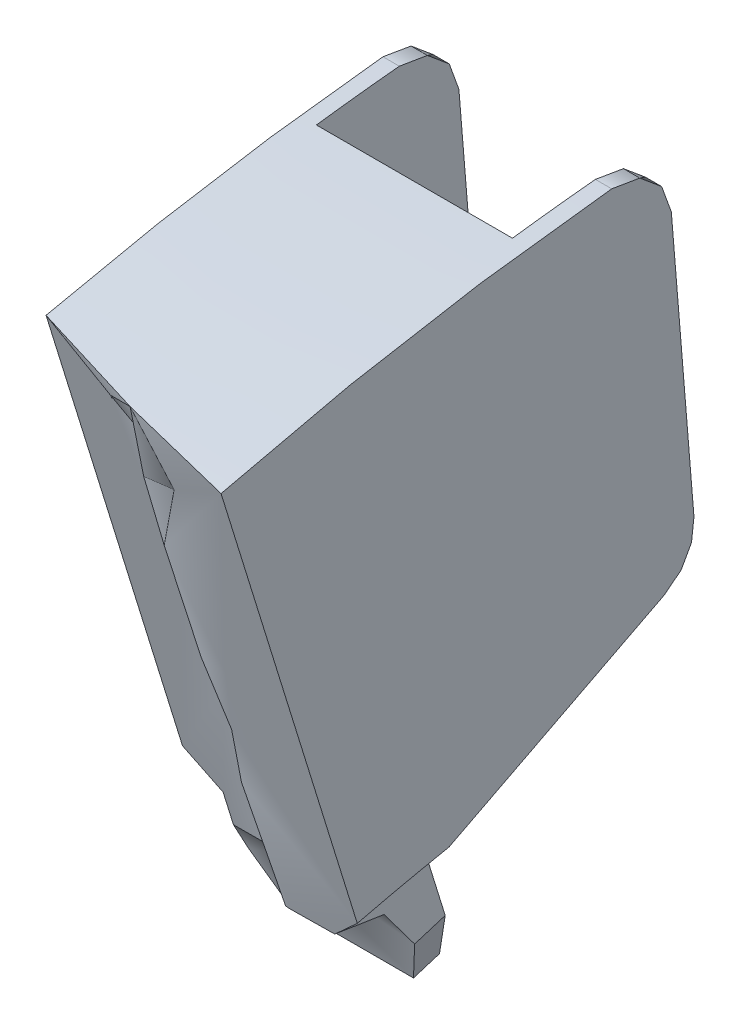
ISO-10303-21;
HEADER;
FILE_DESCRIPTION(('STEP AP214'),'2;1');
FILE_NAME('part.step','',(''),(''),'','','');
FILE_SCHEMA(('AUTOMOTIVE_DESIGN { 1 0 10303 214 1 1 1 1 }'));
ENDSEC;
DATA;
#1=APPLICATION_CONTEXT('core data for automotive mechanical design processes');
#2=APPLICATION_PROTOCOL_DEFINITION('international standard','automotive_design',2000,#1);
#3=PRODUCT_CONTEXT('',#1,'mechanical');
#4=PRODUCT('Part','Part','',(#3));
#5=PRODUCT_RELATED_PRODUCT_CATEGORY('part','',(#4));
#6=PRODUCT_DEFINITION_FORMATION('','',#4);
#7=PRODUCT_DEFINITION_CONTEXT('part definition',#1,'design');
#8=PRODUCT_DEFINITION('design','',#6,#7);
#9=PRODUCT_DEFINITION_SHAPE('','',#8);
#10=(LENGTH_UNIT() NAMED_UNIT(*) SI_UNIT(.MILLI.,.METRE.));
#11=(NAMED_UNIT(*) PLANE_ANGLE_UNIT() SI_UNIT($,.RADIAN.));
#12=(NAMED_UNIT(*) SI_UNIT($,.STERADIAN.) SOLID_ANGLE_UNIT());
#13=UNCERTAINTY_MEASURE_WITH_UNIT(LENGTH_MEASURE(1.E-05),#10,'distance_accuracy_value','');
#14=(GEOMETRIC_REPRESENTATION_CONTEXT(3) GLOBAL_UNCERTAINTY_ASSIGNED_CONTEXT((#13)) GLOBAL_UNIT_ASSIGNED_CONTEXT((#10,
#11,#12)) REPRESENTATION_CONTEXT('',''));
#15=CARTESIAN_POINT('',(0.,0.,0.));
#16=DIRECTION('',(0.,0.,1.));
#17=DIRECTION('',(1.,0.,0.));
#18=AXIS2_PLACEMENT_3D('',#15,#16,#17);
#19=CARTESIAN_POINT('',(-7.63255186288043,37.6761669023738,32.9894004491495));
#20=DIRECTION('',(0.,-0.984219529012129,-0.17695174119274));
#21=DIRECTION('',(0.,0.17695174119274,-0.984219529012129));
#22=AXIS2_PLACEMENT_3D('',#19,#20,#21);
#23=PLANE('',#22);
#24=DIRECTION('',(-0.0473334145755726,-0.176753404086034,0.983116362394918));
#25=VECTOR('',#24,1.);
#26=CARTESIAN_POINT('',(-7.91238107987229,39.4318882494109,23.2239399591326));
#27=LINE('',#26,#25);
#28=CARTESIAN_POINT('',(-7.91238107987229,39.4318882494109,23.2239399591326));
#29=VERTEX_POINT('',#28);
#30=CARTESIAN_POINT('',(-8.26319588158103,38.1218684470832,30.510373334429));
#31=VERTEX_POINT('',#30);
#32=EDGE_CURVE('E665',#29,#31,#27,.T.);
#33=ORIENTED_EDGE('',*,*,#32,.F.);
#34=DIRECTION('',(1.,0.,0.));
#35=VECTOR('',#34,1.);
#36=CARTESIAN_POINT('',(-7.63255186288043,39.4318882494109,23.2239399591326));
#37=LINE('',#36,#35);
#38=CARTESIAN_POINT('',(-7.35272264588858,39.4318882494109,23.2239399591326));
#39=VERTEX_POINT('',#38);
#40=EDGE_CURVE('E672',#29,#39,#37,.T.);
#41=ORIENTED_EDGE('',*,*,#40,.T.);
#42=DIRECTION('',(-0.0473334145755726,0.176753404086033,-0.983116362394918));
#43=VECTOR('',#42,1.);
#44=CARTESIAN_POINT('',(-7.00190784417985,38.1218684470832,30.510373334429));
#45=LINE('',#44,#43);
#46=CARTESIAN_POINT('',(-7.00190784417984,38.1218684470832,30.510373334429));
#47=VERTEX_POINT('',#46);
#48=EDGE_CURVE('E667',#47,#39,#45,.T.);
#49=ORIENTED_EDGE('',*,*,#48,.F.);
#50=DIRECTION('',(1.,0.,0.));
#51=VECTOR('',#50,1.);
#52=CARTESIAN_POINT('',(-7.63255186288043,38.1218684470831,30.510373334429));
#53=LINE('',#52,#51);
#54=EDGE_CURVE('E240',#47,#31,#53,.F.);
#55=ORIENTED_EDGE('',*,*,#54,.T.);
#56=EDGE_LOOP('',(#33,#41,#49,#55));
#57=FACE_BOUND('',#56,.T.);
#58=ADVANCED_FACE('F16',(#57),#23,.T.);
#59=CARTESIAN_POINT('',(-6.50755186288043,41.0197809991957,34.0239268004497));
#60=DIRECTION('',(0.99372170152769,-0.0915539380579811,-0.064304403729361));
#61=DIRECTION('',(0.09174381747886,0.995782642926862,0.));
#62=AXIS2_PLACEMENT_3D('',#59,#60,#61);
#63=PLANE('',#62);
#64=ORIENTED_EDGE('',*,*,#48,.T.);
#65=DIRECTION('',(-0.106533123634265,-0.949881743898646,-0.293896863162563));
#66=VECTOR('',#65,1.);
#67=CARTESIAN_POINT('',(-7.02857728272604,42.3220669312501,24.1181717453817));
#68=LINE('',#67,#66);
#69=CARTESIAN_POINT('',(-7.02857728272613,42.32206693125,24.1181717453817));
#70=VERTEX_POINT('',#69);
#71=EDGE_CURVE('E639',#70,#39,#68,.T.);
#72=ORIENTED_EDGE('',*,*,#71,.F.);
#73=DIRECTION('',(0.0520787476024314,-0.13016911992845,0.990123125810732));
#74=VECTOR('',#73,1.);
#75=CARTESIAN_POINT('',(-6.82045316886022,41.8018675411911,28.0750352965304));
#76=LINE('',#75,#74);
#77=CARTESIAN_POINT('',(-6.63981763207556,41.3503749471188,31.5092849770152));
#78=VERTEX_POINT('',#77);
#79=EDGE_CURVE('E658',#70,#78,#76,.T.);
#80=ORIENTED_EDGE('',*,*,#79,.T.);
#81=DIRECTION('',(-0.106533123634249,-0.949881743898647,-0.293896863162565));
#82=VECTOR('',#81,1.);
#83=CARTESIAN_POINT('',(-6.63981763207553,41.3503749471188,31.5092849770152));
#84=LINE('',#83,#82);
#85=EDGE_CURVE('E650',#78,#47,#84,.T.);
#86=ORIENTED_EDGE('',*,*,#85,.T.);
#87=EDGE_LOOP('',(#64,#72,#80,#86));
#88=FACE_BOUND('',#87,.T.);
#89=ADVANCED_FACE('F681',(#88),#63,.T.);
#90=CARTESIAN_POINT('',(-8.38255186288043,37.6761669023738,32.9894004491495));
#91=DIRECTION('',(-0.99372170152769,-0.0915539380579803,-0.0643044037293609));
#92=DIRECTION('',(0.0917438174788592,-0.995782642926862,0.));
#93=AXIS2_PLACEMENT_3D('',#90,#91,#92);
#94=PLANE('',#93);
#95=DIRECTION('',(0.0520787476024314,0.130169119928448,-0.990123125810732));
#96=VECTOR('',#95,1.);
#97=CARTESIAN_POINT('',(-8.44465055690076,41.8018675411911,28.0750352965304));
#98=LINE('',#97,#96);
#99=CARTESIAN_POINT('',(-8.62528609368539,41.3503749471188,31.5092849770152));
#100=VERTEX_POINT('',#99);
#101=CARTESIAN_POINT('',(-8.23652644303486,42.3220669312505,24.1181717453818));
#102=VERTEX_POINT('',#101);
#103=EDGE_CURVE('E233',#100,#102,#98,.T.);
#104=ORIENTED_EDGE('',*,*,#103,.T.);
#105=DIRECTION('',(-0.106533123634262,0.949881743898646,0.293896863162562));
#106=VECTOR('',#105,1.);
#107=CARTESIAN_POINT('',(-7.91238107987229,39.4318882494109,23.2239399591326));
#108=LINE('',#107,#106);
#109=EDGE_CURVE('E636',#29,#102,#108,.T.);
#110=ORIENTED_EDGE('',*,*,#109,.F.);
#111=ORIENTED_EDGE('',*,*,#32,.T.);
#112=DIRECTION('',(-0.106533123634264,0.949881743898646,0.293896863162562));
#113=VECTOR('',#112,1.);
#114=CARTESIAN_POINT('',(-8.26319588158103,38.1218684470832,30.510373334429));
#115=LINE('',#114,#113);
#116=EDGE_CURVE('E647',#31,#100,#115,.T.);
#117=ORIENTED_EDGE('',*,*,#116,.T.);
#118=EDGE_LOOP('',(#104,#110,#111,#117));
#119=FACE_BOUND('',#118,.T.);
#120=ADVANCED_FACE('F960',(#119),#94,.T.);
#121=CARTESIAN_POINT('',(-2.88053351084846,44.2675644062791,35.5918767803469));
#122=CARTESIAN_POINT('',(-3.78495720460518,44.2055648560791,35.5726091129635));
#123=CARTESIAN_POINT('',(-4.65930341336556,43.8323005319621,35.4566104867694));
#124=CARTESIAN_POINT('',(-5.96152697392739,42.6314760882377,35.083401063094));
#125=CARTESIAN_POINT('',(-6.38269469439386,41.8101364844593,34.828119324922));
#126=CARTESIAN_POINT('',(-6.47932689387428,40.9492336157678,34.5605409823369));
#127=CARTESIAN_POINT('',(-2.92932101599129,46.5839790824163,22.6979873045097));
#128=CARTESIAN_POINT('',(-3.99160704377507,46.5108060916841,22.677311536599));
#129=CARTESIAN_POINT('',(-5.01960303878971,46.0703368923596,22.5528302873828));
#130=CARTESIAN_POINT('',(-6.55242290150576,44.6491845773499,22.1518172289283));
#131=CARTESIAN_POINT('',(-7.04889032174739,43.6754772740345,21.8773368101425));
#132=CARTESIAN_POINT('',(-7.16157944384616,42.6545014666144,21.5895296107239));
#133=B_SPLINE_SURFACE_WITH_KNOTS('',1,3,((#121,#122,#123,#124,#125,#126),(#127,#128,#129,#130,
#131,#132)),.UNSPECIFIED.,.F.,.F.,.F.,(2,2),(4,2,4),(0.,1.),(0.,0.5,1.),.UNSPECIFIED.);
#134=CARTESIAN_POINT('',(-3.79247744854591,44.6463064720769,32.5290581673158));
#135=CARTESIAN_POINT('',(-3.9019338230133,44.6139716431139,32.519053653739));
#136=CARTESIAN_POINT('',(-4.0099696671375,44.5772605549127,32.5076951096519));
#137=CARTESIAN_POINT('',(-4.22248911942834,44.4953915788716,32.4823645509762));
#138=CARTESIAN_POINT('',(-4.32697235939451,44.450232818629,32.468392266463));
#139=CARTESIAN_POINT('',(-4.53153888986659,44.3518356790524,32.4379478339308));
#140=CARTESIAN_POINT('',(-4.6316269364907,44.298606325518,32.4214784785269));
#141=CARTESIAN_POINT('',(-4.82679450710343,44.1843422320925,32.3861247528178));
#142=CARTESIAN_POINT('',(-4.92187417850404,44.1233077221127,32.367240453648));
#143=CARTESIAN_POINT('',(-5.10645967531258,43.9936482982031,32.3271233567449));
#144=CARTESIAN_POINT('',(-5.1959549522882,43.9250096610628,32.3058863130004));
#145=CARTESIAN_POINT('',(-5.36837314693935,43.7805751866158,32.2611977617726));
#146=CARTESIAN_POINT('',(-5.45129637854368,43.7047796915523,32.2377463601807));
#147=CARTESIAN_POINT('',(-5.60992904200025,43.5465800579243,32.1887988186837));
#148=CARTESIAN_POINT('',(-5.68563829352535,43.4641757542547,32.1633026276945));
#149=CARTESIAN_POINT('',(-5.82944846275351,43.2935472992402,32.1105095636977));
#150=CARTESIAN_POINT('',(-5.89754900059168,43.2053228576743,32.0832126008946));
#151=CARTESIAN_POINT('',(-6.08752274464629,42.936270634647,31.9999668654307));
#152=CARTESIAN_POINT('',(-6.19809953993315,42.748007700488,31.9417176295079));
#153=CARTESIAN_POINT('',(-6.38572348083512,42.3570004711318,31.8207385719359));
#154=CARTESIAN_POINT('',(-6.462800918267,42.1542694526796,31.7580128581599));
#155=CARTESIAN_POINT('',(-6.5497251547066,41.8491609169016,31.6636111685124));
#156=CARTESIAN_POINT('',(-6.57358541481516,41.7502856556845,31.6330188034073));
#157=CARTESIAN_POINT('',(-6.6129770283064,41.5512263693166,31.5714291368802));
#158=CARTESIAN_POINT('',(-6.62852392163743,41.4510451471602,31.5404327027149));
#159=CARTESIAN_POINT('',(-6.63981763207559,41.3503749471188,31.5092849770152));
#160=B_SPLINE_CURVE_WITH_KNOTS('',3,(#134,#135,#136,#137,#138,#139,#140,#141,#142,#143,#144,
#145,#146,#147,#148,#149,#150,#151,#152,#153,#154,#155,#156,#157,#158,#159),.UNSPECIFIED.,.F.,
.F.,(4,2,2,2,2,2,2,2,2,2,2,2,4),(0.,0.343605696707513,0.687246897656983,1.03050658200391,
1.37375615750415,1.71763561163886,2.06149862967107,2.40537024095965,2.74925901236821,
3.42397983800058,4.09808927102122,4.4164424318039,4.7341984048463),.UNSPECIFIED.);
#161=CARTESIAN_POINT('',(-3.79247744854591,44.6463064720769,32.5290581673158));
#162=VERTEX_POINT('',#161);
#163=EDGE_CURVE('E690',#162,#78,#160,.T.);
#164=CARTESIAN_POINT('',(-3.48116693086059,46.043881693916,25.2697147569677));
#165=CARTESIAN_POINT('',(-3.60503561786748,46.0196715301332,25.2622240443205));
#166=CARTESIAN_POINT('',(-3.72773208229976,45.9904340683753,25.2531778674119));
#167=CARTESIAN_POINT('',(-3.97015424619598,45.9221656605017,25.2320553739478));
#168=CARTESIAN_POINT('',(-4.08987880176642,45.883131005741,25.219977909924));
#169=CARTESIAN_POINT('',(-4.44329942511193,45.7518365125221,25.1793549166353));
#170=CARTESIAN_POINT('',(-4.67147091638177,45.6453409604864,25.1464048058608));
#171=CARTESIAN_POINT('',(-4.99710177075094,45.4595107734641,25.088908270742));
#172=CARTESIAN_POINT('',(-5.10296709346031,45.393143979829,25.0683741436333));
#173=CARTESIAN_POINT('',(-5.30843133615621,45.2520167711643,25.0247088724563));
#174=CARTESIAN_POINT('',(-5.40803074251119,45.1772570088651,25.0015779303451));
#175=CARTESIAN_POINT('',(-5.59997911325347,45.0197920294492,24.9528576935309));
#176=CARTESIAN_POINT('',(-5.69233246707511,44.9370916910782,24.9272699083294));
#177=CARTESIAN_POINT('',(-5.86909118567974,44.7642731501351,24.8737992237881));
#178=CARTESIAN_POINT('',(-5.95349645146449,44.6741548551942,24.8459162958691));
#179=CARTESIAN_POINT('',(-6.11208073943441,44.4895099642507,24.7887864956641));
#180=CARTESIAN_POINT('',(-6.18645075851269,44.3951330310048,24.7595859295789));
#181=CARTESIAN_POINT('',(-6.32679181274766,44.200878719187,24.6994829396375));
#182=CARTESIAN_POINT('',(-6.39276243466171,44.1010010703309,24.6685804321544));
#183=CARTESIAN_POINT('',(-6.57755500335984,43.7941082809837,24.5736266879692));
#184=CARTESIAN_POINT('',(-6.6833585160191,43.57971521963,24.5072926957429));
#185=CARTESIAN_POINT('',(-6.8357037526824,43.1917287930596,24.3872482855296));
#186=CARTESIAN_POINT('',(-6.8904116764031,43.0209904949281,24.3344212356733));
#187=CARTESIAN_POINT('',(-6.97689540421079,42.6746507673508,24.2272624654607));
#188=CARTESIAN_POINT('',(-7.00871498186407,42.4990592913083,24.1729338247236));
#189=CARTESIAN_POINT('',(-7.02857728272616,42.32206693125,24.1181717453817));
#190=B_SPLINE_CURVE_WITH_KNOTS('',3,(#164,#165,#166,#167,#168,#169,#170,#171,#172,#173,#174,
#175,#176,#177,#178,#179,#180,#181,#182,#183,#184,#185,#186,#187,#188,#189),.UNSPECIFIED.,.F.,
.F.,(4,2,2,2,2,2,2,2,2,2,2,2,4),(0.,0.379006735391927,0.758157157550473,1.51576644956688,
1.89529385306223,2.27479176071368,2.65405797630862,3.03332891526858,3.40385007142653,
3.77438944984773,4.51499515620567,5.07435956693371,5.63265133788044),.UNSPECIFIED.);
#191=CARTESIAN_POINT('',(-3.48116693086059,46.043881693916,25.2697147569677));
#192=VERTEX_POINT('',#191);
#193=EDGE_CURVE('E644',#192,#70,#190,.T.);
#194=CARTESIAN_POINT('',(-3.48116693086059,46.043881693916,25.2697147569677));
#195=CARTESIAN_POINT('',(-3.44855476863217,45.9666037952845,25.7341197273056));
#196=CARTESIAN_POINT('',(-3.4166712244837,45.8889028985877,26.1985048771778));
#197=CARTESIAN_POINT('',(-3.35423871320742,45.7327308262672,27.1272340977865));
#198=CARTESIAN_POINT('',(-3.32368974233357,45.6542596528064,27.5915781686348));
#199=CARTESIAN_POINT('',(-3.25610787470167,45.4763651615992,28.6395621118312));
#200=CARTESIAN_POINT('',(-3.21942642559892,45.3767402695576,29.2231904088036));
#201=CARTESIAN_POINT('',(-3.14778952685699,45.1765054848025,30.3903850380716));
#202=CARTESIAN_POINT('',(-3.11283408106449,45.0758955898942,30.9739513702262));
#203=CARTESIAN_POINT('',(-3.0444913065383,44.8737784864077,32.1410448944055));
#204=CARTESIAN_POINT('',(-3.01110404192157,44.7722712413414,32.7245720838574));
#205=CARTESIAN_POINT('',(-2.94577497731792,44.568433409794,33.8915610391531));
#206=CARTESIAN_POINT('',(-2.91383317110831,44.4661028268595,34.4750228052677));
#207=CARTESIAN_POINT('',(-2.88255186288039,44.363395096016,35.0584531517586));
#208=B_SPLINE_CURVE_WITH_KNOTS('',3,(#194,#195,#196,#197,#198,#199,#200,#201,#202,#203,#204,
#205,#206,#207),.UNSPECIFIED.,.F.,.F.,(4,2,2,2,2,2,4),(0.,1.41575491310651,2.83150585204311,
4.61111824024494,6.3907345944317,8.17042364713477,9.95010503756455),.UNSPECIFIED.);
#209=CARTESIAN_POINT('',(-2.88255186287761,44.3633950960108,35.058453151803));
#210=VERTEX_POINT('',#209);
#211=EDGE_CURVE('E824',#192,#210,#208,.T.);
#212=CARTESIAN_POINT('',(-3.79247744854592,44.6463064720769,32.5290581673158));
#213=CARTESIAN_POINT('',(-3.74228056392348,44.6362262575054,32.6703046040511));
#214=CARTESIAN_POINT('',(-3.69201473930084,44.6252102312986,32.8114597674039));
#215=CARTESIAN_POINT('',(-3.59136919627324,44.6013105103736,33.0935197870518));
#216=CARTESIAN_POINT('',(-3.5409895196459,44.5884274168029,33.2344247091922));
#217=CARTESIAN_POINT('',(-3.44011623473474,44.56079329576,33.5159842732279));
#218=CARTESIAN_POINT('',(-3.38962264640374,44.5460425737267,33.656638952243));
#219=CARTESIAN_POINT('',(-3.28852029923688,44.5146601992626,33.9376975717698));
#220=CARTESIAN_POINT('',(-3.23791153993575,44.4980285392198,34.0781015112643));
#221=CARTESIAN_POINT('',(-3.13657787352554,44.4628626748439,34.3586547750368));
#222=CARTESIAN_POINT('',(-3.08585294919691,44.4443281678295,34.4988040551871));
#223=CARTESIAN_POINT('',(-2.98428511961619,44.4053217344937,34.7788424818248));
#224=CARTESIAN_POINT('',(-2.93344218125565,44.3848491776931,34.9187315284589));
#225=CARTESIAN_POINT('',(-2.88255186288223,44.3633950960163,35.0584531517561));
#226=B_SPLINE_CURVE_WITH_KNOTS('',3,(#212,#213,#214,#215,#216,#217,#218,#219,#220,#221,#222,
#223,#224,#225),.UNSPECIFIED.,.F.,.F.,(4,2,2,2,2,2,4),(0.,0.450715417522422,0.901286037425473,
1.35178306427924,1.80228191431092,2.25285253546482,2.70357024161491),.UNSPECIFIED.);
#227=EDGE_CURVE('E819',#162,#210,#226,.T.);
#228=ORIENTED_EDGE('',*,*,#163,.T.);
#229=ORIENTED_EDGE('',*,*,#79,.F.);
#230=ORIENTED_EDGE('',*,*,#193,.F.);
#231=ORIENTED_EDGE('',*,*,#211,.T.);
#232=ORIENTED_EDGE('',*,*,#227,.F.);
#233=EDGE_LOOP('',(#228,#229,#230,#231,#232));
#234=FACE_BOUND('',#233,.T.);
#235=ADVANCED_FACE('F709',(#234),#133,.F.);
#236=CARTESIAN_POINT('',(-8.7857768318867,40.9492336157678,34.560540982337));
#237=CARTESIAN_POINT('',(-8.88240903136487,41.8101364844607,34.8281193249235));
#238=CARTESIAN_POINT('',(-9.30357675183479,42.6314760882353,35.0834010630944));
#239=CARTESIAN_POINT('',(-10.6058003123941,43.8323005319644,35.4566104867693));
#240=CARTESIAN_POINT('',(-11.4801465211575,44.2055648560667,35.5726091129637));
#241=CARTESIAN_POINT('',(-12.3845702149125,44.2675644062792,35.5918767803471));
#242=CARTESIAN_POINT('',(-8.10352428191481,42.6545014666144,21.5895296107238));
#243=CARTESIAN_POINT('',(-8.2162134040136,43.6754772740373,21.8773368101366));
#244=CARTESIAN_POINT('',(-8.71268082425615,44.6491845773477,22.15181722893));
#245=CARTESIAN_POINT('',(-10.2455006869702,46.0703368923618,22.5528302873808));
#246=CARTESIAN_POINT('',(-11.2734966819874,46.5108060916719,22.677311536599));
#247=CARTESIAN_POINT('',(-12.3357827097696,46.5839790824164,22.6979873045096));
#248=B_SPLINE_SURFACE_WITH_KNOTS('',1,3,((#236,#237,#238,#239,#240,#241),(#242,#243,#244,#245,
#246,#247)),.UNSPECIFIED.,.F.,.F.,.F.,(2,2),(4,2,4),(0.,1.),(0.,0.5,1.),.UNSPECIFIED.);
#249=CARTESIAN_POINT('',(-12.3825518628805,44.3633950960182,35.058453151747));
#250=CARTESIAN_POINT('',(-12.3566308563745,44.4485088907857,34.5749707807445));
#251=CARTESIAN_POINT('',(-12.3302544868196,44.533362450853,34.0914668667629));
#252=CARTESIAN_POINT('',(-12.276523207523,44.7025119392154,33.1244142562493));
#253=CARTESIAN_POINT('',(-12.2491682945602,44.7868078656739,32.6408655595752));
#254=CARTESIAN_POINT('',(-12.1882087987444,44.970482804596,31.5834654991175));
#255=CARTESIAN_POINT('',(-12.1543907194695,45.0697403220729,31.0096052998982));
#256=CARTESIAN_POINT('',(-12.0851422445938,45.2673363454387,29.8618248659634));
#257=CARTESIAN_POINT('',(-12.049711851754,45.3656748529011,29.2879046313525));
#258=CARTESIAN_POINT('',(-11.9770729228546,45.5613401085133,28.1399760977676));
#259=CARTESIAN_POINT('',(-11.9398643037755,45.6586668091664,27.5659677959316));
#260=CARTESIAN_POINT('',(-11.8634516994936,45.8521702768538,26.4178880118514));
#261=CARTESIAN_POINT('',(-11.8242477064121,45.9483470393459,25.8438165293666));
#262=CARTESIAN_POINT('',(-11.7839367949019,46.0438816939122,25.2697147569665));
#263=B_SPLINE_CURVE_WITH_KNOTS('',3,(#249,#250,#251,#252,#253,#254,#255,#256,#257,#258,#259,
#260,#261,#262),.UNSPECIFIED.,.F.,.F.,(4,2,2,2,2,2,4),(0.,1.47480264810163,2.94961015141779,
4.69969342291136,6.44977369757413,8.19993575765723,9.9501047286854),.UNSPECIFIED.);
#264=CARTESIAN_POINT('',(-12.3825518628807,44.3633950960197,35.0584531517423));
#265=VERTEX_POINT('',#264);
#266=CARTESIAN_POINT('',(-11.7839367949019,46.0438816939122,25.2697147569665));
#267=VERTEX_POINT('',#266);
#268=EDGE_CURVE('E740',#265,#267,#263,.T.);
#269=CARTESIAN_POINT('',(-8.23652644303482,42.32206693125,24.1181717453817));
#270=CARTESIAN_POINT('',(-8.26339826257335,42.5619093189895,24.1923798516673));
#271=CARTESIAN_POINT('',(-8.31232453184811,42.7992608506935,24.2658172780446));
#272=CARTESIAN_POINT('',(-8.45087982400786,43.2618412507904,24.4089413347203));
#273=CARTESIAN_POINT('',(-8.54034113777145,43.4871158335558,24.4786421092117));
#274=CARTESIAN_POINT('',(-8.75704081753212,43.9208862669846,24.6128522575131));
#275=CARTESIAN_POINT('',(-8.88435156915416,44.1293489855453,24.67735138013));
#276=CARTESIAN_POINT('',(-9.17366218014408,44.5230006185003,24.7991486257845));
#277=CARTESIAN_POINT('',(-9.33563031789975,44.7082105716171,24.8564532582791));
#278=CARTESIAN_POINT('',(-9.60179007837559,44.9635901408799,24.9354686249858));
#279=CARTESIAN_POINT('',(-9.69440736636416,45.04499725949,24.9606562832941));
#280=CARTESIAN_POINT('',(-9.88663708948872,45.199890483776,25.0085808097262));
#281=CARTESIAN_POINT('',(-9.98625031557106,45.2733756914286,25.0313173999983));
#282=CARTESIAN_POINT('',(-10.2943904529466,45.4813758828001,25.0956734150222));
#283=CARTESIAN_POINT('',(-10.5123122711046,45.6035253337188,25.1334668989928));
#284=CARTESIAN_POINT('',(-10.9054671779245,45.783793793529,25.1892426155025));
#285=CARTESIAN_POINT('',(-11.0765917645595,45.8503014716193,25.2098203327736));
#286=CARTESIAN_POINT('',(-11.4256564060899,45.9626936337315,25.2445948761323));
#287=CARTESIAN_POINT('',(-11.6035795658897,46.0086260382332,25.2588065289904));
#288=CARTESIAN_POINT('',(-11.7839367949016,46.0438816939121,25.2697147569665));
#289=B_SPLINE_CURVE_WITH_KNOTS('',3,(#269,#270,#271,#272,#273,#274,#275,#276,#277,#278,#279,
#280,#281,#282,#283,#284,#285,#286,#287,#288),.UNSPECIFIED.,.F.,.F.,(4,2,2,2,2,2,2,2,2,4),(0.,
0.756193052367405,1.50928561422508,2.2638278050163,3.01768230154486,3.39482266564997,
3.77200573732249,4.5259769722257,5.07893535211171,5.63059909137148),.UNSPECIFIED.);
#290=EDGE_CURVE('E638',#102,#267,#289,.T.);
#291=CARTESIAN_POINT('',(-8.62528609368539,41.3503749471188,31.5092849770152));
#292=CARTESIAN_POINT('',(-8.6497079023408,41.5683711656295,31.5767337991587));
#293=CARTESIAN_POINT('',(-8.69415423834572,41.7841086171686,31.6434837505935));
#294=CARTESIAN_POINT('',(-8.82030058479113,42.2055896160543,31.7738915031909));
#295=CARTESIAN_POINT('',(-8.90202512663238,42.4113264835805,31.8375472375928));
#296=CARTESIAN_POINT('',(-9.09983101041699,42.8069041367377,31.9599404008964));
#297=CARTESIAN_POINT('',(-9.2158908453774,42.9967547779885,32.0186808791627));
#298=CARTESIAN_POINT('',(-9.47963960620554,43.3552853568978,32.1296115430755));
#299=CARTESIAN_POINT('',(-9.62730829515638,43.5239787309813,32.1818058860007));
#300=CARTESIAN_POINT('',(-9.86994008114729,43.7565832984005,32.2537745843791));
#301=CARTESIAN_POINT('',(-9.95436704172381,43.8307312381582,32.2767162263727));
#302=CARTESIAN_POINT('',(-10.1295881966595,43.9718130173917,32.3203674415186));
#303=CARTESIAN_POINT('',(-10.2203835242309,44.0387455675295,32.3410766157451));
#304=CARTESIAN_POINT('',(-10.5010993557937,44.2281066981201,32.3996656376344));
#305=CARTESIAN_POINT('',(-10.6995822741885,44.3393199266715,32.4340754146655));
#306=CARTESIAN_POINT('',(-10.9976908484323,44.4760360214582,32.4763758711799));
#307=CARTESIAN_POINT('',(-11.0909446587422,44.5148206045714,32.4883759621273));
#308=CARTESIAN_POINT('',(-11.2799560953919,44.5856257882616,32.5102833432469));
#309=CARTESIAN_POINT('',(-11.3757068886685,44.6176630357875,32.5201957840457));
#310=CARTESIAN_POINT('',(-11.472626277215,44.646306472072,32.5290581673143));
#311=B_SPLINE_CURVE_WITH_KNOTS('',3,(#291,#292,#293,#294,#295,#296,#297,#298,#299,#300,#301,
#302,#303,#304,#305,#306,#307,#308,#309,#310),.UNSPECIFIED.,.F.,.F.,(4,2,2,2,2,2,2,2,2,4),(0.,
0.687323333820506,1.37509962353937,2.06244601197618,2.74935365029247,3.09301183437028,
3.43673132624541,4.12319793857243,4.4281115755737,4.73226388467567),.UNSPECIFIED.);
#312=CARTESIAN_POINT('',(-11.472626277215,44.646306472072,32.5290581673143));
#313=VERTEX_POINT('',#312);
#314=EDGE_CURVE('E23',#100,#313,#311,.T.);
#315=CARTESIAN_POINT('',(-12.3825518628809,44.3633950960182,35.0584531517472));
#316=CARTESIAN_POINT('',(-12.3316615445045,44.3848491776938,34.9187315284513));
#317=CARTESIAN_POINT('',(-12.2808186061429,44.4053217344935,34.7788424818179));
#318=CARTESIAN_POINT('',(-12.1792507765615,44.444328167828,34.498804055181));
#319=CARTESIAN_POINT('',(-12.1285258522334,44.462862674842,34.3586547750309));
#320=CARTESIAN_POINT('',(-12.0271921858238,44.498028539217,34.078101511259));
#321=CARTESIAN_POINT('',(-11.9765834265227,44.5146601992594,33.9376975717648));
#322=CARTESIAN_POINT('',(-11.875481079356,44.5460425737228,33.6566389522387));
#323=CARTESIAN_POINT('',(-11.8249874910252,44.5607932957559,33.5159842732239));
#324=CARTESIAN_POINT('',(-11.7241142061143,44.5884274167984,33.2344247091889));
#325=CARTESIAN_POINT('',(-11.6737345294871,44.601310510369,33.0935197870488));
#326=CARTESIAN_POINT('',(-11.5730889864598,44.6252102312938,32.8114597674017));
#327=CARTESIAN_POINT('',(-11.5228231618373,44.6362262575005,32.6703046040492));
#328=CARTESIAN_POINT('',(-11.472626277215,44.646306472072,32.5290581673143));
#329=B_SPLINE_CURVE_WITH_KNOTS('',3,(#315,#316,#317,#318,#319,#320,#321,#322,#323,#324,#325,
#326,#327,#328),.UNSPECIFIED.,.F.,.F.,(4,2,2,2,2,2,4),(0.,0.450717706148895,0.901288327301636,
1.35178717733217,1.80228420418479,2.25285482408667,2.70357024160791),.UNSPECIFIED.);
#330=EDGE_CURVE('E778',#265,#313,#329,.T.);
#331=ORIENTED_EDGE('',*,*,#268,.T.);
#332=ORIENTED_EDGE('',*,*,#290,.F.);
#333=ORIENTED_EDGE('',*,*,#103,.F.);
#334=ORIENTED_EDGE('',*,*,#314,.T.);
#335=ORIENTED_EDGE('',*,*,#330,.F.);
#336=EDGE_LOOP('',(#331,#332,#333,#334,#335));
#337=FACE_BOUND('',#336,.T.);
#338=ADVANCED_FACE('F750',(#337),#248,.F.);
#339=CARTESIAN_POINT('',(-10.3825518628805,45.1023424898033,32.6701573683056));
#340=DIRECTION('',(0.,-0.29557895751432,0.955318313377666));
#341=DIRECTION('',(0.,-0.955318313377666,-0.29557895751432));
#342=AXIS2_PLACEMENT_3D('',#339,#340,#341);
#343=PLANE('',#342);
#344=DIRECTION('',(0.,0.955318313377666,0.29557895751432));
#345=VECTOR('',#344,1.);
#346=CARTESIAN_POINT('',(-3.79247744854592,7.84492826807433,21.1425780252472));
#347=LINE('',#346,#345);
#348=CARTESIAN_POINT('',(-3.79247744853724,7.84492826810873,21.1425780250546));
#349=VERTEX_POINT('',#348);
#350=EDGE_CURVE('E822',#349,#162,#347,.T.);
#351=ORIENTED_EDGE('',*,*,#350,.F.);
#352=CARTESIAN_POINT('',(-4.88255186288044,7.84492826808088,21.1425780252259));
#353=DIRECTION('',(0.,-0.295578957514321,0.955318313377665));
#354=DIRECTION('',(0.,-0.955318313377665,-0.295578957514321));
#355=AXIS2_PLACEMENT_3D('',#352,#353,#354);
#356=CIRCLE('',#355,1.09007441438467);
#357=CARTESIAN_POINT('',(-4.88255186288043,6.80356021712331,20.8203749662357));
#358=VERTEX_POINT('',#357);
#359=EDGE_CURVE('E812',#358,#349,#356,.T.);
#360=ORIENTED_EDGE('',*,*,#359,.F.);
#361=DIRECTION('',(1.,0.,0.));
#362=VECTOR('',#361,1.);
#363=CARTESIAN_POINT('',(-10.3825518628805,6.80356021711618,20.8203749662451));
#364=LINE('',#363,#362);
#365=CARTESIAN_POINT('',(-10.3825518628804,6.80356021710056,20.820374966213));
#366=VERTEX_POINT('',#365);
#367=EDGE_CURVE('E659',#366,#358,#364,.T.);
#368=ORIENTED_EDGE('',*,*,#367,.F.);
#369=CARTESIAN_POINT('',(-10.3825518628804,7.84492826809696,21.1425780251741));
#370=DIRECTION('',(0.,-0.295578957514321,0.955318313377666));
#371=DIRECTION('',(0.,-0.955318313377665,-0.295578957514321));
#372=AXIS2_PLACEMENT_3D('',#369,#370,#371);
#373=CIRCLE('',#372,1.0900744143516);
#374=CARTESIAN_POINT('',(-11.472626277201,7.8449282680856,21.1425780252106));
#375=VERTEX_POINT('',#374);
#376=EDGE_CURVE('E933',#375,#366,#373,.T.);
#377=ORIENTED_EDGE('',*,*,#376,.F.);
#378=DIRECTION('',(0.,-0.955318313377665,-0.295578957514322));
#379=VECTOR('',#378,1.);
#380=CARTESIAN_POINT('',(-11.472626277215,44.646306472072,32.5290581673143));
#381=LINE('',#380,#379);
#382=EDGE_CURVE('E953',#313,#375,#381,.T.);
#383=ORIENTED_EDGE('',*,*,#382,.F.);
#384=ORIENTED_EDGE('',*,*,#314,.F.);
#385=ORIENTED_EDGE('',*,*,#116,.F.);
#386=ORIENTED_EDGE('',*,*,#54,.F.);
#387=ORIENTED_EDGE('',*,*,#85,.F.);
#388=ORIENTED_EDGE('',*,*,#163,.F.);
#389=EDGE_LOOP('',(#351,#360,#368,#377,#383,#384,#385,#386,#387,#388));
#390=FACE_BOUND('',#389,.T.);
#391=ADVANCED_FACE('F718',(#390),#343,.F.);
#392=CARTESIAN_POINT('',(-4.88255186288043,45.6153867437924,25.1371368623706));
#393=DIRECTION('',(0.,0.29557895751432,-0.955318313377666));
#394=DIRECTION('',(0.,0.955318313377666,0.29557895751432));
#395=AXIS2_PLACEMENT_3D('',#392,#393,#394);
#396=PLANE('',#395);
#397=ORIENTED_EDGE('',*,*,#290,.T.);
#398=CARTESIAN_POINT('',(-11.7839367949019,46.0438816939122,25.2697147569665));
#399=CARTESIAN_POINT('',(-11.7705433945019,46.0819232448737,25.2814849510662));
#400=CARTESIAN_POINT('',(-11.7554219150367,46.1193852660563,25.2930758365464));
#401=CARTESIAN_POINT('',(-11.7218754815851,46.1929230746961,25.3158287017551));
#402=CARTESIAN_POINT('',(-11.7034514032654,46.228999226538,25.3269907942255));
#403=CARTESIAN_POINT('',(-11.6435090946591,46.3347199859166,25.3597011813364));
#404=CARTESIAN_POINT('',(-11.5972749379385,46.4019857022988,25.3805134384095));
#405=CARTESIAN_POINT('',(-11.4938551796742,46.528192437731,25.4195622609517));
#406=CARTESIAN_POINT('',(-11.4366769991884,46.5871390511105,25.4378005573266));
#407=CARTESIAN_POINT('',(-11.3129089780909,46.6952414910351,25.4712478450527));
#408=CARTESIAN_POINT('',(-11.2463175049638,46.7443956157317,25.486456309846));
#409=CARTESIAN_POINT('',(-11.1043663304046,46.8320840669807,25.5135874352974));
#410=CARTESIAN_POINT('',(-11.0288852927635,46.8704393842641,25.5254547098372));
#411=CARTESIAN_POINT('',(-10.8721263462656,46.9340674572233,25.5451414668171));
#412=CARTESIAN_POINT('',(-10.7908533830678,46.9593512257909,25.5529643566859));
#413=CARTESIAN_POINT('',(-10.6546050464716,46.9893509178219,25.5622463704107));
#414=CARTESIAN_POINT('',(-10.6005865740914,46.9981861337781,25.5649800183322));
#415=CARTESIAN_POINT('',(-10.4919033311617,47.0099658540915,25.5686247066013));
#416=CARTESIAN_POINT('',(-10.4372392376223,47.0129160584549,25.5695375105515));
#417=CARTESIAN_POINT('',(-10.3825518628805,47.0128970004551,25.569531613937));
#418=B_SPLINE_CURVE_WITH_KNOTS('',3,(#398,#399,#400,#401,#402,#403,#404,#405,#406,#407,#408,
#409,#410,#411,#412,#413,#414,#415,#416,#417),.UNSPECIFIED.,.F.,.F.,(4,2,2,2,2,2,2,2,2,4),(0.,
0.125953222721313,0.251873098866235,0.503291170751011,0.754539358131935,1.00583117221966,
1.2610716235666,1.5160966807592,1.6801825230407,1.84410936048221),.UNSPECIFIED.);
#419=CARTESIAN_POINT('',(-10.3825518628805,47.0128970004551,25.5695316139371));
#420=VERTEX_POINT('',#419);
#421=EDGE_CURVE('E734',#267,#420,#418,.T.);
#422=ORIENTED_EDGE('',*,*,#421,.T.);
#423=DIRECTION('',(1.,0.,0.));
#424=VECTOR('',#423,1.);
#425=CARTESIAN_POINT('',(-10.3825518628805,47.0128970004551,25.5695316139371));
#426=LINE('',#425,#424);
#427=CARTESIAN_POINT('',(-4.88255186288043,47.0128970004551,25.5695316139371));
#428=VERTEX_POINT('',#427);
#429=EDGE_CURVE('E632',#428,#420,#426,.F.);
#430=ORIENTED_EDGE('',*,*,#429,.F.);
#431=CARTESIAN_POINT('',(-4.88255186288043,47.0128970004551,25.5695316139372));
#432=CARTESIAN_POINT('',(-4.84147089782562,47.0129051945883,25.5695341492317));
#433=CARTESIAN_POINT('',(-4.80039003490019,47.0112437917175,25.5690201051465));
#434=CARTESIAN_POINT('',(-4.71852803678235,47.0045982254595,25.5669639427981));
#435=CARTESIAN_POINT('',(-4.6777468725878,46.9996143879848,25.5654219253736));
#436=CARTESIAN_POINT('',(-4.59686546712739,46.9863551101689,25.5613194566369));
#437=CARTESIAN_POINT('',(-4.5567639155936,46.9780869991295,25.5587612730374));
#438=CARTESIAN_POINT('',(-4.4774492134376,46.9583388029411,25.5526511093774));
#439=CARTESIAN_POINT('',(-4.43823605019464,46.9468587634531,25.5490991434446));
#440=CARTESIAN_POINT('',(-4.32233188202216,46.9077383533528,25.5369951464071));
#441=CARTESIAN_POINT('',(-4.2473133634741,46.8754072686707,25.5269917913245));
#442=CARTESIAN_POINT('',(-4.10388409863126,46.7993996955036,25.5034747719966));
#443=CARTESIAN_POINT('',(-4.03547679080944,46.7557173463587,25.489959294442));
#444=CARTESIAN_POINT('',(-3.90576307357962,46.657446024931,25.4595537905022));
#445=CARTESIAN_POINT('',(-3.84461263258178,46.602669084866,25.4426056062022));
#446=CARTESIAN_POINT('',(-3.73258441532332,46.4842774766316,25.405974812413));
#447=CARTESIAN_POINT('',(-3.6817006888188,46.420667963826,25.3862937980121));
#448=CARTESIAN_POINT('',(-3.60433289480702,46.3051215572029,25.3505433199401));
#449=CARTESIAN_POINT('',(-3.57500596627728,46.2549019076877,25.3350051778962));
#450=CARTESIAN_POINT('',(-3.52299512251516,46.1514748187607,25.3030044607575));
#451=CARTESIAN_POINT('',(-3.50030521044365,46.0982701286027,25.2865427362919));
#452=CARTESIAN_POINT('',(-3.48116693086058,46.043881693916,25.2697147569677));
#453=B_SPLINE_CURVE_WITH_KNOTS('',3,(#431,#432,#433,#434,#435,#436,#437,#438,#439,#440,#441,
#442,#443,#444,#445,#446,#447,#448,#449,#450,#451,#452),.UNSPECIFIED.,.F.,.F.,(4,2,2,2,2,2,2,2,
2,2,4),(0.,0.123204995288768,0.2463979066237,0.369317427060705,0.492235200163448,
0.737881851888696,0.983655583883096,1.23400645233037,1.48421180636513,1.66437437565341,
1.84437365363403),.UNSPECIFIED.);
#454=EDGE_CURVE('E686',#428,#192,#453,.T.);
#455=ORIENTED_EDGE('',*,*,#454,.T.);
#456=ORIENTED_EDGE('',*,*,#193,.T.);
#457=ORIENTED_EDGE('',*,*,#71,.T.);
#458=ORIENTED_EDGE('',*,*,#40,.F.);
#459=ORIENTED_EDGE('',*,*,#109,.T.);
#460=EDGE_LOOP('',(#397,#422,#430,#455,#456,#457,#458,#459));
#461=FACE_BOUND('',#460,.T.);
#462=ADVANCED_FACE('F683',(#461),#396,.T.);
#463=CARTESIAN_POINT('',(-12.3945347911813,44.3348772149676,35.2853255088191));
#464=CARTESIAN_POINT('',(-12.3944735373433,45.3822513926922,35.6081820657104));
#465=CARTESIAN_POINT('',(-11.4782707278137,46.2572931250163,35.877969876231));
#466=CARTESIAN_POINT('',(-10.3825518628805,46.2572931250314,35.8779698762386));
#467=CARTESIAN_POINT('',(-11.741702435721,45.8885371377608,22.9252736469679));
#468=CARTESIAN_POINT('',(-11.7449660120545,46.5750582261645,23.2018780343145));
#469=CARTESIAN_POINT('',(-11.135421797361,47.1692153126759,23.4369357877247));
#470=CARTESIAN_POINT('',(-10.3825518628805,47.1692153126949,23.4369357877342));
#471=B_SPLINE_SURFACE_WITH_KNOTS('',1,3,((#463,#464,#465,#466),(#467,#468,#469,#470)),
.UNSPECIFIED.,.F.,.F.,.F.,(2,2),(4,4),(0.,1.),(0.,1.),.UNSPECIFIED.);
#472=DIRECTION('',(0.,-0.0731034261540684,0.997324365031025));
#473=VECTOR('',#472,1.);
#474=CARTESIAN_POINT('',(-10.3825518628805,46.2740317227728,35.6496110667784));
#475=LINE('',#474,#473);
#476=CARTESIAN_POINT('',(-10.3825518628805,46.2740317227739,35.6496110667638));
#477=VERTEX_POINT('',#476);
#478=EDGE_CURVE('E634',#420,#477,#475,.T.);
#479=CARTESIAN_POINT('',(-10.3825518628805,46.274031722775,35.6496110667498));
#480=CARTESIAN_POINT('',(-10.4092040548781,46.2740318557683,35.6496135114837));
#481=CARTESIAN_POINT('',(-10.4358533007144,46.273517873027,35.649355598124));
#482=CARTESIAN_POINT('',(-10.4891011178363,46.271462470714,35.6483020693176));
#483=CARTESIAN_POINT('',(-10.5156996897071,46.2699210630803,35.6475064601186));
#484=CARTESIAN_POINT('',(-10.5953054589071,46.2637605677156,35.6442895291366));
#485=CARTESIAN_POINT('',(-10.6481707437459,46.2576052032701,35.6410381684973));
#486=CARTESIAN_POINT('',(-10.7528663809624,46.241288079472,35.6324606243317));
#487=CARTESIAN_POINT('',(-10.8047001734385,46.231143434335,35.6271433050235));
#488=CARTESIAN_POINT('',(-10.9072363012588,46.2069358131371,35.6147586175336));
#489=CARTESIAN_POINT('',(-10.9579384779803,46.1928722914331,35.6076910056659));
#490=CARTESIAN_POINT('',(-11.0578109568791,46.1609687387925,35.5922446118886));
#491=CARTESIAN_POINT('',(-11.1069842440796,46.1431366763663,35.5838686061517));
#492=CARTESIAN_POINT('',(-11.2036664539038,46.103794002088,35.5662208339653));
#493=CARTESIAN_POINT('',(-11.2511754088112,46.0822834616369,35.5569490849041));
#494=CARTESIAN_POINT('',(-11.3443583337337,46.0356798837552,35.537864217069));
#495=CARTESIAN_POINT('',(-11.3900301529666,46.0105827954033,35.5280504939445));
#496=CARTESIAN_POINT('',(-11.4792567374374,45.9569630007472,35.508158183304));
#497=CARTESIAN_POINT('',(-11.5228113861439,45.9284401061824,35.4980795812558));
#498=CARTESIAN_POINT('',(-11.6114730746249,45.8653472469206,35.4768795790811));
#499=CARTESIAN_POINT('',(-11.6563543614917,45.8304623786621,35.465747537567));
#500=CARTESIAN_POINT('',(-11.7429900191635,45.7570449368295,35.4434041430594));
#501=CARTESIAN_POINT('',(-11.7847441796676,45.7185121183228,35.432192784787));
#502=CARTESIAN_POINT('',(-11.904830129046,45.5978363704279,35.3983450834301));
#503=CARTESIAN_POINT('',(-11.9780604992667,45.5105626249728,35.3754775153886));
#504=CARTESIAN_POINT('',(-12.1088657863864,45.3239688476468,35.3273867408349));
#505=CARTESIAN_POINT('',(-12.1662572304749,45.2245254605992,35.3021401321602));
#506=CARTESIAN_POINT('',(-12.2379171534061,45.0695622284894,35.261592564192));
#507=CARTESIAN_POINT('',(-12.2593996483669,45.0169399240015,35.2476300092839));
#508=CARTESIAN_POINT('',(-12.2973504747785,44.9101851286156,35.2187400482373));
#509=CARTESIAN_POINT('',(-12.3138203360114,44.8560531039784,35.2038129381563));
#510=CARTESIAN_POINT('',(-12.3459331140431,44.7294974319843,35.1681424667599));
#511=CARTESIAN_POINT('',(-12.3596838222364,44.6566796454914,35.1470473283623));
#512=CARTESIAN_POINT('',(-12.3734160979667,44.5469418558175,35.1144399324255));
#513=CARTESIAN_POINT('',(-12.3768445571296,44.510274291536,35.1034090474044));
#514=CARTESIAN_POINT('',(-12.3814129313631,44.436864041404,35.0810985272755));
#515=CARTESIAN_POINT('',(-12.3825523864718,44.40012134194,35.0698188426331));
#516=CARTESIAN_POINT('',(-12.3825518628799,44.3633950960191,35.0584531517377));
#517=B_SPLINE_CURVE_WITH_KNOTS('',3,(#479,#480,#481,#482,#483,#484,#485,#486,#487,#488,#489,
#490,#491,#492,#493,#494,#495,#496,#497,#498,#499,#500,#501,#502,#503,#504,#505,#506,#507,#508,
#509,#510,#511,#512,#513,#514,#515,#516),.UNSPECIFIED.,.F.,.F.,(4,2,2,2,2,2,2,2,2,2,2,2,2,2,2,2,
2,2,4),(0.,0.0799441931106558,0.159887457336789,0.319630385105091,0.478695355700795,
0.637782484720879,0.796536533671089,0.955287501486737,1.11421921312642,1.27315966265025,
1.44672082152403,1.62029364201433,1.96716107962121,2.31789228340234,2.49326758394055,
2.66858930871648,2.89909822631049,3.01437214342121,3.12966922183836),.UNSPECIFIED.);
#518=EDGE_CURVE('E762',#477,#265,#517,.T.);
#519=ORIENTED_EDGE('',*,*,#478,.F.);
#520=ORIENTED_EDGE('',*,*,#421,.F.);
#521=ORIENTED_EDGE('',*,*,#268,.F.);
#522=ORIENTED_EDGE('',*,*,#518,.F.);
#523=EDGE_LOOP('',(#519,#520,#521,#522));
#524=FACE_BOUND('',#523,.T.);
#525=ADVANCED_FACE('F717',(#524),#471,.F.);
#526=CARTESIAN_POINT('',(-4.88255186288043,46.2572931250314,35.8779698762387));
#527=CARTESIAN_POINT('',(-3.78683299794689,46.2572931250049,35.8779698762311));
#528=CARTESIAN_POINT('',(-2.87063018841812,45.3822513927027,35.6081820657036));
#529=CARTESIAN_POINT('',(-2.87056893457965,44.3348772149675,35.2853255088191));
#530=CARTESIAN_POINT('',(-4.88255186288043,47.1692153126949,23.4369357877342));
#531=CARTESIAN_POINT('',(-4.1296819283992,47.1692153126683,23.4369357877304));
#532=CARTESIAN_POINT('',(-3.52013771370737,46.5750582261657,23.2018780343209));
#533=CARTESIAN_POINT('',(-3.5234012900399,45.8885371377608,22.9252736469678));
#534=B_SPLINE_SURFACE_WITH_KNOTS('',1,3,((#526,#527,#528,#529),(#530,#531,#532,#533)),
.UNSPECIFIED.,.F.,.F.,.F.,(2,2),(4,4),(0.,1.),(0.,1.),.UNSPECIFIED.);
#535=DIRECTION('',(0.,-0.0731034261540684,0.997324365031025));
#536=VECTOR('',#535,1.);
#537=CARTESIAN_POINT('',(-4.88255186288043,46.2740317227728,35.6496110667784));
#538=LINE('',#537,#536);
#539=CARTESIAN_POINT('',(-4.88255186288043,46.2740317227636,35.6496110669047));
#540=VERTEX_POINT('',#539);
#541=EDGE_CURVE('E635',#540,#428,#538,.F.);
#542=CARTESIAN_POINT('',(-2.8825518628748,44.3633950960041,35.0584531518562));
#543=CARTESIAN_POINT('',(-2.8825302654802,44.4245094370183,35.0773918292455));
#544=CARTESIAN_POINT('',(-2.88570396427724,44.4857099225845,35.0960617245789));
#545=CARTESIAN_POINT('',(-2.89839321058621,44.6076879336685,35.1325836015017));
#546=CARTESIAN_POINT('',(-2.90790803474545,44.6684655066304,35.1504356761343));
#547=CARTESIAN_POINT('',(-2.93315290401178,44.7886457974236,35.1849395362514));
#548=CARTESIAN_POINT('',(-2.94884434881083,44.8480546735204,35.2015980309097));
#549=CARTESIAN_POINT('',(-2.98623110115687,44.9652445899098,35.2337559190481));
#550=CARTESIAN_POINT('',(-3.00792527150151,45.0230259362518,35.2492555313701));
#551=CARTESIAN_POINT('',(-3.07409542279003,45.1757252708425,35.2895246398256));
#552=CARTESIAN_POINT('',(-3.12394129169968,45.2686336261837,35.3132756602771));
#553=CARTESIAN_POINT('',(-3.23830003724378,45.4455270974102,35.3586637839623));
#554=CARTESIAN_POINT('',(-3.30281921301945,45.5295083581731,35.3802999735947));
#555=CARTESIAN_POINT('',(-3.41076341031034,45.6490617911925,35.4126684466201));
#556=CARTESIAN_POINT('',(-3.44968448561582,45.6887061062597,35.4237064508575));
#557=CARTESIAN_POINT('',(-3.53068908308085,45.7646460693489,35.4456736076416));
#558=CARTESIAN_POINT('',(-3.57277167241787,45.8009426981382,35.4566027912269));
#559=CARTESIAN_POINT('',(-3.65985316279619,45.8699854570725,35.478395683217));
#560=CARTESIAN_POINT('',(-3.70485553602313,45.9027272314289,35.4892592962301));
#561=CARTESIAN_POINT('',(-3.79742440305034,45.9643899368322,35.510803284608));
#562=CARTESIAN_POINT('',(-3.84498999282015,45.993312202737,35.521483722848));
#563=CARTESIAN_POINT('',(-3.94430710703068,46.0482098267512,35.5428231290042));
#564=CARTESIAN_POINT('',(-3.99614939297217,46.0740277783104,35.5534652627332));
#565=CARTESIAN_POINT('',(-4.10201568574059,46.1211846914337,35.5738493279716));
#566=CARTESIAN_POINT('',(-4.15604004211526,46.1425229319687,35.5835911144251));
#567=CARTESIAN_POINT('',(-4.26582460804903,46.1805131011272,35.6015892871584));
#568=CARTESIAN_POINT('',(-4.32158083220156,46.1971750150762,35.6098488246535));
#569=CARTESIAN_POINT('',(-4.43453590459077,46.2257156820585,35.6243170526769));
#570=CARTESIAN_POINT('',(-4.49173392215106,46.2375971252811,35.630526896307));
#571=CARTESIAN_POINT('',(-4.60434466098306,46.2560030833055,35.6401907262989));
#572=CARTESIAN_POINT('',(-4.65970857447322,46.2627604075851,35.6437642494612));
#573=CARTESIAN_POINT('',(-4.743089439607,46.2695212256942,35.6472990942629));
#574=CARTESIAN_POINT('',(-4.77094246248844,46.2712123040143,35.6481731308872));
#575=CARTESIAN_POINT('',(-4.82671319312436,46.2734677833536,35.6493306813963));
#576=CARTESIAN_POINT('',(-4.8546309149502,46.2740319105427,35.6496140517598));
#577=CARTESIAN_POINT('',(-4.88255186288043,46.2740317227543,35.649611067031));
#578=B_SPLINE_CURVE_WITH_KNOTS('',3,(#542,#543,#544,#545,#546,#547,#548,#549,#550,#551,#552,
#553,#554,#555,#556,#557,#558,#559,#560,#561,#562,#563,#564,#565,#566,#567,#568,#569,#570,#571,
#572,#573,#574,#575,#576,#577),.UNSPECIFIED.,.F.,.F.,(4,2,2,2,2,2,2,2,2,2,2,2,2,2,2,2,2,4),(0.,
0.191867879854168,0.383713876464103,0.574379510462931,0.765009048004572,1.0877266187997,
1.41058299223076,1.58035175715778,1.75007062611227,1.91999516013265,2.08986015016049,
2.26630037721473,2.44276898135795,2.61885785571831,2.79484749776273,2.96226199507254,
3.04599057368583,3.12973949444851),.UNSPECIFIED.);
#579=EDGE_CURVE('E772',#210,#540,#578,.T.);
#580=ORIENTED_EDGE('',*,*,#211,.F.);
#581=ORIENTED_EDGE('',*,*,#454,.F.);
#582=ORIENTED_EDGE('',*,*,#541,.F.);
#583=ORIENTED_EDGE('',*,*,#579,.F.);
#584=EDGE_LOOP('',(#580,#581,#582,#583));
#585=FACE_BOUND('',#584,.T.);
#586=ADVANCED_FACE('F18',(#585),#534,.F.);
#587=CARTESIAN_POINT('',(-2.88255186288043,7.10598087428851,23.5308738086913));
#588=DIRECTION('',(0.939692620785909,0.101093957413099,-0.326738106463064));
#589=DIRECTION('',(-0.328420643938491,0.,-0.944531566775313));
#590=AXIS2_PLACEMENT_3D('',#587,#588,#589);
#591=PLANE('',#590);
#592=DIRECTION('',(0.,-0.955318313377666,-0.29557895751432));
#593=VECTOR('',#592,1.);
#594=CARTESIAN_POINT('',(-2.88255186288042,-7.46420682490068,19.0228047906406));
#595=LINE('',#594,#593);
#596=CARTESIAN_POINT('',(-2.88255186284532,7.10598087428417,23.5308738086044));
#597=VERTEX_POINT('',#596);
#598=EDGE_CURVE('E613',#210,#597,#595,.T.);
#599=ORIENTED_EDGE('',*,*,#598,.T.);
#600=DIRECTION('',(-0.342020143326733,0.277753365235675,-0.897705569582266));
#601=VECTOR('',#600,1.);
#602=CARTESIAN_POINT('',(214229.753613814,-173970.470484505,562323.250421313));
#603=LINE('',#602,#601);
#604=EDGE_CURVE('E662',#349,#597,#603,.F.);
#605=ORIENTED_EDGE('',*,*,#604,.F.);
#606=ORIENTED_EDGE('',*,*,#350,.T.);
#607=ORIENTED_EDGE('',*,*,#227,.T.);
#608=EDGE_LOOP('',(#599,#605,#606,#607));
#609=FACE_BOUND('',#608,.T.);
#610=ADVANCED_FACE('F719',(#609),#591,.T.);
#611=CARTESIAN_POINT('',(-4.88255186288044,7.10598087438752,23.5308738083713));
#612=DIRECTION('',(0.,-0.295578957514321,0.955318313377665));
#613=DIRECTION('',(0.,-0.955318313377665,-0.295578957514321));
#614=AXIS2_PLACEMENT_3D('',#611,#612,#613);
#615=CONICAL_SURFACE('',#614,1.99999999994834,0.349065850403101);
#616=ORIENTED_EDGE('',*,*,#359,.T.);
#617=ORIENTED_EDGE('',*,*,#604,.T.);
#618=CARTESIAN_POINT('',(-4.88255186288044,7.10598087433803,23.5308738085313));
#619=DIRECTION('',(0.,-0.295578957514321,0.955318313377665));
#620=DIRECTION('',(0.,-0.955318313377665,-0.295578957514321));
#621=AXIS2_PLACEMENT_3D('',#618,#619,#620);
#622=CIRCLE('',#621,2.00000000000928);
#623=CARTESIAN_POINT('',(-4.88255186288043,5.19534424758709,22.9397158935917));
#624=VERTEX_POINT('',#623);
#625=EDGE_CURVE('E612',#597,#624,#622,.F.);
#626=ORIENTED_EDGE('',*,*,#625,.T.);
#627=DIRECTION('',(0.,0.604491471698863,-0.796611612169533));
#628=VECTOR('',#627,1.);
#629=CARTESIAN_POINT('',(-4.88255186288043,5.19534424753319,22.9397158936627));
#630=LINE('',#629,#628);
#631=EDGE_CURVE('E661',#358,#624,#630,.F.);
#632=ORIENTED_EDGE('',*,*,#631,.F.);
#633=EDGE_LOOP('',(#616,#617,#626,#632));
#634=FACE_BOUND('',#633,.T.);
#635=ADVANCED_FACE('F802',(#634),#615,.T.);
#636=CARTESIAN_POINT('',(-10.3825518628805,5.1953442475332,22.9397158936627));
#637=DIRECTION('',(0.,-0.796611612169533,-0.604491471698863));
#638=DIRECTION('',(0.,0.604491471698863,-0.796611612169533));
#639=AXIS2_PLACEMENT_3D('',#636,#637,#638);
#640=PLANE('',#639);
#641=ORIENTED_EDGE('',*,*,#367,.T.);
#642=ORIENTED_EDGE('',*,*,#631,.T.);
#643=DIRECTION('',(1.,0.,0.));
#644=VECTOR('',#643,1.);
#645=CARTESIAN_POINT('',(4.23489627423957,5.19534424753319,22.9397158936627));
#646=LINE('',#645,#644);
#647=CARTESIAN_POINT('',(-10.3825518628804,5.19534424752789,22.9397158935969));
#648=VERTEX_POINT('',#647);
#649=EDGE_CURVE('E609',#624,#648,#646,.F.);
#650=ORIENTED_EDGE('',*,*,#649,.T.);
#651=DIRECTION('',(0.,0.604491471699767,-0.796611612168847));
#652=VECTOR('',#651,1.);
#653=CARTESIAN_POINT('',(-10.3825518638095,-378632.741773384,499000.));
#654=LINE('',#653,#652);
#655=EDGE_CURVE('E929',#366,#648,#654,.F.);
#656=ORIENTED_EDGE('',*,*,#655,.F.);
#657=EDGE_LOOP('',(#641,#642,#650,#656));
#658=FACE_BOUND('',#657,.T.);
#659=ADVANCED_FACE('F799',(#658),#640,.T.);
#660=CARTESIAN_POINT('',(-10.3825518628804,7.10598087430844,23.530873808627));
#661=DIRECTION('',(0.,-0.295578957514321,0.955318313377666));
#662=DIRECTION('',(0.,-0.955318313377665,-0.295578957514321));
#663=AXIS2_PLACEMENT_3D('',#660,#661,#662);
#664=CONICAL_SURFACE('',#663,2.00000000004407,0.349065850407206);
#665=ORIENTED_EDGE('',*,*,#376,.T.);
#666=ORIENTED_EDGE('',*,*,#655,.T.);
#667=CARTESIAN_POINT('',(-10.3825518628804,7.10598087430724,23.5308738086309));
#668=DIRECTION('',(0.,-0.295578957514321,0.955318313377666));
#669=DIRECTION('',(0.,-0.955318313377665,-0.295578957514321));
#670=AXIS2_PLACEMENT_3D('',#667,#668,#669);
#671=CIRCLE('',#670,2.00000000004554);
#672=CARTESIAN_POINT('',(-12.3825518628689,7.10598087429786,23.5308738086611));
#673=VERTEX_POINT('',#672);
#674=EDGE_CURVE('E608',#648,#673,#671,.F.);
#675=ORIENTED_EDGE('',*,*,#674,.T.);
#676=DIRECTION('',(-0.342020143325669,-0.27775336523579,0.897705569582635));
#677=VECTOR('',#676,1.);
#678=CARTESIAN_POINT('',(-11.4726262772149,7.8449282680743,21.1425780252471));
#679=LINE('',#678,#677);
#680=EDGE_CURVE('E771',#375,#673,#679,.T.);
#681=ORIENTED_EDGE('',*,*,#680,.F.);
#682=EDGE_LOOP('',(#665,#666,#675,#681));
#683=FACE_BOUND('',#682,.T.);
#684=ADVANCED_FACE('F795',(#683),#664,.T.);
#685=CARTESIAN_POINT('',(-12.3825518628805,44.3633950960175,35.0584531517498));
#686=DIRECTION('',(-0.939692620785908,0.101093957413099,-0.326738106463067));
#687=DIRECTION('',(-0.328420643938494,0.,0.944531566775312));
#688=AXIS2_PLACEMENT_3D('',#685,#686,#687);
#689=PLANE('',#688);
#690=ORIENTED_EDGE('',*,*,#382,.T.);
#691=ORIENTED_EDGE('',*,*,#680,.T.);
#692=DIRECTION('',(0.,-0.955318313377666,-0.29557895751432));
#693=VECTOR('',#692,1.);
#694=CARTESIAN_POINT('',(-12.3825518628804,-7.46420682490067,19.0228047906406));
#695=LINE('',#694,#693);
#696=EDGE_CURVE('E605',#673,#265,#695,.F.);
#697=ORIENTED_EDGE('',*,*,#696,.T.);
#698=ORIENTED_EDGE('',*,*,#330,.T.);
#699=EDGE_LOOP('',(#690,#691,#697,#698));
#700=FACE_BOUND('',#699,.T.);
#701=ADVANCED_FACE('F790',(#700),#689,.T.);
#702=CARTESIAN_POINT('',(-10.3825518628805,44.3633950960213,35.0584531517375));
#703=DIRECTION('',(0.,-0.295578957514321,0.955318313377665));
#704=DIRECTION('',(0.,-0.955318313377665,-0.295578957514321));
#705=AXIS2_PLACEMENT_3D('',#702,#703,#704);
#706=CONICAL_SURFACE('',#705,1.99999999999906,0.349065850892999);
#707=CARTESIAN_POINT('',(-10.3825518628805,44.3633950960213,35.0584531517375));
#708=DIRECTION('',(0.,-0.295578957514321,0.955318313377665));
#709=DIRECTION('',(0.,-0.955318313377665,-0.295578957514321));
#710=AXIS2_PLACEMENT_3D('',#707,#708,#709);
#711=CIRCLE('',#710,1.99999999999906);
#712=EDGE_CURVE('E604',#265,#477,#711,.F.);
#713=ORIENTED_EDGE('',*,*,#712,.T.);
#714=ORIENTED_EDGE('',*,*,#518,.T.);
#715=EDGE_LOOP('',(#713,#714));
#716=FACE_BOUND('',#715,.T.);
#717=ADVANCED_FACE('F785',(#716),#706,.T.);
#718=CARTESIAN_POINT('',(-10.3825518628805,46.2740317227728,35.6496110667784));
#719=DIRECTION('',(0.,0.997324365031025,0.0731034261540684));
#720=DIRECTION('',(0.,-0.0731034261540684,0.997324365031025));
#721=AXIS2_PLACEMENT_3D('',#718,#719,#720);
#722=PLANE('',#721);
#723=ORIENTED_EDGE('',*,*,#429,.T.);
#724=ORIENTED_EDGE('',*,*,#478,.T.);
#725=DIRECTION('',(1.,0.,0.));
#726=VECTOR('',#725,1.);
#727=CARTESIAN_POINT('',(4.23489627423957,46.2740317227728,35.6496110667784));
#728=LINE('',#727,#726);
#729=EDGE_CURVE('E601',#477,#540,#728,.T.);
#730=ORIENTED_EDGE('',*,*,#729,.T.);
#731=ORIENTED_EDGE('',*,*,#541,.T.);
#732=EDGE_LOOP('',(#723,#724,#730,#731));
#733=FACE_BOUND('',#732,.T.);
#734=ADVANCED_FACE('F789',(#733),#722,.T.);
#735=CARTESIAN_POINT('',(-4.88255186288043,44.3633950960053,35.0584531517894));
#736=DIRECTION('',(0.,-0.29557895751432,0.955318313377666));
#737=DIRECTION('',(0.,-0.955318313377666,-0.29557895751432));
#738=AXIS2_PLACEMENT_3D('',#735,#736,#737);
#739=CONICAL_SURFACE('',#738,1.99999999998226,0.349065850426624);
#740=CARTESIAN_POINT('',(-4.88255186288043,44.3633950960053,35.0584531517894));
#741=DIRECTION('',(0.,-0.29557895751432,0.955318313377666));
#742=DIRECTION('',(0.,-0.955318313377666,-0.29557895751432));
#743=AXIS2_PLACEMENT_3D('',#740,#741,#742);
#744=CIRCLE('',#743,1.99999999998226);
#745=EDGE_CURVE('E600',#540,#210,#744,.F.);
#746=ORIENTED_EDGE('',*,*,#745,.T.);
#747=ORIENTED_EDGE('',*,*,#579,.T.);
#748=EDGE_LOOP('',(#746,#747));
#749=FACE_BOUND('',#748,.T.);
#750=ADVANCED_FACE('F910',(#749),#739,.T.);
#751=CARTESIAN_POINT('',(4.23489627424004,-1.68476101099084,18.2744077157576));
#752=DIRECTION('',(0.,-0.955318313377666,-0.29557895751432));
#753=DIRECTION('',(0.,0.29557895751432,-0.955318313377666));
#754=AXIS2_PLACEMENT_3D('',#751,#752,#753);
#755=PLANE('',#754);
#756=DIRECTION('',(1.,0.,0.));
#757=VECTOR('',#756,1.);
#758=CARTESIAN_POINT('',(4.23489627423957,-2.40101976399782,20.5893732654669));
#759=LINE('',#758,#757);
#760=CARTESIAN_POINT('',(-13.2651037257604,-2.40101976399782,20.5893732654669));
#761=VERTEX_POINT('',#760);
#762=CARTESIAN_POINT('',(-2.00000000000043,-2.40101976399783,20.5893732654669));
#763=VERTEX_POINT('',#762);
#764=EDGE_CURVE('E328',#761,#763,#759,.T.);
#765=ORIENTED_EDGE('',*,*,#764,.T.);
#766=DIRECTION('',(0.,0.295578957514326,-0.955318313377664));
#767=VECTOR('',#766,1.);
#768=CARTESIAN_POINT('',(-2.00000000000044,-3.13996715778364,22.977669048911));
#769=LINE('',#768,#767);
#770=CARTESIAN_POINT('',(-2.00000000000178,-3.13996715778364,22.977669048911));
#771=VERTEX_POINT('',#770);
#772=EDGE_CURVE('E836',#771,#763,#769,.T.);
#773=ORIENTED_EDGE('',*,*,#772,.F.);
#774=DIRECTION('',(1.,0.,0.));
#775=VECTOR('',#774,1.);
#776=CARTESIAN_POINT('',(-4400.,-3.13996715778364,22.977669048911));
#777=LINE('',#776,#775);
#778=CARTESIAN_POINT('',(-13.2651037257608,-3.13996715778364,22.977669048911));
#779=VERTEX_POINT('',#778);
#780=EDGE_CURVE('E334',#779,#771,#777,.T.);
#781=ORIENTED_EDGE('',*,*,#780,.F.);
#782=DIRECTION('',(0.,-0.295578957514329,0.955318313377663));
#783=VECTOR('',#782,1.);
#784=CARTESIAN_POINT('',(-13.2651037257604,-2.40101976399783,20.5893732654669));
#785=LINE('',#784,#783);
#786=EDGE_CURVE('E321',#761,#779,#785,.T.);
#787=ORIENTED_EDGE('',*,*,#786,.F.);
#788=EDGE_LOOP('',(#765,#773,#781,#787));
#789=FACE_BOUND('',#788,.T.);
#790=ADVANCED_FACE('F834',(#789),#755,.T.);
#791=CARTESIAN_POINT('',(-2.00000000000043,-1.68476101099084,18.2744077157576));
#792=DIRECTION('',(0.928476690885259,-0.354796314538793,-0.109775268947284));
#793=DIRECTION('',(0.356953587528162,0.934122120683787,0.));
#794=AXIS2_PLACEMENT_3D('',#791,#792,#793);
#795=PLANE('',#794);
#796=CARTESIAN_POINT('',(-1.99999999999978,-3.13996715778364,22.977669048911));
#797=CARTESIAN_POINT('',(-1.91666666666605,-2.9463450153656,23.0567090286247));
#798=CARTESIAN_POINT('',(-1.83333333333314,-2.75272287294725,23.1357490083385));
#799=CARTESIAN_POINT('',(-1.66666666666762,-2.36547858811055,23.2938289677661));
#800=CARTESIAN_POINT('',(-1.58333333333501,-2.17185644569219,23.3728689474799));
#801=CARTESIAN_POINT('',(-1.41666666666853,-1.78461216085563,23.5309489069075));
#802=CARTESIAN_POINT('',(-1.33333333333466,-1.59099001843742,23.6099888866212));
#803=CARTESIAN_POINT('',(-1.16666666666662,-1.20374573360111,23.7680688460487));
#804=CARTESIAN_POINT('',(-1.08333333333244,-1.01012359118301,23.8471088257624));
#805=CARTESIAN_POINT('',(-0.916666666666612,-0.622879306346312,24.00518878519));
#806=CARTESIAN_POINT('',(-0.833333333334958,-0.429257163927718,24.0842287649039));
#807=CARTESIAN_POINT('',(-0.666666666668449,-0.0420128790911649,24.2423087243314));
#808=CARTESIAN_POINT('',(-0.583333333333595,0.151609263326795,24.321348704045));
#809=CARTESIAN_POINT('',(-0.416666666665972,0.538853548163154,24.4794286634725));
#810=CARTESIAN_POINT('',(-0.333333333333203,0.732475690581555,24.5584686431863));
#811=CARTESIAN_POINT('',(-0.166666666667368,1.11971997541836,24.716548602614));
#812=CARTESIAN_POINT('',(-0.0833333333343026,1.31334211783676,24.7955885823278));
#813=CARTESIAN_POINT('',(0.,1.5069642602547,24.8746285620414));
#814=B_SPLINE_CURVE_WITH_KNOTS('',3,(#796,#797,#798,#799,#800,#801,#802,#803,#804,#805,#806,
#807,#808,#809,#810,#811,#812,#813),.UNSPECIFIED.,.F.,.F.,(4,2,2,2,2,2,2,2,4),(0.,
0.675375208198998,1.35075041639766,2.02612562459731,2.70150083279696,3.37687604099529,
4.05225124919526,4.72762645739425,5.40300166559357),.UNSPECIFIED.);
#815=CARTESIAN_POINT('',(2.30482299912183E-13,1.5069642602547,24.8746285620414));
#816=VERTEX_POINT('',#815);
#817=EDGE_CURVE('E593',#771,#816,#814,.T.);
#818=ORIENTED_EDGE('',*,*,#817,.F.);
#819=ORIENTED_EDGE('',*,*,#772,.T.);
#820=DIRECTION('',(0.371390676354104,0.886990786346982,0.274438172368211));
#821=VECTOR('',#820,1.);
#822=CARTESIAN_POINT('',(-2.00000000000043,-2.40101976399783,20.5893732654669));
#823=LINE('',#822,#821);
#824=CARTESIAN_POINT('',(-4.27622058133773E-13,2.3755718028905,22.0672680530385));
#825=VERTEX_POINT('',#824);
#826=EDGE_CURVE('E618',#763,#825,#823,.T.);
#827=ORIENTED_EDGE('',*,*,#826,.T.);
#828=DIRECTION('',(0.,-0.295578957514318,0.955318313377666));
#829=VECTOR('',#828,1.);
#830=CARTESIAN_POINT('',(-4.2721381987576E-13,2.37557180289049,22.0672680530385));
#831=LINE('',#830,#829);
#832=EDGE_CURVE('E314',#825,#816,#831,.T.);
#833=ORIENTED_EDGE('',*,*,#832,.T.);
#834=EDGE_LOOP('',(#818,#819,#827,#833));
#835=FACE_BOUND('',#834,.T.);
#836=ADVANCED_FACE('F904',(#835),#795,.T.);
#837=CARTESIAN_POINT('',(-8.63528784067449E-13,0.132276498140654,30.794127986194));
#838=DIRECTION('',(1.,0.,0.));
#839=DIRECTION('',(0.,0.,-1.));
#840=AXIS2_PLACEMENT_3D('',#837,#838,#839);
#841=CYLINDRICAL_SURFACE('',#840,6.);
#842=CARTESIAN_POINT('',(-0.596694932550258,5.96244133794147,32.2115827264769));
#843=CARTESIAN_POINT('',(-0.571832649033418,5.96250337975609,32.2113275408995));
#844=CARTESIAN_POINT('',(-0.546970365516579,5.96256540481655,32.2110723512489));
#845=CARTESIAN_POINT('',(-0.497245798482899,5.96268942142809,32.2105619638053));
#846=CARTESIAN_POINT('',(-0.47238351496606,5.96275141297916,32.2103067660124));
#847=CARTESIAN_POINT('',(-0.422658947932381,5.96287536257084,32.2097963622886));
#848=CARTESIAN_POINT('',(-0.397796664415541,5.96293732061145,32.2095411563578));
#849=CARTESIAN_POINT('',(-0.348072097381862,5.96306120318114,32.2090307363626));
#850=CARTESIAN_POINT('',(-0.323209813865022,5.96312312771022,32.2087755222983));
#851=CARTESIAN_POINT('',(-0.273485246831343,5.96324694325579,32.2082650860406));
#852=CARTESIAN_POINT('',(-0.248622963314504,5.96330883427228,32.2080098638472));
#853=CARTESIAN_POINT('',(-0.198898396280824,5.96343258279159,32.2074994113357));
#854=CARTESIAN_POINT('',(-0.174036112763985,5.96349444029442,32.2072441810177));
#855=CARTESIAN_POINT('',(-0.124311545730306,5.96361812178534,32.2067337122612));
#856=CARTESIAN_POINT('',(-0.099449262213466,5.96367994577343,32.2064784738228));
#857=CARTESIAN_POINT('',(-0.0497246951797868,5.96380356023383,32.2059679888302));
#858=CARTESIAN_POINT('',(-0.0248624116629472,5.96386535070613,32.205712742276));
#859=CARTESIAN_POINT('',(-1.2814610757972E-07,5.96392712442,32.205457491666));
#860=B_SPLINE_CURVE_WITH_KNOTS('',3,(#842,#843,#844,#845,#846,#847,#848,#849,#850,#851,#852,
#853,#854,#855,#856,#857,#858,#859),.UNSPECIFIED.,.F.,.F.,(4,2,2,2,2,2,2,2,4),(0.,
0.0745910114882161,0.149182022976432,0.223773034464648,0.298364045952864,0.37295505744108,
0.447546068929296,0.522137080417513,0.596728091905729),.UNSPECIFIED.);
#861=CARTESIAN_POINT('',(-0.596694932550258,5.96244133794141,32.2115827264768));
#862=VERTEX_POINT('',#861);
#863=CARTESIAN_POINT('',(-6.40730537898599E-08,5.96392868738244,32.2054578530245));
#864=VERTEX_POINT('',#863);
#865=EDGE_CURVE('E340',#862,#864,#860,.T.);
#866=ORIENTED_EDGE('',*,*,#865,.F.);
#867=DIRECTION('',(1.,0.,0.));
#868=VECTOR('',#867,1.);
#869=CARTESIAN_POINT('',(-8.67700760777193E-13,5.96244133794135,32.2115827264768));
#870=LINE('',#869,#868);
#871=CARTESIAN_POINT('',(-4.48405812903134,5.9624413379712,32.2115827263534));
#872=VERTEX_POINT('',#871);
#873=EDGE_CURVE('E335',#862,#872,#870,.F.);
#874=ORIENTED_EDGE('',*,*,#873,.T.);
#875=CARTESIAN_POINT('',(-4.52267898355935,5.96392713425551,32.2054574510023));
#876=CARTESIAN_POINT('',(-4.5162490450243,5.96367011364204,32.2065193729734));
#877=CARTESIAN_POINT('',(-4.50981567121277,5.96341778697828,32.2075607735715));
#878=CARTESIAN_POINT('',(-4.49694205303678,5.96292252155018,32.2096025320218));
#879=CARTESIAN_POINT('',(-4.49050180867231,5.96267958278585,32.210602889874));
#880=CARTESIAN_POINT('',(-4.48405812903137,5.96244133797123,32.2115827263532));
#881=B_SPLINE_CURVE_WITH_KNOTS('',3,(#875,#876,#877,#878,#879,#880),.UNSPECIFIED.,.F.,.F.,(4,2,
4),(0.,0.0195659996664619,0.0391319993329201),.UNSPECIFIED.);
#882=CARTESIAN_POINT('',(-4.52267898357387,5.96392713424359,32.2054574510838));
#883=VERTEX_POINT('',#882);
#884=EDGE_CURVE('E891',#883,#872,#881,.T.);
#885=ORIENTED_EDGE('',*,*,#884,.F.);
#886=DIRECTION('',(-1.,0.,0.));
#887=VECTOR('',#886,1.);
#888=CARTESIAN_POINT('',(-4400.,5.96392713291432,32.2054574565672));
#889=LINE('',#888,#887);
#890=EDGE_CURVE('E588',#864,#883,#889,.T.);
#891=ORIENTED_EDGE('',*,*,#890,.F.);
#892=EDGE_LOOP('',(#866,#874,#885,#891));
#893=FACE_BOUND('',#892,.T.);
#894=ADVANCED_FACE('F899',(#893),#841,.F.);
#895=CARTESIAN_POINT('',(-13.2651037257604,-1.68476101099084,18.2744077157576));
#896=DIRECTION('',(-0.928476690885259,-0.354796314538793,-0.109775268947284));
#897=DIRECTION('',(0.356953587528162,-0.934122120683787,0.));
#898=AXIS2_PLACEMENT_3D('',#895,#896,#897);
#899=PLANE('',#898);
#900=DIRECTION('',(0.371390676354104,-0.886990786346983,-0.274438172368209));
#901=VECTOR('',#900,1.);
#902=CARTESIAN_POINT('',(-15.2651037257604,2.37557180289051,22.0672680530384));
#903=LINE('',#902,#901);
#904=CARTESIAN_POINT('',(-15.2651037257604,2.3755718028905,22.0672680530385));
#905=VERTEX_POINT('',#904);
#906=EDGE_CURVE('E323',#905,#761,#903,.T.);
#907=ORIENTED_EDGE('',*,*,#906,.T.);
#908=ORIENTED_EDGE('',*,*,#786,.T.);
#909=CARTESIAN_POINT('',(-15.2651037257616,1.5069642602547,24.8746285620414));
#910=CARTESIAN_POINT('',(-15.181770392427,1.31334211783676,24.7955885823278));
#911=CARTESIAN_POINT('',(-15.0984370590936,1.11971997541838,24.716548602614));
#912=CARTESIAN_POINT('',(-14.9317703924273,0.732475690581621,24.5584686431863));
#913=CARTESIAN_POINT('',(-14.8484370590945,0.53885354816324,24.4794286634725));
#914=CARTESIAN_POINT('',(-14.6817703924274,0.151609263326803,24.321348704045));
#915=CARTESIAN_POINT('',(-14.5984370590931,-0.0420128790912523,24.2423087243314));
#916=CARTESIAN_POINT('',(-14.4317703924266,-0.42925716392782,24.0842287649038));
#917=CARTESIAN_POINT('',(-14.3484370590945,-0.622879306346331,24.00518878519));
#918=CARTESIAN_POINT('',(-14.181770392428,-1.01012359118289,23.8471088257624));
#919=CARTESIAN_POINT('',(-14.0984370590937,-1.20374573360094,23.7680688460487));
#920=CARTESIAN_POINT('',(-13.9317703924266,-1.5909900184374,23.6099888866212));
#921=CARTESIAN_POINT('',(-13.8484370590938,-1.7846121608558,23.5309489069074));
#922=CARTESIAN_POINT('',(-13.6817703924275,-2.1718564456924,23.3728689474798));
#923=CARTESIAN_POINT('',(-13.5984370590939,-2.3654785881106,23.2938289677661));
#924=CARTESIAN_POINT('',(-13.4317703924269,-2.752722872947,23.1357490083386));
#925=CARTESIAN_POINT('',(-13.3484370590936,-2.9463450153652,23.0567090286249));
#926=CARTESIAN_POINT('',(-13.265103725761,-3.13996715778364,22.977669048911));
#927=B_SPLINE_CURVE_WITH_KNOTS('',3,(#909,#910,#911,#912,#913,#914,#915,#916,#917,#918,#919,
#920,#921,#922,#923,#924,#925,#926),.UNSPECIFIED.,.F.,.F.,(4,2,2,2,2,2,2,2,4),(0.,
0.675375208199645,1.35075041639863,2.02612562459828,2.70150083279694,3.37687604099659,
4.05225124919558,4.7276264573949,5.4030016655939),.UNSPECIFIED.);
#928=CARTESIAN_POINT('',(-15.2651037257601,1.5069642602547,24.8746285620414));
#929=VERTEX_POINT('',#928);
#930=EDGE_CURVE('E331',#929,#779,#927,.T.);
#931=ORIENTED_EDGE('',*,*,#930,.F.);
#932=DIRECTION('',(0.,0.295578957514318,-0.955318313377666));
#933=VECTOR('',#932,1.);
#934=CARTESIAN_POINT('',(-15.2651037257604,1.5069642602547,24.8746285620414));
#935=LINE('',#934,#933);
#936=EDGE_CURVE('E592',#929,#905,#935,.T.);
#937=ORIENTED_EDGE('',*,*,#936,.T.);
#938=EDGE_LOOP('',(#907,#908,#931,#937));
#939=FACE_BOUND('',#938,.T.);
#940=ADVANCED_FACE('F841',(#939),#899,.T.);
#941=CARTESIAN_POINT('',(4.23489627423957,10.5100855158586,24.584116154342));
#942=DIRECTION('',(0.,0.88947813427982,0.456977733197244));
#943=DIRECTION('',(0.,-0.456977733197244,0.88947813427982));
#944=AXIS2_PLACEMENT_3D('',#941,#942,#943);
#945=PLANE('',#944);
#946=DIRECTION('',(-1.,0.,0.));
#947=VECTOR('',#946,1.);
#948=CARTESIAN_POINT('',(4.23489627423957,20.6756595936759,4.79747184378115));
#949=LINE('',#948,#947);
#950=CARTESIAN_POINT('',(-16.6325518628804,20.6756595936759,4.79747184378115));
#951=VERTEX_POINT('',#950);
#952=CARTESIAN_POINT('',(-18.1325518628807,20.6756595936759,4.79747184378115));
#953=VERTEX_POINT('',#952);
#954=EDGE_CURVE('E319',#951,#953,#949,.T.);
#955=ORIENTED_EDGE('',*,*,#954,.F.);
#956=DIRECTION('',(0.,-0.456977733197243,0.88947813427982));
#957=VECTOR('',#956,1.);
#958=CARTESIAN_POINT('',(-16.6325518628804,20.6756595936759,4.79747184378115));
#959=LINE('',#958,#957);
#960=CARTESIAN_POINT('',(-16.6325518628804,10.5100855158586,24.584116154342));
#961=VERTEX_POINT('',#960);
#962=EDGE_CURVE('E851',#951,#961,#959,.T.);
#963=ORIENTED_EDGE('',*,*,#962,.T.);
#964=DIRECTION('',(1.,0.,0.));
#965=VECTOR('',#964,1.);
#966=CARTESIAN_POINT('',(4.23489627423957,10.5100855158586,24.584116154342));
#967=LINE('',#966,#965);
#968=CARTESIAN_POINT('',(-18.1325518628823,10.5100855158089,24.5841161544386));
#969=VERTEX_POINT('',#968);
#970=EDGE_CURVE('E306',#961,#969,#967,.F.);
#971=ORIENTED_EDGE('',*,*,#970,.T.);
#972=DIRECTION('',(0.,0.456977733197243,-0.88947813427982));
#973=VECTOR('',#972,1.);
#974=CARTESIAN_POINT('',(-18.1325518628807,10.5100855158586,24.584116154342));
#975=LINE('',#974,#973);
#976=EDGE_CURVE('E865',#969,#953,#975,.T.);
#977=ORIENTED_EDGE('',*,*,#976,.T.);
#978=EDGE_LOOP('',(#955,#963,#971,#977));
#979=FACE_BOUND('',#978,.T.);
#980=ADVANCED_FACE('F1095',(#979),#945,.F.);
#981=CARTESIAN_POINT('',(4.23489627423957,25.123050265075,7.08236050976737));
#982=DIRECTION('',(-1.,0.,0.));
#983=DIRECTION('',(0.,-1.,0.));
#984=AXIS2_PLACEMENT_3D('',#981,#982,#983);
#985=CYLINDRICAL_SURFACE('',#984,5.);
#986=CARTESIAN_POINT('',(-16.6325518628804,25.123050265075,7.08236050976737));
#987=DIRECTION('',(-1.,0.,0.));
#988=DIRECTION('',(0.,-1.,0.));
#989=AXIS2_PLACEMENT_3D('',#986,#987,#988);
#990=CIRCLE('',#989,5.);
#991=CARTESIAN_POINT('',(-16.6325518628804,25.5327428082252,2.09917357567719));
#992=VERTEX_POINT('',#991);
#993=EDGE_CURVE('E855',#992,#951,#990,.T.);
#994=ORIENTED_EDGE('',*,*,#993,.T.);
#995=ORIENTED_EDGE('',*,*,#954,.T.);
#996=CARTESIAN_POINT('',(-18.1325518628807,25.123050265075,7.08236050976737));
#997=DIRECTION('',(-1.,0.,0.));
#998=DIRECTION('',(0.,-1.,0.));
#999=AXIS2_PLACEMENT_3D('',#996,#997,#998);
#1000=CIRCLE('',#999,5.);
#1001=CARTESIAN_POINT('',(-18.1325518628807,25.5327428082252,2.09917357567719));
#1002=VERTEX_POINT('',#1001);
#1003=EDGE_CURVE('E868',#953,#1002,#1000,.F.);
#1004=ORIENTED_EDGE('',*,*,#1003,.T.);
#1005=DIRECTION('',(1.,0.,0.));
#1006=VECTOR('',#1005,1.);
#1007=CARTESIAN_POINT('',(10.0000000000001,25.5327428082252,2.09917357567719));
#1008=LINE('',#1007,#1006);
#1009=EDGE_CURVE('E317',#992,#1002,#1008,.F.);
#1010=ORIENTED_EDGE('',*,*,#1009,.F.);
#1011=EDGE_LOOP('',(#994,#995,#1004,#1010));
#1012=FACE_BOUND('',#1011,.T.);
#1013=ADVANCED_FACE('F1103',(#1012),#985,.T.);
#1014=CARTESIAN_POINT('',(10.0000000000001,64.5972515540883,5.31086082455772));
#1015=DIRECTION('',(0.,0.0819385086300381,-0.996637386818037));
#1016=DIRECTION('',(0.,0.996637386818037,0.0819385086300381));
#1017=AXIS2_PLACEMENT_3D('',#1014,#1015,#1016);
#1018=PLANE('',#1017);
#1019=DIRECTION('',(0.,-0.996637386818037,-0.081938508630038));
#1020=VECTOR('',#1019,1.);
#1021=CARTESIAN_POINT('',(-16.6325518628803,50.8043530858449,4.17687814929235));
#1022=LINE('',#1021,#1020);
#1023=CARTESIAN_POINT('',(-16.6325518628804,50.8043530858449,4.17687814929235));
#1024=VERTEX_POINT('',#1023);
#1025=EDGE_CURVE('E860',#1024,#992,#1022,.T.);
#1026=ORIENTED_EDGE('',*,*,#1025,.T.);
#1027=ORIENTED_EDGE('',*,*,#1009,.T.);
#1028=DIRECTION('',(0.,0.996637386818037,0.081938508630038));
#1029=VECTOR('',#1028,1.);
#1030=CARTESIAN_POINT('',(-18.1325518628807,25.5327428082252,2.09917357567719));
#1031=LINE('',#1030,#1029);
#1032=CARTESIAN_POINT('',(-18.1325518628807,50.8043530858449,4.17687814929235));
#1033=VERTEX_POINT('',#1032);
#1034=EDGE_CURVE('E869',#1002,#1033,#1031,.T.);
#1035=ORIENTED_EDGE('',*,*,#1034,.T.);
#1036=DIRECTION('',(-1.,0.,0.));
#1037=VECTOR('',#1036,1.);
#1038=CARTESIAN_POINT('',(-15.9825518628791,50.8043530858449,4.17687814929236));
#1039=LINE('',#1038,#1037);
#1040=EDGE_CURVE('E312',#1024,#1033,#1039,.T.);
#1041=ORIENTED_EDGE('',*,*,#1040,.F.);
#1042=EDGE_LOOP('',(#1026,#1027,#1035,#1041));
#1043=FACE_BOUND('',#1042,.T.);
#1044=ADVANCED_FACE('F1112',(#1043),#1018,.T.);
#1045=CARTESIAN_POINT('',(-15.9825518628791,50.3946605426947,9.16006508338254));
#1046=DIRECTION('',(-1.,0.,0.));
#1047=DIRECTION('',(0.,0.,1.));
#1048=AXIS2_PLACEMENT_3D('',#1045,#1046,#1047);
#1049=CYLINDRICAL_SURFACE('',#1048,5.);
#1050=CARTESIAN_POINT('',(-16.6325518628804,50.3946605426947,9.16006508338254));
#1051=DIRECTION('',(-1.,0.,0.));
#1052=DIRECTION('',(0.,0.,1.));
#1053=AXIS2_PLACEMENT_3D('',#1050,#1051,#1052);
#1054=CIRCLE('',#1053,5.);
#1055=CARTESIAN_POINT('',(-16.6325518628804,55.3708933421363,9.64700155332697));
#1056=VERTEX_POINT('',#1055);
#1057=EDGE_CURVE('E864',#1056,#1024,#1054,.T.);
#1058=ORIENTED_EDGE('',*,*,#1057,.T.);
#1059=ORIENTED_EDGE('',*,*,#1040,.T.);
#1060=CARTESIAN_POINT('',(-18.1325518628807,50.3946605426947,9.16006508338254));
#1061=DIRECTION('',(-1.,0.,0.));
#1062=DIRECTION('',(0.,0.,1.));
#1063=AXIS2_PLACEMENT_3D('',#1060,#1061,#1062);
#1064=CIRCLE('',#1063,5.);
#1065=CARTESIAN_POINT('',(-18.1325518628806,55.3708933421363,9.64700155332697));
#1066=VERTEX_POINT('',#1065);
#1067=EDGE_CURVE('E848',#1033,#1066,#1064,.F.);
#1068=ORIENTED_EDGE('',*,*,#1067,.T.);
#1069=DIRECTION('',(-1.,0.,0.));
#1070=VECTOR('',#1069,1.);
#1071=CARTESIAN_POINT('',(-15.9825518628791,55.3708933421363,9.64700155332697));
#1072=LINE('',#1071,#1070);
#1073=EDGE_CURVE('E315',#1066,#1056,#1072,.F.);
#1074=ORIENTED_EDGE('',*,*,#1073,.T.);
#1075=EDGE_LOOP('',(#1058,#1059,#1068,#1074));
#1076=FACE_BOUND('',#1075,.T.);
#1077=ADVANCED_FACE('F1122',(#1076),#1049,.T.);
#1078=CARTESIAN_POINT('',(-15.9825518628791,-182.644742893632,-13.6434067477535));
#1079=DIRECTION('',(-1.,0.,0.));
#1080=DIRECTION('',(0.,0.,1.));
#1081=AXIS2_PLACEMENT_3D('',#1078,#1079,#1080);
#1082=CYLINDRICAL_SURFACE('',#1081,238.152433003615);
#1083=CARTESIAN_POINT('',(1.36744813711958,-182.644742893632,-13.6434067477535));
#1084=DIRECTION('',(-1.,0.,0.));
#1085=DIRECTION('',(0.,0.,1.));
#1086=AXIS2_PLACEMENT_3D('',#1083,#1084,#1085);
#1087=CIRCLE('',#1086,238.152433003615);
#1088=CARTESIAN_POINT('',(1.36744813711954,53.5331598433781,16.9601813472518));
#1089=VERTEX_POINT('',#1088);
#1090=CARTESIAN_POINT('',(1.3674481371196,50.0971010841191,36.8324826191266));
#1091=VERTEX_POINT('',#1090);
#1092=EDGE_CURVE('E289',#1089,#1091,#1087,.F.);
#1093=ORIENTED_EDGE('',*,*,#1092,.T.);
#1094=DIRECTION('',(1.,0.,0.));
#1095=VECTOR('',#1094,1.);
#1096=CARTESIAN_POINT('',(4.23489627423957,50.0971010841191,36.8324826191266));
#1097=LINE('',#1096,#1095);
#1098=CARTESIAN_POINT('',(-16.6325518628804,50.0971010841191,36.8324826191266));
#1099=VERTEX_POINT('',#1098);
#1100=EDGE_CURVE('E285',#1091,#1099,#1097,.F.);
#1101=ORIENTED_EDGE('',*,*,#1100,.T.);
#1102=CARTESIAN_POINT('',(-16.6325518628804,-182.644742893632,-13.6434067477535));
#1103=DIRECTION('',(-1.,0.,0.));
#1104=DIRECTION('',(0.,0.,1.));
#1105=AXIS2_PLACEMENT_3D('',#1102,#1103,#1104);
#1106=CIRCLE('',#1105,238.152433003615);
#1107=CARTESIAN_POINT('',(-16.6325518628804,53.5331598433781,16.9601813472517));
#1108=VERTEX_POINT('',#1107);
#1109=EDGE_CURVE('E859',#1099,#1108,#1106,.T.);
#1110=ORIENTED_EDGE('',*,*,#1109,.T.);
#1111=DIRECTION('',(1.,0.,0.));
#1112=VECTOR('',#1111,1.);
#1113=CARTESIAN_POINT('',(1.36744813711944,53.5331598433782,16.9601813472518));
#1114=LINE('',#1113,#1112);
#1115=EDGE_CURVE('E308',#1108,#1089,#1114,.T.);
#1116=ORIENTED_EDGE('',*,*,#1115,.T.);
#1117=EDGE_LOOP('',(#1093,#1101,#1110,#1116));
#1118=FACE_BOUND('',#1117,.T.);
#1119=ADVANCED_FACE('F1132',(#1118),#1082,.F.);
#1120=CARTESIAN_POINT('',(-4.2721381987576E-13,-4.38090288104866,28.3952421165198));
#1121=DIRECTION('',(-1.,0.,0.));
#1122=DIRECTION('',(0.,0.,1.));
#1123=AXIS2_PLACEMENT_3D('',#1120,#1121,#1122);
#1124=PLANE('',#1123);
#1125=ORIENTED_EDGE('',*,*,#832,.F.);
#1126=DIRECTION('',(0.,-0.955318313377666,-0.29557895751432));
#1127=VECTOR('',#1126,1.);
#1128=CARTESIAN_POINT('',(-4.27609336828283E-13,-7.46420682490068,19.0228047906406));
#1129=LINE('',#1128,#1127);
#1130=CARTESIAN_POINT('',(-2.13804668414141E-13,7.82032342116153,23.7518939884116));
#1131=VERTEX_POINT('',#1130);
#1132=EDGE_CURVE('E307',#825,#1131,#1129,.F.);
#1133=ORIENTED_EDGE('',*,*,#1132,.T.);
#1134=CARTESIAN_POINT('',(0.,-182.644742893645,-13.6434067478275));
#1135=DIRECTION('',(1.,0.,0.));
#1136=DIRECTION('',(0.,0.,-1.));
#1137=AXIS2_PLACEMENT_3D('',#1134,#1135,#1136);
#1138=CIRCLE('',#1137,194.101391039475);
#1139=EDGE_CURVE('E294',#864,#1131,#1138,.F.);
#1140=ORIENTED_EDGE('',*,*,#1139,.F.);
#1141=CARTESIAN_POINT('',(2.1360690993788E-13,1.5069642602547,24.8746285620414));
#1142=CARTESIAN_POINT('',(-1.97084140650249E-13,1.54584223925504,24.8904992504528));
#1143=CARTESIAN_POINT('',(-3.65550701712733E-13,1.58472022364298,24.9063699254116));
#1144=CARTESIAN_POINT('',(-4.88877028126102E-13,1.66247624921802,24.9381112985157));
#1145=CARTESIAN_POINT('',(-4.43736481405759E-13,1.70135429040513,24.9539819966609));
#1146=CARTESIAN_POINT('',(-4.1069165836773E-13,1.77910918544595,24.9857229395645));
#1147=CARTESIAN_POINT('',(-4.22785649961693E-13,1.81798603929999,25.001593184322));
#1148=CARTESIAN_POINT('',(-4.3164198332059E-13,1.89573973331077,25.0333335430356));
#1149=CARTESIAN_POINT('',(-4.28404347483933E-13,1.93461657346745,25.0492036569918));
#1150=CARTESIAN_POINT('',(-4.26014315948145E-13,2.01266321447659,25.0810639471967));
#1151=CARTESIAN_POINT('',(-4.26892906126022E-13,2.05183301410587,25.0970541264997));
#1152=CARTESIAN_POINT('',(-4.27534735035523E-13,2.13017339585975,25.1290330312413));
#1153=CARTESIAN_POINT('',(-4.27297968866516E-13,2.16934397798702,25.1450217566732));
#1154=CARTESIAN_POINT('',(-4.27129667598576E-13,2.24768439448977,25.1770055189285));
#1155=CARTESIAN_POINT('',(-4.27198144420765E-13,2.2868542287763,25.1930005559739));
#1156=CARTESIAN_POINT('',(-4.27221657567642E-13,2.34561526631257,25.2169771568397));
#1157=CARTESIAN_POINT('',(-4.27216295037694E-13,2.36520328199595,25.2249666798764));
#1158=CARTESIAN_POINT('',(-4.27211344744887E-13,2.40436745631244,25.2409746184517));
#1159=CARTESIAN_POINT('',(-4.2721175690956E-13,2.42394361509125,25.2489930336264));
#1160=CARTESIAN_POINT('',(-4.27217950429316E-13,2.48257178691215,25.2734140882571));
#1161=CARTESIAN_POINT('',(-4.27228698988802E-13,2.52147932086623,25.2901653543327));
#1162=CARTESIAN_POINT('',(-4.271989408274E-13,2.59894172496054,25.3244610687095));
#1163=CARTESIAN_POINT('',(-4.27158434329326E-13,2.63749659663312,25.3420055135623));
#1164=CARTESIAN_POINT('',(-4.27269195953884E-13,2.71421682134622,25.3779111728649));
#1165=CARTESIAN_POINT('',(-4.27420431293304E-13,2.75238223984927,25.3962722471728));
#1166=CARTESIAN_POINT('',(-4.27007204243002E-13,2.82831666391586,25.4337964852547));
#1167=CARTESIAN_POINT('',(-4.26442727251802E-13,2.86608566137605,25.452959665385));
#1168=CARTESIAN_POINT('',(-4.28755628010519E-13,2.97875631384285,25.5116354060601));
#1169=CARTESIAN_POINT('',(-4.35637102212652E-13,3.05304040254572,25.5523429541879));
#1170=CARTESIAN_POINT('',(-4.18789007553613E-13,3.1998294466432,25.6368716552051));
#1171=CARTESIAN_POINT('',(-3.95053878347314E-13,3.2723340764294,25.6806933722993));
#1172=CARTESIAN_POINT('',(-4.5929149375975E-13,3.41524174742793,25.7712527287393));
#1173=CARTESIAN_POINT('',(-5.4697863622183E-13,3.48564969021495,25.8179826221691));
#1174=CARTESIAN_POINT('',(-3.07459309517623E-13,3.62441901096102,25.9143657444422));
#1175=CARTESIAN_POINT('',(0.,3.69278056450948,25.964018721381));
#1176=CARTESIAN_POINT('',(-1.31992145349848E-12,3.89448056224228,26.1171329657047));
#1177=CARTESIAN_POINT('',(-5.30109994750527E-12,4.02461737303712,26.2248655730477));
#1178=CARTESIAN_POINT('',(-5.57118106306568E-12,4.27537094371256,26.4509396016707));
#1179=CARTESIAN_POINT('',(-1.85751922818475E-12,4.39598451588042,26.5692845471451));
#1180=CARTESIAN_POINT('',(1.0038701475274E-12,4.62687168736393,26.8157936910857));
#1181=CARTESIAN_POINT('',(1.49111209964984E-13,4.73713962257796,26.9439631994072));
#1182=CARTESIAN_POINT('',(-1.00213682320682E-12,4.94621371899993,27.2088237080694));
#1183=CARTESIAN_POINT('',(-1.2999789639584E-12,5.04504711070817,27.3454932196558));
#1184=CARTESIAN_POINT('',(4.45342666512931E-13,5.23083986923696,27.6266315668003));
#1185=CARTESIAN_POINT('',(2.48794677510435E-12,5.31780206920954,27.771098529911));
#1186=CARTESIAN_POINT('',(2.40717117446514E-12,5.47930537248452,28.0669142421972));
#1187=CARTESIAN_POINT('',(2.8161170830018E-13,5.55383995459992,28.2182665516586));
#1188=CARTESIAN_POINT('',(-1.13610742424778E-12,5.68991023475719,28.5267230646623));
#1189=CARTESIAN_POINT('',(-4.27994948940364E-13,5.75144468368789,28.6838278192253));
#1190=CARTESIAN_POINT('',(-4.26431623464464E-13,5.86114369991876,29.0028780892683));
#1191=CARTESIAN_POINT('',(-1.13491511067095E-12,5.90928988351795,29.1648299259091));
#1192=CARTESIAN_POINT('',(2.8044168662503E-13,5.99175509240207,29.4922054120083));
#1193=CARTESIAN_POINT('',(2.40409873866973E-12,6.0260750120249,29.6576288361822));
#1194=CARTESIAN_POINT('',(2.39512289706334E-12,6.08066169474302,29.9908629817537));
#1195=CARTESIAN_POINT('',(2.60357071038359E-13,6.10092140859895,30.1586748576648));
#1196=CARTESIAN_POINT('',(-1.1147773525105E-12,6.12721481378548,30.4954096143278));
#1197=CARTESIAN_POINT('',(-3.55176925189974E-13,6.13324865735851,30.6643324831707));
#1198=CARTESIAN_POINT('',(-4.99106314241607E-13,6.13105203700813,31.0017391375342));
#1199=CARTESIAN_POINT('',(-1.3993053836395E-12,6.12285014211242,31.1702231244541));
#1200=CARTESIAN_POINT('',(5.44301453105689E-13,6.09229682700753,31.5058304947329));
#1201=CARTESIAN_POINT('',(3.38588809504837E-12,6.06995379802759,31.672954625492));
#1202=CARTESIAN_POINT('',(1.81922979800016E-12,6.02975444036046,31.9003210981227));
#1203=CARTESIAN_POINT('',(8.46810871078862E-13,6.01791534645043,31.9616728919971));
#1204=CARTESIAN_POINT('',(-1.69983258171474E-12,5.99234102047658,32.0839093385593));
#1205=CARTESIAN_POINT('',(-3.27339181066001E-12,5.9786078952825,32.1447944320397));
#1206=CARTESIAN_POINT('',(-4.90185670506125E-12,5.96392712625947,32.2054574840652));
#1207=B_SPLINE_CURVE_WITH_KNOTS('',3,(#1141,#1142,#1143,#1144,#1145,#1146,#1147,#1148,#1149,
#1150,#1151,#1152,#1153,#1154,#1155,#1156,#1157,#1158,#1159,#1160,#1161,#1162,#1163,#1164,#1165,
#1166,#1167,#1168,#1169,#1170,#1171,#1172,#1173,#1174,#1175,#1176,#1177,#1178,#1179,#1180,#1181,
#1182,#1183,#1184,#1185,#1186,#1187,#1188,#1189,#1190,#1191,#1192,#1193,#1194,#1195,#1196,#1197,
#1198,#1199,#1200,#1201,#1202,#1203,#1204,#1205,#1206),.UNSPECIFIED.,.F.,.F.,(4,2,2,2,2,2,2,2,2,
2,2,2,2,2,2,2,2,2,2,2,2,2,2,2,2,2,2,2,2,2,2,2,4),(0.,0.125977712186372,0.251955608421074,
0.377929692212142,0.503903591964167,0.630827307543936,0.757751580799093,0.884680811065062,
0.948145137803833,1.01160866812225,1.13867789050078,1.26574656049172,1.39279350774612,
1.51984304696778,1.77387999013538,2.02796307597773,2.28139619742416,2.53480751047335,
3.04098208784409,3.54732538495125,4.05394430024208,4.55933076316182,5.06459640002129,
5.57012633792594,6.07570482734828,6.58197414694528,7.08821071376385,7.59470090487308,
8.10118567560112,8.60665518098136,9.11182502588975,9.2992526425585,9.48647342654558),.UNSPECIFIED.);
#1208=EDGE_CURVE('E371',#816,#864,#1207,.T.);
#1209=ORIENTED_EDGE('',*,*,#1208,.F.);
#1210=EDGE_LOOP('',(#1125,#1133,#1140,#1209));
#1211=FACE_BOUND('',#1210,.T.);
#1212=ADVANCED_FACE('F465',(#1211),#1124,.F.);
#1213=CARTESIAN_POINT('',(4.23489627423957,-7.46420682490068,19.0228047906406));
#1214=DIRECTION('',(0.,-0.29557895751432,0.955318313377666));
#1215=DIRECTION('',(0.,-0.955318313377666,-0.29557895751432));
#1216=AXIS2_PLACEMENT_3D('',#1213,#1214,#1215);
#1217=PLANE('',#1216);
#1218=ORIENTED_EDGE('',*,*,#729,.F.);
#1219=ORIENTED_EDGE('',*,*,#712,.F.);
#1220=ORIENTED_EDGE('',*,*,#696,.F.);
#1221=ORIENTED_EDGE('',*,*,#674,.F.);
#1222=ORIENTED_EDGE('',*,*,#649,.F.);
#1223=ORIENTED_EDGE('',*,*,#625,.F.);
#1224=ORIENTED_EDGE('',*,*,#598,.F.);
#1225=ORIENTED_EDGE('',*,*,#745,.F.);
#1226=EDGE_LOOP('',(#1218,#1219,#1220,#1221,#1222,#1223,#1224,#1225));
#1227=FACE_BOUND('',#1226,.T.);
#1228=ORIENTED_EDGE('',*,*,#906,.F.);
#1229=DIRECTION('',(0.,0.955318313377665,0.295578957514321));
#1230=VECTOR('',#1229,1.);
#1231=CARTESIAN_POINT('',(-15.2651037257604,2.37557180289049,22.0672680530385));
#1232=LINE('',#1231,#1230);
#1233=CARTESIAN_POINT('',(-15.2651037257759,7.82032342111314,23.7518939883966));
#1234=VERTEX_POINT('',#1233);
#1235=EDGE_CURVE('E478',#905,#1234,#1232,.T.);
#1236=ORIENTED_EDGE('',*,*,#1235,.T.);
#1237=CARTESIAN_POINT('',(-18.1325518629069,10.510085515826,24.5841161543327));
#1238=CARTESIAN_POINT('',(-17.6546251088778,10.0618100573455,24.445418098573));
#1239=CARTESIAN_POINT('',(-17.1767077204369,9.61352548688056,24.3067172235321));
#1240=CARTESIAN_POINT('',(-16.2208916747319,8.71693812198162,24.029309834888));
#1241=CARTESIAN_POINT('',(-15.7429930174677,8.26863532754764,23.8906033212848));
#1242=CARTESIAN_POINT('',(-15.2651037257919,7.82032342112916,23.7518939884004));
#1243=B_SPLINE_CURVE_WITH_KNOTS('',3,(#1237,#1238,#1239,#1240,#1241,#1242),.UNSPECIFIED.,.F.,
.F.,(4,2,4),(0.,2.00933276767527,4.01866553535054),.UNSPECIFIED.);
#1244=EDGE_CURVE('E471',#969,#1234,#1243,.T.);
#1245=ORIENTED_EDGE('',*,*,#1244,.F.);
#1246=ORIENTED_EDGE('',*,*,#970,.F.);
#1247=DIRECTION('',(0.,0.955318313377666,0.29557895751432));
#1248=VECTOR('',#1247,1.);
#1249=CARTESIAN_POINT('',(-16.6325518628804,10.5100855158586,24.584116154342));
#1250=LINE('',#1249,#1248);
#1251=EDGE_CURVE('E854',#961,#1099,#1250,.T.);
#1252=ORIENTED_EDGE('',*,*,#1251,.T.);
#1253=ORIENTED_EDGE('',*,*,#1100,.F.);
#1254=DIRECTION('',(0.,-0.955318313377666,-0.29557895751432));
#1255=VECTOR('',#1254,1.);
#1256=CARTESIAN_POINT('',(1.36744813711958,50.0971010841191,36.8324826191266));
#1257=LINE('',#1256,#1255);
#1258=CARTESIAN_POINT('',(1.36744813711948,10.5100855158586,24.584116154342));
#1259=VERTEX_POINT('',#1258);
#1260=EDGE_CURVE('E282',#1091,#1259,#1257,.T.);
#1261=ORIENTED_EDGE('',*,*,#1260,.T.);
#1262=DIRECTION('',(1.,0.,0.));
#1263=VECTOR('',#1262,1.);
#1264=CARTESIAN_POINT('',(4.23489627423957,10.5100855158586,24.584116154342));
#1265=LINE('',#1264,#1263);
#1266=CARTESIAN_POINT('',(2.86744813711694,10.5100855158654,24.5841161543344));
#1267=VERTEX_POINT('',#1266);
#1268=EDGE_CURVE('E267',#1259,#1267,#1265,.T.);
#1269=ORIENTED_EDGE('',*,*,#1268,.T.);
#1270=CARTESIAN_POINT('',(-2.04353841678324E-07,7.82032322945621,23.7518939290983));
#1271=CARTESIAN_POINT('',(0.477889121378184,8.26863516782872,23.8906032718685));
#1272=CARTESIAN_POINT('',(0.9557878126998,8.71693799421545,24.0293097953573));
#1273=CARTESIAN_POINT('',(1.91160392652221,9.61352542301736,24.3067172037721));
#1274=CARTESIAN_POINT('',(2.38952134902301,10.0618100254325,24.4454180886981));
#1275=CARTESIAN_POINT('',(2.8674481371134,10.5100855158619,24.5841161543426));
#1276=B_SPLINE_CURVE_WITH_KNOTS('',3,(#1270,#1271,#1272,#1273,#1274,#1275),.UNSPECIFIED.,.F.,
.F.,(4,2,4),(0.,2.00933291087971,4.01866582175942),.UNSPECIFIED.);
#1277=EDGE_CURVE('E296',#1131,#1267,#1276,.T.);
#1278=ORIENTED_EDGE('',*,*,#1277,.F.);
#1279=ORIENTED_EDGE('',*,*,#1132,.F.);
#1280=ORIENTED_EDGE('',*,*,#826,.F.);
#1281=ORIENTED_EDGE('',*,*,#764,.F.);
#1282=EDGE_LOOP('',(#1228,#1236,#1245,#1246,#1252,#1253,#1261,#1269,#1278,#1279,#1280,#1281));
#1283=FACE_BOUND('',#1282,.T.);
#1284=ADVANCED_FACE('F283',(#1227,#1283),#1217,.F.);
#1285=CARTESIAN_POINT('',(-9.72537648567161E-13,-182.644742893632,-13.6434067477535));
#1286=DIRECTION('',(1.,0.,0.));
#1287=DIRECTION('',(0.,0.,-1.));
#1288=AXIS2_PLACEMENT_3D('',#1285,#1286,#1287);
#1289=CYLINDRICAL_SURFACE('',#1288,194.101391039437);
#1290=ORIENTED_EDGE('',*,*,#873,.F.);
#1291=CARTESIAN_POINT('',(-0.596694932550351,5.96244133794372,32.2115827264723));
#1292=CARTESIAN_POINT('',(-0.738295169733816,5.96208799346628,32.2130360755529));
#1293=CARTESIAN_POINT('',(-0.879895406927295,5.96173463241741,32.2144894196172));
#1294=CARTESIAN_POINT('',(-1.16307602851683,5.96102792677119,32.217395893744));
#1295=CARTESIAN_POINT('',(-1.30465641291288,5.96067458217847,32.2188490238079));
#1296=CARTESIAN_POINT('',(-1.58780395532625,5.95996789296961,32.2217551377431));
#1297=CARTESIAN_POINT('',(-1.72937111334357,5.95961454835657,32.2232081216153));
#1298=CARTESIAN_POINT('',(-2.01249882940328,5.95890784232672,32.2261140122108));
#1299=CARTESIAN_POINT('',(-2.15405938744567,5.95855448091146,32.2275669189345));
#1300=CARTESIAN_POINT('',(-2.43675707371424,5.95784878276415,32.2304683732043));
#1301=CARTESIAN_POINT('',(-2.57789420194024,5.95749644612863,32.2319169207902));
#1302=CARTESIAN_POINT('',(-2.78960314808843,5.95696790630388,32.2340897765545));
#1303=CARTESIAN_POINT('',(-2.86017496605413,5.95679171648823,32.2348140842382));
#1304=CARTESIAN_POINT('',(-3.00131868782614,5.95643933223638,32.2362626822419));
#1305=CARTESIAN_POINT('',(-3.07189059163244,5.95626313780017,32.2369869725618));
#1306=CARTESIAN_POINT('',(-3.21304109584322,5.95591070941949,32.2384356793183));
#1307=CARTESIAN_POINT('',(-3.28361969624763,5.95573447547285,32.2391600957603));
#1308=CARTESIAN_POINT('',(-3.42477658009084,5.95538205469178,32.2406086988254));
#1309=CARTESIAN_POINT('',(-3.49535486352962,5.95520586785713,32.2413328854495));
#1310=CARTESIAN_POINT('',(-3.60122701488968,5.95494141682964,32.2424198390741));
#1311=CARTESIAN_POINT('',(-3.63652088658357,5.95485323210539,32.2427822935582));
#1312=CARTESIAN_POINT('',(-3.70710860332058,5.95467713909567,32.2435060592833));
#1313=CARTESIAN_POINT('',(-3.74240244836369,5.95458923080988,32.2438673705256));
#1314=CARTESIAN_POINT('',(-3.81299062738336,5.95441234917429,32.244594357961));
#1315=CARTESIAN_POINT('',(-3.84828496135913,5.95432337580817,32.244960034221));
#1316=CARTESIAN_POINT('',(-3.90122667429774,5.9541928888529,32.2454963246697));
#1317=CARTESIAN_POINT('',(-3.91887397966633,5.95414988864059,32.2456730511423));
#1318=CARTESIAN_POINT('',(-3.95416834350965,5.95405846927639,32.2460487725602));
#1319=CARTESIAN_POINT('',(-3.97181540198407,5.95401005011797,32.2462477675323));
#1320=CARTESIAN_POINT('',(-3.99636038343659,5.95395708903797,32.246465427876));
#1321=CARTESIAN_POINT('',(-4.00325787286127,5.95394378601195,32.2465201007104));
#1322=CARTESIAN_POINT('',(-4.01705300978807,5.95393057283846,32.2465744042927));
#1323=CARTESIAN_POINT('',(-4.02395065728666,5.95393066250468,32.2465740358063));
#1324=CARTESIAN_POINT('',(-4.04464266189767,5.95394725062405,32.246505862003));
#1325=CARTESIAN_POINT('',(-4.0584368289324,5.95398006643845,32.246370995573));
#1326=CARTESIAN_POINT('',(-4.08601312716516,5.95409114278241,32.2459144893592));
#1327=CARTESIAN_POINT('',(-4.09979526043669,5.95416937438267,32.2455929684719));
#1328=CARTESIAN_POINT('',(-4.12735418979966,5.95437072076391,32.2447654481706));
#1329=CARTESIAN_POINT('',(-4.1411309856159,5.95449383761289,32.2442594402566));
#1330=CARTESIAN_POINT('',(-4.18243906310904,5.95493057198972,32.2424644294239));
#1331=CARTESIAN_POINT('',(-4.20995815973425,5.95531161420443,32.2408982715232));
#1332=CARTESIAN_POINT('',(-4.26492854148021,5.95625287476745,32.2370291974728));
#1333=CARTESIAN_POINT('',(-4.29237985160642,5.95681301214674,32.2347266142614));
#1334=CARTESIAN_POINT('',(-4.34723377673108,5.95811269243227,32.2293833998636));
#1335=CARTESIAN_POINT('',(-4.37463631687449,5.95885241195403,32.2263420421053));
#1336=CARTESIAN_POINT('',(-4.42939848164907,5.96051189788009,32.2195181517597));
#1337=CARTESIAN_POINT('',(-4.45675791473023,5.9614320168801,32.2157341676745));
#1338=CARTESIAN_POINT('',(-4.48405812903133,5.96244133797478,32.2115827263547));
#1339=B_SPLINE_CURVE_WITH_KNOTS('',3,(#1291,#1292,#1293,#1294,#1295,#1296,#1297,#1298,#1299,
#1300,#1301,#1302,#1303,#1304,#1305,#1306,#1307,#1308,#1309,#1310,#1311,#1312,#1313,#1314,#1315,
#1316,#1317,#1318,#1319,#1320,#1321,#1322,#1323,#1324,#1325,#1326,#1327,#1328,#1329,#1330,#1331,
#1332,#1333,#1334,#1335,#1336,#1337,#1338),.UNSPECIFIED.,.F.,.F.,(4,2,2,2,2,2,2,2,2,2,2,2,2,2,2,
2,2,2,2,2,2,2,2,4),(0.,0.424824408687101,0.849589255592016,1.27431442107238,1.69901978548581,
2.12245478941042,2.33418205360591,2.54590957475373,2.75765718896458,2.96940384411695,
3.07529137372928,3.18117878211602,3.28706781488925,3.34001252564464,3.39295730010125,
3.41365034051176,3.43434309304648,3.47572635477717,3.51708328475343,3.55844212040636,
3.64112942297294,3.72377939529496,3.80651098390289,3.88940591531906),.UNSPECIFIED.);
#1340=EDGE_CURVE('E396',#862,#872,#1339,.T.);
#1341=ORIENTED_EDGE('',*,*,#1340,.T.);
#1342=EDGE_LOOP('',(#1290,#1341));
#1343=FACE_BOUND('',#1342,.T.);
#1344=ADVANCED_FACE('F357',(#1343),#1289,.F.);
#1345=CARTESIAN_POINT('',(10000.,-3.13996715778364,22.977669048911));
#1346=CARTESIAN_POINT('',(-18800.,-3.13996715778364,22.977669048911));
#1347=CARTESIAN_POINT('',(10000.,-1.29333892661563,23.7314953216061));
#1348=CARTESIAN_POINT('',(-18800.,-1.29333892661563,23.7314953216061));
#1349=CARTESIAN_POINT('',(10000.,0.553289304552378,24.4853215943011));
#1350=CARTESIAN_POINT('',(-18800.,0.553289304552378,24.4853215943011));
#1351=CARTESIAN_POINT('',(10000.,2.39991753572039,25.2391478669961));
#1352=CARTESIAN_POINT('',(-18800.,2.39991753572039,25.2391478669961));
#1353=CARTESIAN_POINT('',(10000.,5.27903438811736,26.4144542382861));
#1354=CARTESIAN_POINT('',(-18800.,5.27903438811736,26.4144542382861));
#1355=CARTESIAN_POINT('',(10000.,6.69541174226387,29.1829437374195));
#1356=CARTESIAN_POINT('',(-18800.,6.69541174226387,29.1829437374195));
#1357=CARTESIAN_POINT('',(10000.,5.96392713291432,32.2054574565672));
#1358=CARTESIAN_POINT('',(-18800.,5.96392713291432,32.2054574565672));
#1359=(BOUNDED_SURFACE() B_SPLINE_SURFACE(3,1,((#1345,#1346),(#1347,#1348),(#1349,#1350),(#1351,
#1352),(#1353,#1354),(#1355,#1356),(#1357,#1358)),.UNSPECIFIED.,.F.,.F.,
.F.) B_SPLINE_SURFACE_WITH_KNOTS((4,3,4),(2,2),(0.,0.412448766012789,1.),(0.,2880.),
.UNSPECIFIED.) GEOMETRIC_REPRESENTATION_ITEM() RATIONAL_B_SPLINE_SURFACE(((1.,1.),(1.,1.),(1.,
1.),(1.,1.),(0.838761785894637,0.838761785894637),(0.838761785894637,0.838761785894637),(1.,1.))) REPRESENTATION_ITEM('') SURFACE());
#1360=CARTESIAN_POINT('',(-4.52267898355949,5.96392713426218,32.2054574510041));
#1361=CARTESIAN_POINT('',(-4.60553420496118,5.96722527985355,32.1917798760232));
#1362=CARTESIAN_POINT('',(-4.68779607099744,5.97132329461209,32.1746847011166));
#1363=CARTESIAN_POINT('',(-4.8505998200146,5.98085898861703,32.133740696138));
#1364=CARTESIAN_POINT('',(-4.93114053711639,5.9862975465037,32.1098874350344));
#1365=CARTESIAN_POINT('',(-5.08850823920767,5.99814756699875,32.0559894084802));
#1366=CARTESIAN_POINT('',(-5.16537509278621,6.00454090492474,32.0260568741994));
#1367=CARTESIAN_POINT('',(-5.3162432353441,6.01802963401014,31.9599112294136));
#1368=CARTESIAN_POINT('',(-5.39024657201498,6.02512451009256,31.9237027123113));
#1369=CARTESIAN_POINT('',(-5.49016762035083,6.03515010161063,31.8694487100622));
#1370=CARTESIAN_POINT('',(-5.51753764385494,6.03794446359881,31.8540079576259));
#1371=CARTESIAN_POINT('',(-5.55823571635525,6.04215577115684,31.8301745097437));
#1372=CARTESIAN_POINT('',(-5.57175612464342,6.04356430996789,31.8221092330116));
#1373=CARTESIAN_POINT('',(-5.59865999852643,6.04638595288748,31.8057495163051));
#1374=CARTESIAN_POINT('',(-5.6120434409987,6.04779905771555,31.7974550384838));
#1375=CARTESIAN_POINT('',(-5.64711013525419,6.05151053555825,31.7753827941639));
#1376=CARTESIAN_POINT('',(-5.66869665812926,6.05380433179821,31.7614505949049));
#1377=CARTESIAN_POINT('',(-5.71159368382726,6.0583563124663,31.7331613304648));
#1378=CARTESIAN_POINT('',(-5.73290417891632,6.060614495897,31.7188042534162));
#1379=CARTESIAN_POINT('',(-5.7963965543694,6.06732510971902,31.6750749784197));
#1380=CARTESIAN_POINT('',(-5.83813481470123,6.07171312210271,31.6450475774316));
#1381=CARTESIAN_POINT('',(-5.96150427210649,6.08449653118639,31.552392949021));
#1382=CARTESIAN_POINT('',(-6.04127461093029,6.09250960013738,31.4872030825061));
#1383=CARTESIAN_POINT('',(-6.19498668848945,6.10680840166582,31.3506065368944));
#1384=CARTESIAN_POINT('',(-6.26894652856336,6.11309966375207,31.2792207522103));
#1385=CARTESIAN_POINT('',(-6.410853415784,6.12330489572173,31.1304791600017));
#1386=CARTESIAN_POINT('',(-6.4787987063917,6.12721817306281,31.0531216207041));
#1387=CARTESIAN_POINT('',(-6.58020426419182,6.13096236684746,30.9276794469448));
#1388=CARTESIAN_POINT('',(-6.61587660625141,6.13182670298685,30.8813938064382));
#1389=CARTESIAN_POINT('',(-6.6850464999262,6.13245708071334,30.7872427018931));
#1390=CARTESIAN_POINT('',(-6.71854494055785,6.13222357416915,30.7393778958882));
#1391=CARTESIAN_POINT('',(-6.78327676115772,6.13055041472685,30.642255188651));
#1392=CARTESIAN_POINT('',(-6.81451323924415,6.12911244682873,30.5929993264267));
#1393=CARTESIAN_POINT('',(-6.85974884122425,6.12597228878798,30.518009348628));
#1394=CARTESIAN_POINT('',(-6.87459416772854,6.12475722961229,30.4927609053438));
#1395=CARTESIAN_POINT('',(-6.90371111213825,6.12198588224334,30.4419508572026));
#1396=CARTESIAN_POINT('',(-6.91798269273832,6.12042957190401,30.416389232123));
#1397=CARTESIAN_POINT('',(-6.94595428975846,6.11696371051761,30.3649618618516));
#1398=CARTESIAN_POINT('',(-6.95965400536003,6.11505397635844,30.3390959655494));
#1399=CARTESIAN_POINT('',(-6.9864699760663,6.1108716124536,30.2870967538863));
#1400=CARTESIAN_POINT('',(-6.99958631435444,6.10859903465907,30.2609634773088));
#1401=CARTESIAN_POINT('',(-7.01883385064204,6.10490856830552,30.2215542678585));
#1402=CARTESIAN_POINT('',(-7.02518381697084,6.10363025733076,30.2083715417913));
#1403=CARTESIAN_POINT('',(-7.03773763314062,6.10097906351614,30.1819466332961));
#1404=CARTESIAN_POINT('',(-7.04394148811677,6.09960618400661,30.1687044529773));
#1405=CARTESIAN_POINT('',(-7.05620223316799,6.09676435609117,30.1421596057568));
#1406=CARTESIAN_POINT('',(-7.06225909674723,6.09529539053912,30.128856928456));
#1407=CARTESIAN_POINT('',(-7.07123935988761,6.09301956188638,30.1088636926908));
#1408=CARTESIAN_POINT('',(-7.07421534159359,6.09224887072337,30.1021925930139));
#1409=CARTESIAN_POINT('',(-7.08012220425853,6.09068271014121,30.0888332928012));
#1410=CARTESIAN_POINT('',(-7.08305308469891,6.08988724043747,30.0821450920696));
#1411=CARTESIAN_POINT('',(-7.09138404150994,6.08759222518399,30.0631225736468));
#1412=CARTESIAN_POINT('',(-7.09677934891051,6.08606533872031,30.0507894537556));
#1413=CARTESIAN_POINT('',(-7.10765866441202,6.08294008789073,30.0261715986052));
#1414=CARTESIAN_POINT('',(-7.11314267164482,6.08134172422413,30.0138868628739));
#1415=CARTESIAN_POINT('',(-7.12968874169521,6.07643848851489,29.9770904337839));
#1416=CARTESIAN_POINT('',(-7.14084528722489,6.07302535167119,29.9526355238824));
#1417=CARTESIAN_POINT('',(-7.16342278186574,6.06591699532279,29.9038936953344));
#1418=CARTESIAN_POINT('',(-7.1748436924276,6.06222181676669,29.8796067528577));
#1419=CARTESIAN_POINT('',(-7.19794122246,6.05455364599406,29.8311981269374));
#1420=CARTESIAN_POINT('',(-7.20961785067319,6.05058064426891,29.807076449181));
#1421=CARTESIAN_POINT('',(-7.24499397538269,6.03826353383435,29.7350296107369));
#1422=CARTESIAN_POINT('',(-7.26906987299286,6.02951180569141,29.687357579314));
#1423=CARTESIAN_POINT('',(-7.31818574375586,6.01096064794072,29.5927127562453));
#1424=CARTESIAN_POINT('',(-7.34322584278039,6.00116108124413,29.5457400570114));
#1425=CARTESIAN_POINT('',(-7.39421872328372,5.9805600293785,29.4525407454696));
#1426=CARTESIAN_POINT('',(-7.42017112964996,5.96975895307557,29.4063138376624));
#1427=CARTESIAN_POINT('',(-7.47295837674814,5.94719343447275,29.3146108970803));
#1428=CARTESIAN_POINT('',(-7.49979316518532,5.93542904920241,29.2691348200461));
#1429=CARTESIAN_POINT('',(-7.58140243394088,5.89882589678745,29.1341327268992));
#1430=CARTESIAN_POINT('',(-7.63744390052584,5.87261131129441,29.0457372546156));
#1431=CARTESIAN_POINT('',(-7.75270591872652,5.81679809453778,28.87200703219));
#1432=CARTESIAN_POINT('',(-7.81192992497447,5.78719574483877,28.7866757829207));
#1433=CARTESIAN_POINT('',(-7.93330463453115,5.72492951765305,28.6192222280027));
#1434=CARTESIAN_POINT('',(-7.99545652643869,5.69226439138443,28.5371012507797));
#1435=CARTESIAN_POINT('',(-8.14210879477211,5.61366790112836,28.3512960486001));
#1436=CARTESIAN_POINT('',(-8.22758025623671,5.56675628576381,28.2487902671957));
#1437=CARTESIAN_POINT('',(-8.40281930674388,5.46893198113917,28.049603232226));
#1438=CARTESIAN_POINT('',(-8.49258557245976,5.41802052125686,27.9529202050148));
#1439=CARTESIAN_POINT('',(-8.67624658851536,5.31287113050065,27.7654332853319));
#1440=CARTESIAN_POINT('',(-8.77014205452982,5.25863262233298,27.6746304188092));
#1441=CARTESIAN_POINT('',(-8.96229585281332,5.14738726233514,27.4987483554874));
#1442=CARTESIAN_POINT('',(-9.06056831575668,5.0903713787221,27.4136903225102));
#1443=CARTESIAN_POINT('',(-9.26121650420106,4.97460642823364,27.2498509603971));
#1444=CARTESIAN_POINT('',(-9.36359180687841,4.91585754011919,27.171068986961));
#1445=CARTESIAN_POINT('',(-9.57264574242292,4.79767317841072,27.0201051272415));
#1446=CARTESIAN_POINT('',(-9.67932222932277,4.738238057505,26.9479200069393));
#1447=CARTESIAN_POINT('',(-9.86421465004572,4.63803986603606,26.8315443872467));
#1448=CARTESIAN_POINT('',(-9.9411930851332,4.59710807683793,26.7855280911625));
#1449=CARTESIAN_POINT('',(-10.0976969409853,4.51616264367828,26.6971622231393));
#1450=CARTESIAN_POINT('',(-10.1772221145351,4.47614891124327,26.6548122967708));
#1451=CARTESIAN_POINT('',(-10.3390679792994,4.39783056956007,26.5741509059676));
#1452=CARTESIAN_POINT('',(-10.4213873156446,4.35952515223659,26.5358375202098));
#1453=CARTESIAN_POINT('',(-10.5891826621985,4.28562720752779,26.463730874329));
#1454=CARTESIAN_POINT('',(-10.6746581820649,4.25003426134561,26.4299369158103));
#1455=CARTESIAN_POINT('',(-10.8260770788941,4.19176851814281,26.3757949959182));
#1456=CARTESIAN_POINT('',(-10.8912316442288,4.16816273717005,26.3542505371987));
#1457=CARTESIAN_POINT('',(-11.0234839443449,4.12384019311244,26.3143615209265));
#1458=CARTESIAN_POINT('',(-11.0905814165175,4.10312304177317,26.2960165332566));
#1459=CARTESIAN_POINT('',(-11.2262653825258,4.06546595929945,26.2630526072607));
#1460=CARTESIAN_POINT('',(-11.2948400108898,4.04850332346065,26.2484111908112));
#1461=CARTESIAN_POINT('',(-11.4336909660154,4.01900040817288,26.223158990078));
#1462=CARTESIAN_POINT('',(-11.5039670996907,4.00645962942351,26.2125477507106));
#1463=CARTESIAN_POINT('',(-11.6113413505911,3.99136649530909,26.1998415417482));
#1464=CARTESIAN_POINT('',(-11.6479919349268,3.98692016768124,26.1961126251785));
#1465=CARTESIAN_POINT('',(-11.721513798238,3.97946850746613,26.1898758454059));
#1466=CARTESIAN_POINT('',(-11.7583848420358,3.9764618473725,26.1873668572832));
#1467=CARTESIAN_POINT('',(-11.8139344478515,3.97306220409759,26.1845328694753));
#1468=CARTESIAN_POINT('',(-11.8325580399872,3.9721126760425,26.1837419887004));
#1469=CARTESIAN_POINT('',(-11.8698291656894,3.9705947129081,26.1824781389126));
#1470=CARTESIAN_POINT('',(-11.8884766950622,3.97002621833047,26.1820051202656));
#1471=CARTESIAN_POINT('',(-11.9258027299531,3.96927617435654,26.181381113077));
#1472=CARTESIAN_POINT('',(-11.9444812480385,3.96909499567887,26.1812304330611));
#1473=CARTESIAN_POINT('',(-11.9725000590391,3.96910412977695,26.1812380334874));
#1474=CARTESIAN_POINT('',(-11.9818406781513,3.96915400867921,26.181279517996));
#1475=CARTESIAN_POINT('',(-12.0005201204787,3.96936518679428,26.1814551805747));
#1476=CARTESIAN_POINT('',(-12.0098589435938,3.96952649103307,26.181589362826));
#1477=CARTESIAN_POINT('',(-12.0331612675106,3.96997694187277,26.1819641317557));
#1478=CARTESIAN_POINT('',(-12.0471238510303,3.97028983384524,26.1822244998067));
#1479=CARTESIAN_POINT('',(-12.075049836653,3.97089287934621,26.1827264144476));
#1480=CARTESIAN_POINT('',(-12.0890132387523,3.97118303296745,26.1829679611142));
#1481=CARTESIAN_POINT('',(-12.1309028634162,3.97205940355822,26.1836976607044));
#1482=CARTESIAN_POINT('',(-12.1588288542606,3.97265153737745,26.1841908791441));
#1483=CARTESIAN_POINT('',(-12.214679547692,3.97383062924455,26.1851733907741));
#1484=CARTESIAN_POINT('',(-12.2426042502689,3.9744175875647,26.1856626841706));
#1485=CARTESIAN_POINT('',(-12.2984537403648,3.97559193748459,26.1866420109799));
#1486=CARTESIAN_POINT('',(-12.3263785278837,3.97617932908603,26.1871320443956));
#1487=CARTESIAN_POINT('',(-12.4101416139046,3.97793986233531,26.1886013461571));
#1488=CARTESIAN_POINT('',(-12.4659799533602,3.97911160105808,26.1895800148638));
#1489=CARTESIAN_POINT('',(-12.5776575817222,3.98145244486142,26.1915366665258));
#1490=CARTESIAN_POINT('',(-12.6334968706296,3.98262154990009,26.19251464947));
#1491=CARTESIAN_POINT('',(-12.7451659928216,3.98495663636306,26.1944695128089));
#1492=CARTESIAN_POINT('',(-12.8009958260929,3.98612261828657,26.1954463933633));
#1493=CARTESIAN_POINT('',(-12.9126553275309,3.98845174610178,26.1973992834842));
#1494=CARTESIAN_POINT('',(-12.9684849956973,3.98961489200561,26.1983752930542));
#1495=CARTESIAN_POINT('',(-13.1359622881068,3.99309983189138,26.2013017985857));
#1496=CARTESIAN_POINT('',(-13.247610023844,3.99541737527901,26.2032509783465));
#1497=CARTESIAN_POINT('',(-13.4709000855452,4.00004114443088,26.2071457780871));
#1498=CARTESIAN_POINT('',(-13.5825424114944,4.00234737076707,26.2090913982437));
#1499=CARTESIAN_POINT('',(-13.7988894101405,4.00680576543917,26.2128584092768));
#1500=CARTESIAN_POINT('',(-13.9035940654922,4.008958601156,26.2146800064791));
#1501=CARTESIAN_POINT('',(-14.1130096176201,4.01325474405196,26.2183203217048));
#1502=CARTESIAN_POINT('',(-14.2177205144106,4.01539805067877,26.2201390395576));
#1503=CARTESIAN_POINT('',(-14.4271539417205,4.0196753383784,26.2237737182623));
#1504=CARTESIAN_POINT('',(-14.5318764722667,4.02180931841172,26.2255896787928));
#1505=CARTESIAN_POINT('',(-14.7413385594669,4.02606815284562,26.2292189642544));
#1506=CARTESIAN_POINT('',(-14.8460781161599,4.02819300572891,26.2310322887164));
#1507=CARTESIAN_POINT('',(-15.0555796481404,4.03243378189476,26.2346564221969));
#1508=CARTESIAN_POINT('',(-15.1603416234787,4.03454970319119,26.2364672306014));
#1509=CARTESIAN_POINT('',(-15.2651037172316,4.03666097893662,26.2382766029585));
#1510=B_SPLINE_CURVE_WITH_KNOTS('',3,(#1360,#1361,#1362,#1363,#1364,#1365,#1366,#1367,#1368,
#1369,#1370,#1371,#1372,#1373,#1374,#1375,#1376,#1377,#1378,#1379,#1380,#1381,#1382,#1383,#1384,
#1385,#1386,#1387,#1388,#1389,#1390,#1391,#1392,#1393,#1394,#1395,#1396,#1397,#1398,#1399,#1400,
#1401,#1402,#1403,#1404,#1405,#1406,#1407,#1408,#1409,#1410,#1411,#1412,#1413,#1414,#1415,#1416,
#1417,#1418,#1419,#1420,#1421,#1422,#1423,#1424,#1425,#1426,#1427,#1428,#1429,#1430,#1431,#1432,
#1433,#1434,#1435,#1436,#1437,#1438,#1439,#1440,#1441,#1442,#1443,#1444,#1445,#1446,#1447,#1448,
#1449,#1450,#1451,#1452,#1453,#1454,#1455,#1456,#1457,#1458,#1459,#1460,#1461,#1462,#1463,#1464,
#1465,#1466,#1467,#1468,#1469,#1470,#1471,#1472,#1473,#1474,#1475,#1476,#1477,#1478,#1479,#1480,
#1481,#1482,#1483,#1484,#1485,#1486,#1487,#1488,#1489,#1490,#1491,#1492,#1493,#1494,#1495,#1496,
#1497,#1498,#1499,#1500,#1501,#1502,#1503,#1504,#1505,#1506,#1507,#1508,#1509),.UNSPECIFIED.,
.F.,.F.,(4,2,2,2,2,2,2,2,2,2,2,2,2,2,2,2,2,2,2,2,2,2,2,2,2,2,2,2,2,2,2,2,2,2,2,2,2,2,2,2,2,2,2,
2,2,2,2,2,2,2,2,2,2,2,2,2,2,2,2,2,2,2,2,2,2,2,2,2,2,2,2,2,2,2,4),(0.,0.252054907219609,
0.504275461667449,0.752205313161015,0.999954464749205,1.09458919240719,1.14200530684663,
1.18942929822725,1.26680619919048,1.3441852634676,1.49895943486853,1.80856292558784,
2.11716014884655,2.42584720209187,2.60111478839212,2.77631024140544,2.9512610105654,
3.03919706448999,3.12713882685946,3.21512628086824,3.3031011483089,3.34716452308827,
3.39122634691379,3.43529605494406,3.45733190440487,3.4793680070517,3.52001145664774,
3.56065450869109,3.64193733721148,3.72320838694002,3.8044822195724,3.96681294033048,
4.12916492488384,4.29145091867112,4.45372731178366,4.77725104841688,5.10113335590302,
5.42514829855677,5.84928934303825,6.27330053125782,6.69738550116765,7.12295601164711,
7.54848277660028,7.97379980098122,8.26946036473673,8.56509231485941,8.86058290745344,
9.15602778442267,9.37361397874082,9.59117089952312,9.80737388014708,10.0235524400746,
10.1348339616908,10.2460126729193,10.3020009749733,10.3579805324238,10.4140136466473,
10.4420352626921,10.4700581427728,10.5119637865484,10.5538692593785,10.6376791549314,
10.7214846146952,10.805290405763,10.9728680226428,11.1404482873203,11.3079999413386,
11.4755508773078,11.810617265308,12.1456665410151,12.4598944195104,12.7741402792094,
13.0884203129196,13.4027507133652,13.7171476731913),.UNSPECIFIED.);
#1511=CARTESIAN_POINT('',(-15.2651037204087,4.03666098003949,26.2382766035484));
#1512=VERTEX_POINT('',#1511);
#1513=EDGE_CURVE('E386',#883,#1512,#1510,.T.);
#1514=CARTESIAN_POINT('',(-15.2651037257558,4.03666097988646,26.2382766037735));
#1515=CARTESIAN_POINT('',(-15.2651037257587,3.96274575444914,26.1749281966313));
#1516=CARTESIAN_POINT('',(-15.26510372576,3.88728601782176,26.1133815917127));
#1517=CARTESIAN_POINT('',(-15.2651037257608,3.73399699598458,25.9944459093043));
#1518=CARTESIAN_POINT('',(-15.2651037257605,3.65618781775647,25.9370309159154));
#1519=CARTESIAN_POINT('',(-15.2651037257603,3.49825226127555,25.8262845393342));
#1520=CARTESIAN_POINT('',(-15.2651037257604,3.41813823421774,25.7729355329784));
#1521=CARTESIAN_POINT('',(-15.2651037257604,3.25562195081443,25.6702692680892));
#1522=CARTESIAN_POINT('',(-15.2651037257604,3.17322542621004,25.6209429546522));
#1523=CARTESIAN_POINT('',(-15.2651037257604,3.04793623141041,25.5499661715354));
#1524=CARTESIAN_POINT('',(-15.2651037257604,3.00589020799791,25.5268090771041));
#1525=CARTESIAN_POINT('',(-15.2651037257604,2.92125158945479,25.4815088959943));
#1526=CARTESIAN_POINT('',(-15.2651037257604,2.87865896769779,25.4593658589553));
#1527=CARTESIAN_POINT('',(-15.2651037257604,2.79311420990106,25.416188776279));
#1528=CARTESIAN_POINT('',(-15.2651037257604,2.75016399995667,25.3951509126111));
#1529=CARTESIAN_POINT('',(-15.2651037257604,2.66377772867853,25.3541108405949));
#1530=CARTESIAN_POINT('',(-15.2651037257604,2.62034172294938,25.3341085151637));
#1531=CARTESIAN_POINT('',(-15.2651037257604,2.53289132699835,25.2950960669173));
#1532=CARTESIAN_POINT('',(-15.2651037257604,2.48887573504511,25.2760886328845));
#1533=CARTESIAN_POINT('',(-15.2651037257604,2.43357848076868,25.2529956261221));
#1534=CARTESIAN_POINT('',(-15.2651037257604,2.42250420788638,25.248409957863));
#1535=CARTESIAN_POINT('',(-15.2651037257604,2.40032956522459,25.2393020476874));
#1536=CARTESIAN_POINT('',(-15.2651037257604,2.3892291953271,25.2347798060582));
#1537=CARTESIAN_POINT('',(-15.2651037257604,2.35593236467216,25.2212021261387));
#1538=CARTESIAN_POINT('',(-15.2651037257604,2.33374038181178,25.2121358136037));
#1539=CARTESIAN_POINT('',(-15.2651037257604,2.28927538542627,25.1939791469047));
#1540=CARTESIAN_POINT('',(-15.2651037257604,2.26700236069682,25.1848888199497));
#1541=CARTESIAN_POINT('',(-15.2651037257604,2.22245726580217,25.1667061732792));
#1542=CARTESIAN_POINT('',(-15.2651037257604,2.20018519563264,25.1576138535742));
#1543=CARTESIAN_POINT('',(-15.2651037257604,2.13337092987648,25.1303383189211));
#1544=CARTESIAN_POINT('',(-15.2651037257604,2.08882851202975,25.1121556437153));
#1545=CARTESIAN_POINT('',(-15.2651037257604,1.95488795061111,25.0574793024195));
#1546=CARTESIAN_POINT('',(-15.2651037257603,1.86548995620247,25.0209852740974));
#1547=CARTESIAN_POINT('',(-15.2651037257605,1.68638279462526,24.9478701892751));
#1548=CARTESIAN_POINT('',(-15.2651037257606,1.5966736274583,24.9112491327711));
#1549=CARTESIAN_POINT('',(-15.2651037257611,1.5069642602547,24.8746285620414));
#1550=B_SPLINE_CURVE_WITH_KNOTS('',3,(#1514,#1515,#1516,#1517,#1518,#1519,#1520,#1521,#1522,
#1523,#1524,#1525,#1526,#1527,#1528,#1529,#1530,#1531,#1532,#1533,#1534,#1535,#1536,#1537,#1538,
#1539,#1540,#1541,#1542,#1543,#1544,#1545,#1546,#1547,#1548,#1549),.UNSPECIFIED.,.F.,.F.,(4,2,2,
2,2,2,2,2,2,2,2,2,2,2,2,2,2,4),(0.,0.2920133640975,0.581997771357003,0.870643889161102,
1.15862123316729,1.30261364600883,1.44661309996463,1.59007702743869,1.73352469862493,
1.87734190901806,1.91330024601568,1.94925874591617,2.02117638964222,2.0933462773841,
2.16551579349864,2.30984780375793,2.59952752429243,2.89021555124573),.UNSPECIFIED.);
#1551=EDGE_CURVE('E480',#1512,#929,#1550,.T.);
#1552=ORIENTED_EDGE('',*,*,#890,.T.);
#1553=ORIENTED_EDGE('',*,*,#1513,.T.);
#1554=ORIENTED_EDGE('',*,*,#1551,.T.);
#1555=ORIENTED_EDGE('',*,*,#930,.T.);
#1556=ORIENTED_EDGE('',*,*,#780,.T.);
#1557=ORIENTED_EDGE('',*,*,#817,.T.);
#1558=ORIENTED_EDGE('',*,*,#1208,.T.);
#1559=EDGE_LOOP('',(#1552,#1553,#1554,#1555,#1556,#1557,#1558));
#1560=FACE_BOUND('',#1559,.T.);
#1561=ADVANCED_FACE('F344',(#1560),#1359,.T.);
#1562=CARTESIAN_POINT('',(-15.2651037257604,6.2559697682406,30.9869725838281));
#1563=DIRECTION('',(1.,0.,0.));
#1564=DIRECTION('',(0.,0.,-1.));
#1565=AXIS2_PLACEMENT_3D('',#1562,#1563,#1564);
#1566=PLANE('',#1565);
#1567=ORIENTED_EDGE('',*,*,#936,.F.);
#1568=ORIENTED_EDGE('',*,*,#1551,.F.);
#1569=CARTESIAN_POINT('',(-15.2651037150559,4.03666098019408,26.2382766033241));
#1570=CARTESIAN_POINT('',(-15.265103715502,4.16483901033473,26.2779353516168));
#1571=CARTESIAN_POINT('',(-15.265103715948,4.2930170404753,26.3175940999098));
#1572=CARTESIAN_POINT('',(-15.26510371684,4.5493731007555,26.3969115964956));
#1573=CARTESIAN_POINT('',(-15.265103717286,4.67755113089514,26.4365703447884));
#1574=CARTESIAN_POINT('',(-15.2651037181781,4.93390719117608,26.5158878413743));
#1575=CARTESIAN_POINT('',(-15.2651037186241,5.06208522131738,26.5555465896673));
#1576=CARTESIAN_POINT('',(-15.2651037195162,5.31844128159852,26.6348640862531));
#1577=CARTESIAN_POINT('',(-15.2651037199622,5.44661931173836,26.6745228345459));
#1578=CARTESIAN_POINT('',(-15.2651037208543,5.70297537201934,26.7538403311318));
#1579=CARTESIAN_POINT('',(-15.2651037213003,5.83115340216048,26.7934990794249));
#1580=CARTESIAN_POINT('',(-15.2651037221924,6.08750946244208,26.872816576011));
#1581=CARTESIAN_POINT('',(-15.2651037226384,6.21568749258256,26.9124753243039));
#1582=CARTESIAN_POINT('',(-15.2651037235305,6.47204355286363,26.9917928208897));
#1583=CARTESIAN_POINT('',(-15.2651037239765,6.60022158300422,27.0314515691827));
#1584=CARTESIAN_POINT('',(-15.2651037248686,6.85657764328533,27.1107690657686));
#1585=CARTESIAN_POINT('',(-15.2651037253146,6.98475567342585,27.1504278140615));
#1586=CARTESIAN_POINT('',(-15.2651037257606,7.11293370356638,27.1900865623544));
#1587=B_SPLINE_CURVE_WITH_KNOTS('',3,(#1569,#1570,#1571,#1572,#1573,#1574,#1575,#1576,#1577,
#1578,#1579,#1580,#1581,#1582,#1583,#1584,#1585,#1586),.UNSPECIFIED.,.F.,.F.,(4,2,2,2,2,2,2,2,
4),(0.,0.40251933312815,0.805038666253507,1.20755799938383,1.61007733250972,2.01259666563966,
2.41511599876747,2.81763533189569,3.22015466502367),.UNSPECIFIED.);
#1588=CARTESIAN_POINT('',(-15.2651037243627,7.11293370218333,27.1900865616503));
#1589=VERTEX_POINT('',#1588);
#1590=EDGE_CURVE('E395',#1512,#1589,#1587,.T.);
#1591=ORIENTED_EDGE('',*,*,#1590,.T.);
#1592=CARTESIAN_POINT('',(-15.2651037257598,-182.64474289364,-13.6434067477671));
#1593=DIRECTION('',(1.,0.,0.));
#1594=DIRECTION('',(0.,0.,-1.));
#1595=AXIS2_PLACEMENT_3D('',#1592,#1593,#1594);
#1596=CIRCLE('',#1595,194.101391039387);
#1597=EDGE_CURVE('E477',#1234,#1589,#1596,.T.);
#1598=ORIENTED_EDGE('',*,*,#1597,.F.);
#1599=ORIENTED_EDGE('',*,*,#1235,.F.);
#1600=EDGE_LOOP('',(#1567,#1568,#1591,#1598,#1599));
#1601=FACE_BOUND('',#1600,.T.);
#1602=ADVANCED_FACE('F356',(#1601),#1566,.F.);
#1603=CARTESIAN_POINT('',(-28692.613923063,27213.0928179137,6660.07714817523));
#1604=CARTESIAN_POINT('',(-28692.613923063,20539.3722629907,34055.8147089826));
#1605=CARTESIAN_POINT('',(-28692.613923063,-6856.36529781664,27382.0941540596));
#1606=CARTESIAN_POINT('',(-28692.613923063,-34252.102858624,20708.3735991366));
#1607=CARTESIAN_POINT('',(-28692.613923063,-27578.382303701,-6687.36396167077));
#1608=CARTESIAN_POINT('',(-28692.613923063,-20904.661748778,-34083.1015224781));
#1609=CARTESIAN_POINT('',(-28692.613923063,6491.07581202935,-27409.3809675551));
#1610=CARTESIAN_POINT('',(-28692.613923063,33886.8133728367,-20735.6604126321));
#1611=CARTESIAN_POINT('',(-28692.613923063,27213.0928179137,6660.07714817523));
#1612=CARTESIAN_POINT('',(28656.3488193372,-27195.14005509,-6596.77751754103));
#1613=CARTESIAN_POINT('',(28656.3488193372,-20612.0059442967,-33609.2728297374));
#1614=CARTESIAN_POINT('',(28656.3488193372,6400.48936789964,-27026.1387189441));
#1615=CARTESIAN_POINT('',(28656.3488193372,33412.984680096,-20443.0046081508));
#1616=CARTESIAN_POINT('',(28656.3488193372,26829.8505693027,6569.49070404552));
#1617=CARTESIAN_POINT('',(28656.3488193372,20246.7164585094,33581.9860162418));
#1618=CARTESIAN_POINT('',(28656.3488193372,-6765.7788536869,26998.8519054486));
#1619=CARTESIAN_POINT('',(28656.3488193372,-33778.2741658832,20415.7177946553));
#1620=CARTESIAN_POINT('',(28656.3488193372,-27195.14005509,-6596.77751754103));
#1621=(BOUNDED_SURFACE() B_SPLINE_SURFACE(1,2,((#1603,#1604,#1605,#1606,#1607,#1608,#1609,#1610,
#1611),(#1612,#1613,#1614,#1615,#1616,#1617,#1618,#1619,#1620)),.UNSPECIFIED.,.F.,.T.,
.F.) B_SPLINE_SURFACE_WITH_KNOTS((2,2),(3,2,2,2,3),(0.,1.),(0.,0.25,0.499999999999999,0.75,1.),
.UNSPECIFIED.) GEOMETRIC_REPRESENTATION_ITEM() RATIONAL_B_SPLINE_SURFACE(((1.,0.707106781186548,
1.,0.707106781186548,1.,0.707106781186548,1.,0.707106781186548,1.),(1.,0.707106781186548,1.,
0.707106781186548,1.,0.707106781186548,1.,0.707106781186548,1.))) REPRESENTATION_ITEM('') SURFACE());
#1622=CARTESIAN_POINT('',(-15.2651037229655,7.11293370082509,27.1900865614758));
#1623=CARTESIAN_POINT('',(-15.7429955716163,7.55939454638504,27.3334970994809));
#1624=CARTESIAN_POINT('',(-16.2208955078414,8.00584749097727,27.4769052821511));
#1625=CARTESIAN_POINT('',(-17.1767115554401,8.89873757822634,27.7637169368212));
#1626=CARTESIAN_POINT('',(-17.6546276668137,9.34517472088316,27.9071204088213));
#1627=CARTESIAN_POINT('',(-18.1325518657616,9.79160396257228,28.0505215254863));
#1628=B_SPLINE_CURVE_WITH_KNOTS('',3,(#1622,#1623,#1624,#1625,#1626,#1627),.UNSPECIFIED.,.F.,
.F.,(4,2,4),(0.,2.00859911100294,4.01719822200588),.UNSPECIFIED.);
#1629=CARTESIAN_POINT('',(-18.1325518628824,9.79160395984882,28.0505215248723));
#1630=VERTEX_POINT('',#1629);
#1631=EDGE_CURVE('E397',#1589,#1630,#1628,.T.);
#1632=CARTESIAN_POINT('',(-18.1325518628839,-182.64474289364,-13.6434067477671));
#1633=DIRECTION('',(1.,0.,0.));
#1634=DIRECTION('',(0.,0.,-1.));
#1635=AXIS2_PLACEMENT_3D('',#1632,#1633,#1634);
#1636=CIRCLE('',#1635,196.901323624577);
#1637=EDGE_CURVE('E863',#1630,#969,#1636,.F.);
#1638=ORIENTED_EDGE('',*,*,#1597,.T.);
#1639=ORIENTED_EDGE('',*,*,#1631,.T.);
#1640=ORIENTED_EDGE('',*,*,#1637,.T.);
#1641=ORIENTED_EDGE('',*,*,#1244,.T.);
#1642=EDGE_LOOP('',(#1638,#1639,#1640,#1641));
#1643=FACE_BOUND('',#1642,.T.);
#1644=ADVANCED_FACE('F485',(#1643),#1621,.T.);
#1645=CARTESIAN_POINT('',(-16.6325518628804,62.5606255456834,40.6887423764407));
#1646=DIRECTION('',(-1.,0.,0.));
#1647=DIRECTION('',(0.,0.,1.));
#1648=AXIS2_PLACEMENT_3D('',#1645,#1646,#1647);
#1649=PLANE('',#1648);
#1650=ORIENTED_EDGE('',*,*,#1057,.F.);
#1651=CARTESIAN_POINT('',(-16.6325518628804,-182.644742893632,-13.6434067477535));
#1652=DIRECTION('',(-1.,0.,0.));
#1653=DIRECTION('',(0.,0.,1.));
#1654=AXIS2_PLACEMENT_3D('',#1651,#1652,#1653);
#1655=CIRCLE('',#1654,239.152433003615);
#1656=CARTESIAN_POINT('',(-16.6325518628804,54.5025906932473,17.2601267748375));
#1657=VERTEX_POINT('',#1656);
#1658=EDGE_CURVE('E568',#1657,#1056,#1655,.T.);
#1659=ORIENTED_EDGE('',*,*,#1658,.F.);
#1660=DIRECTION('',(0.,-0.955318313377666,-0.29557895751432));
#1661=VECTOR('',#1660,1.);
#1662=CARTESIAN_POINT('',(-16.6325518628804,68.4722046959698,21.5823761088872));
#1663=LINE('',#1662,#1661);
#1664=EDGE_CURVE('E311',#1657,#1108,#1663,.T.);
#1665=ORIENTED_EDGE('',*,*,#1664,.T.);
#1666=ORIENTED_EDGE('',*,*,#1109,.F.);
#1667=ORIENTED_EDGE('',*,*,#1251,.F.);
#1668=ORIENTED_EDGE('',*,*,#962,.F.);
#1669=ORIENTED_EDGE('',*,*,#993,.F.);
#1670=ORIENTED_EDGE('',*,*,#1025,.F.);
#1671=EDGE_LOOP('',(#1650,#1659,#1665,#1666,#1667,#1668,#1669,#1670));
#1672=FACE_BOUND('',#1671,.T.);
#1673=ADVANCED_FACE('F491',(#1672),#1649,.F.);
#1674=CARTESIAN_POINT('',(-18.1325518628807,50.0273299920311,41.6520967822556));
#1675=DIRECTION('',(1.,0.,0.));
#1676=DIRECTION('',(0.,0.,-1.));
#1677=AXIS2_PLACEMENT_3D('',#1674,#1675,#1676);
#1678=PLANE('',#1677);
#1679=ORIENTED_EDGE('',*,*,#1067,.F.);
#1680=ORIENTED_EDGE('',*,*,#1034,.F.);
#1681=ORIENTED_EDGE('',*,*,#1003,.F.);
#1682=ORIENTED_EDGE('',*,*,#976,.F.);
#1683=ORIENTED_EDGE('',*,*,#1637,.F.);
#1684=CARTESIAN_POINT('',(-18.1325518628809,9.79160395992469,28.0505215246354));
#1685=CARTESIAN_POINT('',(-18.1325518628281,11.4786215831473,28.5724909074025));
#1686=CARTESIAN_POINT('',(-18.1325518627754,13.16563920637,29.0944602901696));
#1687=CARTESIAN_POINT('',(-18.1325518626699,16.5396744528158,30.1383990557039));
#1688=CARTESIAN_POINT('',(-18.1325518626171,18.226692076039,30.6603684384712));
#1689=CARTESIAN_POINT('',(-18.1325518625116,21.6007273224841,31.7043072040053));
#1690=CARTESIAN_POINT('',(-18.1325518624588,23.2877449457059,32.2262765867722));
#1691=CARTESIAN_POINT('',(-18.1325518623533,26.6617801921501,33.2702153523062));
#1692=CARTESIAN_POINT('',(-18.1325518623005,28.3487978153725,33.7921847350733));
#1693=CARTESIAN_POINT('',(-18.132551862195,31.7228330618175,34.8361235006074));
#1694=CARTESIAN_POINT('',(-18.1325518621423,33.4098506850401,35.3580928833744));
#1695=CARTESIAN_POINT('',(-18.1325518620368,36.7838859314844,36.4020316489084));
#1696=CARTESIAN_POINT('',(-18.132551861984,38.4709035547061,36.9240010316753));
#1697=CARTESIAN_POINT('',(-18.1325518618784,41.8449388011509,37.9679397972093));
#1698=CARTESIAN_POINT('',(-18.1325518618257,43.531956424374,38.4899091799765));
#1699=CARTESIAN_POINT('',(-18.1325518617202,46.9059916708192,39.5338479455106));
#1700=CARTESIAN_POINT('',(-18.1325518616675,48.5930092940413,40.0558173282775));
#1701=CARTESIAN_POINT('',(-18.1325518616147,50.2800269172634,40.5777867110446));
#1702=B_SPLINE_CURVE_WITH_KNOTS('',3,(#1684,#1685,#1686,#1687,#1688,#1689,#1690,#1691,#1692,
#1693,#1694,#1695,#1696,#1697,#1698,#1699,#1700,#1701),.UNSPECIFIED.,.F.,.F.,(4,2,2,2,2,2,2,2,
4),(0.,5.29776598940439,10.5955319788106,15.8932979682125,21.1910639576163,26.4888299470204,
31.7865959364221,37.0843619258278,42.3821279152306),.UNSPECIFIED.);
#1703=CARTESIAN_POINT('',(-18.1325518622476,50.2800269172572,40.5777867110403));
#1704=VERTEX_POINT('',#1703);
#1705=EDGE_CURVE('E432',#1630,#1704,#1702,.T.);
#1706=ORIENTED_EDGE('',*,*,#1705,.T.);
#1707=CARTESIAN_POINT('',(-18.1325518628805,-182.644742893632,-13.6434067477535));
#1708=DIRECTION('',(-1.,0.,0.));
#1709=DIRECTION('',(0.,0.,1.));
#1710=AXIS2_PLACEMENT_3D('',#1707,#1708,#1709);
#1711=CIRCLE('',#1710,239.152433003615);
#1712=EDGE_CURVE('E566',#1066,#1704,#1711,.F.);
#1713=ORIENTED_EDGE('',*,*,#1712,.F.);
#1714=EDGE_LOOP('',(#1679,#1680,#1681,#1682,#1683,#1706,#1713));
#1715=FACE_BOUND('',#1714,.T.);
#1716=ADVANCED_FACE('F501',(#1715),#1678,.F.);
#1717=CARTESIAN_POINT('',(1.36744813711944,68.4722046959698,21.5823761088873));
#1718=DIRECTION('',(0.,-0.29557895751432,0.955318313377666));
#1719=DIRECTION('',(0.,-0.955318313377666,-0.29557895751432));
#1720=AXIS2_PLACEMENT_3D('',#1717,#1718,#1719);
#1721=PLANE('',#1720);
#1722=ORIENTED_EDGE('',*,*,#1115,.F.);
#1723=ORIENTED_EDGE('',*,*,#1664,.F.);
#1724=DIRECTION('',(-1.,0.,0.));
#1725=VECTOR('',#1724,1.);
#1726=CARTESIAN_POINT('',(-15.9825518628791,54.5025906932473,17.2601267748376));
#1727=LINE('',#1726,#1725);
#1728=CARTESIAN_POINT('',(1.36744813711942,54.5025906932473,17.2601267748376));
#1729=VERTEX_POINT('',#1728);
#1730=EDGE_CURVE('E559',#1729,#1657,#1727,.T.);
#1731=ORIENTED_EDGE('',*,*,#1730,.F.);
#1732=DIRECTION('',(0.,-0.955318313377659,-0.29557895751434));
#1733=VECTOR('',#1732,1.);
#1734=CARTESIAN_POINT('',(1.36744813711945,54.5025906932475,17.2601267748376));
#1735=LINE('',#1734,#1733);
#1736=EDGE_CURVE('E310',#1729,#1089,#1735,.T.);
#1737=ORIENTED_EDGE('',*,*,#1736,.T.);
#1738=EDGE_LOOP('',(#1722,#1723,#1731,#1737));
#1739=FACE_BOUND('',#1738,.T.);
#1740=ADVANCED_FACE('F505',(#1739),#1721,.F.);
#1741=CARTESIAN_POINT('',(1.36744813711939,71.4279942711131,12.0291929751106));
#1742=DIRECTION('',(1.,0.,0.));
#1743=DIRECTION('',(0.,0.,-1.));
#1744=AXIS2_PLACEMENT_3D('',#1741,#1742,#1743);
#1745=PLANE('',#1744);
#1746=CARTESIAN_POINT('',(1.36744813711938,50.3946605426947,9.16006508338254));
#1747=DIRECTION('',(-1.,0.,0.));
#1748=DIRECTION('',(0.,0.,1.));
#1749=AXIS2_PLACEMENT_3D('',#1746,#1747,#1748);
#1750=CIRCLE('',#1749,5.);
#1751=CARTESIAN_POINT('',(1.36744813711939,50.8043530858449,4.17687814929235));
#1752=VERTEX_POINT('',#1751);
#1753=CARTESIAN_POINT('',(1.36744813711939,55.3708933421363,9.64700155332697));
#1754=VERTEX_POINT('',#1753);
#1755=EDGE_CURVE('E558',#1752,#1754,#1750,.F.);
#1756=ORIENTED_EDGE('',*,*,#1755,.F.);
#1757=DIRECTION('',(0.,0.996637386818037,0.0819385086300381));
#1758=VECTOR('',#1757,1.);
#1759=CARTESIAN_POINT('',(1.36744813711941,64.5972515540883,5.31086082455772));
#1760=LINE('',#1759,#1758);
#1761=CARTESIAN_POINT('',(1.36744813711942,25.5327428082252,2.09917357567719));
#1762=VERTEX_POINT('',#1761);
#1763=EDGE_CURVE('E876',#1762,#1752,#1760,.T.);
#1764=ORIENTED_EDGE('',*,*,#1763,.F.);
#1765=CARTESIAN_POINT('',(1.36744813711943,25.123050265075,7.08236050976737));
#1766=DIRECTION('',(-1.,0.,0.));
#1767=DIRECTION('',(0.,-1.,0.));
#1768=AXIS2_PLACEMENT_3D('',#1765,#1766,#1767);
#1769=CIRCLE('',#1768,5.);
#1770=CARTESIAN_POINT('',(1.36744813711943,20.6756595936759,4.79747184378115));
#1771=VERTEX_POINT('',#1770);
#1772=EDGE_CURVE('E279',#1771,#1762,#1769,.F.);
#1773=ORIENTED_EDGE('',*,*,#1772,.F.);
#1774=DIRECTION('',(0.,-0.456977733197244,0.88947813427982));
#1775=VECTOR('',#1774,1.);
#1776=CARTESIAN_POINT('',(1.36744813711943,10.5100855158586,24.584116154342));
#1777=LINE('',#1776,#1775);
#1778=EDGE_CURVE('E271',#1771,#1259,#1777,.T.);
#1779=ORIENTED_EDGE('',*,*,#1778,.T.);
#1780=ORIENTED_EDGE('',*,*,#1260,.F.);
#1781=ORIENTED_EDGE('',*,*,#1092,.F.);
#1782=ORIENTED_EDGE('',*,*,#1736,.F.);
#1783=CARTESIAN_POINT('',(1.3674481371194,-182.644742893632,-13.6434067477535));
#1784=DIRECTION('',(-1.,0.,0.));
#1785=DIRECTION('',(0.,0.,1.));
#1786=AXIS2_PLACEMENT_3D('',#1783,#1784,#1785);
#1787=CIRCLE('',#1786,239.152433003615);
#1788=EDGE_CURVE('E560',#1754,#1729,#1787,.F.);
#1789=ORIENTED_EDGE('',*,*,#1788,.F.);
#1790=EDGE_LOOP('',(#1756,#1764,#1773,#1779,#1780,#1781,#1782,#1789));
#1791=FACE_BOUND('',#1790,.T.);
#1792=ADVANCED_FACE('F292',(#1791),#1745,.F.);
#1793=CARTESIAN_POINT('',(4.23489627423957,25.123050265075,7.08236050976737));
#1794=DIRECTION('',(-1.,0.,0.));
#1795=DIRECTION('',(0.,-1.,0.));
#1796=AXIS2_PLACEMENT_3D('',#1793,#1794,#1795);
#1797=CYLINDRICAL_SURFACE('',#1796,5.);
#1798=CARTESIAN_POINT('',(2.86744813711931,25.123050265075,7.08236050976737));
#1799=DIRECTION('',(-1.,0.,0.));
#1800=DIRECTION('',(0.,-1.,0.));
#1801=AXIS2_PLACEMENT_3D('',#1798,#1799,#1800);
#1802=CIRCLE('',#1801,5.);
#1803=CARTESIAN_POINT('',(2.86744813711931,25.5327428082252,2.09917357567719));
#1804=VERTEX_POINT('',#1803);
#1805=CARTESIAN_POINT('',(2.86744813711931,20.6756595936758,4.79747184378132));
#1806=VERTEX_POINT('',#1805);
#1807=EDGE_CURVE('E554',#1804,#1806,#1802,.T.);
#1808=ORIENTED_EDGE('',*,*,#1807,.T.);
#1809=DIRECTION('',(1.,0.,0.));
#1810=VECTOR('',#1809,1.);
#1811=CARTESIAN_POINT('',(4.23489627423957,20.6756595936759,4.79747184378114));
#1812=LINE('',#1811,#1810);
#1813=EDGE_CURVE('E278',#1806,#1771,#1812,.F.);
#1814=ORIENTED_EDGE('',*,*,#1813,.T.);
#1815=ORIENTED_EDGE('',*,*,#1772,.T.);
#1816=DIRECTION('',(1.,0.,0.));
#1817=VECTOR('',#1816,1.);
#1818=CARTESIAN_POINT('',(10.0000000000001,25.5327428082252,2.09917357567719));
#1819=LINE('',#1818,#1817);
#1820=EDGE_CURVE('E557',#1804,#1762,#1819,.F.);
#1821=ORIENTED_EDGE('',*,*,#1820,.F.);
#1822=EDGE_LOOP('',(#1808,#1814,#1815,#1821));
#1823=FACE_BOUND('',#1822,.T.);
#1824=ADVANCED_FACE('F512',(#1823),#1797,.T.);
#1825=CARTESIAN_POINT('',(4.23489627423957,10.5100855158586,24.584116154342));
#1826=DIRECTION('',(0.,0.88947813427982,0.456977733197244));
#1827=DIRECTION('',(0.,-0.456977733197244,0.88947813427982));
#1828=AXIS2_PLACEMENT_3D('',#1825,#1826,#1827);
#1829=PLANE('',#1828);
#1830=ORIENTED_EDGE('',*,*,#1813,.F.);
#1831=DIRECTION('',(0.,-0.456977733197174,0.889478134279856));
#1832=VECTOR('',#1831,1.);
#1833=CARTESIAN_POINT('',(2.86744813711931,20.6756595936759,4.79747184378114));
#1834=LINE('',#1833,#1832);
#1835=EDGE_CURVE('E274',#1806,#1267,#1834,.T.);
#1836=ORIENTED_EDGE('',*,*,#1835,.T.);
#1837=ORIENTED_EDGE('',*,*,#1268,.F.);
#1838=ORIENTED_EDGE('',*,*,#1778,.F.);
#1839=EDGE_LOOP('',(#1830,#1836,#1837,#1838));
#1840=FACE_BOUND('',#1839,.T.);
#1841=ADVANCED_FACE('F269',(#1840),#1829,.F.);
#1842=CARTESIAN_POINT('',(-28674.4813712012,-27197.8604667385,-6597.44036027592));
#1843=CARTESIAN_POINT('',(-28674.4813712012,-20614.0635132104,-33612.6560841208));
#1844=CARTESIAN_POINT('',(-28674.4813712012,6401.15221063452,-27028.8591305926));
#1845=CARTESIAN_POINT('',(-28674.4813712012,33416.3679344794,-20445.0621770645));
#1846=CARTESIAN_POINT('',(-28674.4813712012,26832.5709809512,6570.1535467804));
#1847=CARTESIAN_POINT('',(-28674.4813712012,20248.7740274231,33585.3692706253));
#1848=CARTESIAN_POINT('',(-28674.4813712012,-6766.4416964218,27001.5723170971));
#1849=CARTESIAN_POINT('',(-28674.4813712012,-33781.6574202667,20417.775363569));
#1850=CARTESIAN_POINT('',(-28674.4813712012,-27197.8604667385,-6597.44036027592));
#1851=CARTESIAN_POINT('',(28674.4813712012,27210.372406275,6659.41430544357));
#1852=CARTESIAN_POINT('',(28674.4813712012,20537.3146940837,34052.4314546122));
#1853=CARTESIAN_POINT('',(28674.4813712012,-6855.70245508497,27379.3737424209));
#1854=CARTESIAN_POINT('',(28674.4813712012,-34248.7196042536,20706.3160302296));
#1855=CARTESIAN_POINT('',(28674.4813712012,-27575.6618920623,-6686.70111893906));
#1856=CARTESIAN_POINT('',(28674.4813712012,-20902.6041798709,-34079.7182681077));
#1857=CARTESIAN_POINT('',(28674.4813712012,6490.4129692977,-27406.6605559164));
#1858=CARTESIAN_POINT('',(28674.4813712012,33883.4301184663,-20733.6028437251));
#1859=CARTESIAN_POINT('',(28674.4813712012,27210.372406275,6659.41430544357));
#1860=(BOUNDED_SURFACE() B_SPLINE_SURFACE(1,2,((#1842,#1843,#1844,#1845,#1846,#1847,#1848,#1849,
#1850),(#1851,#1852,#1853,#1854,#1855,#1856,#1857,#1858,#1859)),.UNSPECIFIED.,.F.,.T.,
.F.) B_SPLINE_SURFACE_WITH_KNOTS((2,2),(3,2,2,2,3),(0.,1.),(0.,0.25,0.499999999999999,0.75,1.),
.UNSPECIFIED.) GEOMETRIC_REPRESENTATION_ITEM() RATIONAL_B_SPLINE_SURFACE(((1.,0.707106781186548,
1.,0.707106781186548,1.,0.707106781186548,1.,0.707106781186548,1.),(1.,0.707106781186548,1.,
0.707106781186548,1.,0.707106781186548,1.,0.707106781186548,1.))) REPRESENTATION_ITEM('') SURFACE());
#1861=CARTESIAN_POINT('',(2.86744813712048,-182.644742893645,-13.6434067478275));
#1862=DIRECTION('',(1.,0.,0.));
#1863=DIRECTION('',(0.,0.,-1.));
#1864=AXIS2_PLACEMENT_3D('',#1861,#1862,#1863);
#1865=CIRCLE('',#1864,196.901323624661);
#1866=CARTESIAN_POINT('',(2.8674481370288,8.65094462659,33.0051857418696));
#1867=VERTEX_POINT('',#1866);
#1868=EDGE_CURVE('E551',#1267,#1867,#1865,.T.);
#1869=CARTESIAN_POINT('',(2.86744813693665,8.65094462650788,33.0051857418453));
#1870=CARTESIAN_POINT('',(1.91163167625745,7.75527276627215,32.7386098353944));
#1871=CARTESIAN_POINT('',(0.955815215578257,6.85960090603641,32.4720339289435));
#1872=CARTESIAN_POINT('',(-1.24510093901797E-06,5.96392904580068,32.2054580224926));
#1873=B_SPLINE_CURVE_WITH_KNOTS('',3,(#1869,#1870,#1871,#1872),.UNSPECIFIED.,.F.,.F.,(4,4),(0.,
4.0102223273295),.UNSPECIFIED.);
#1874=EDGE_CURVE('E451',#1867,#864,#1873,.T.);
#1875=CARTESIAN_POINT('',(-28674.4813712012,26832.5709809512,6570.1535467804));
#1876=CARTESIAN_POINT('',(-28674.4813712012,20248.7740274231,33585.3692706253));
#1877=CARTESIAN_POINT('',(-28674.4813712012,-6766.4416964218,27001.5723170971));
#1878=CARTESIAN_POINT('',(-28674.4813712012,-33781.6574202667,20417.775363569));
#1879=CARTESIAN_POINT('',(-28674.4813712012,-27197.8604667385,-6597.44036027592));
#1880=CARTESIAN_POINT('',(-28674.4813712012,-20614.0635132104,-33612.6560841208));
#1881=CARTESIAN_POINT('',(-28674.4813712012,6401.15221063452,-27028.8591305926));
#1882=CARTESIAN_POINT('',(-28674.4813712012,33416.3679344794,-20445.0621770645));
#1883=CARTESIAN_POINT('',(-28674.4813712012,26832.5709809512,6570.1535467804));
#1884=CARTESIAN_POINT('',(28674.4813712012,-27575.6618920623,-6686.70111893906));
#1885=CARTESIAN_POINT('',(28674.4813712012,-20902.6041798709,-34079.7182681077));
#1886=CARTESIAN_POINT('',(28674.4813712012,6490.4129692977,-27406.6605559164));
#1887=CARTESIAN_POINT('',(28674.4813712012,33883.4301184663,-20733.6028437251));
#1888=CARTESIAN_POINT('',(28674.4813712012,27210.372406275,6659.41430544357));
#1889=CARTESIAN_POINT('',(28674.4813712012,20537.3146940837,34052.4314546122));
#1890=CARTESIAN_POINT('',(28674.4813712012,-6855.70245508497,27379.3737424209));
#1891=CARTESIAN_POINT('',(28674.4813712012,-34248.7196042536,20706.3160302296));
#1892=CARTESIAN_POINT('',(28674.4813712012,-27575.6618920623,-6686.70111893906));
#1893=(BOUNDED_SURFACE() B_SPLINE_SURFACE(1,2,((#1875,#1876,#1877,#1878,#1879,#1880,#1881,#1882,
#1883),(#1884,#1885,#1886,#1887,#1888,#1889,#1890,#1891,#1892)),.UNSPECIFIED.,.F.,.T.,
.F.) B_SPLINE_SURFACE_WITH_KNOTS((2,2),(3,2,2,2,3),(0.,1.),(0.499999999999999,0.75,1.,1.25,1.5),
.UNSPECIFIED.) GEOMETRIC_REPRESENTATION_ITEM() RATIONAL_B_SPLINE_SURFACE(((1.,0.707106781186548,
1.,0.707106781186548,1.,0.707106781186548,1.,0.707106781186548,1.),(1.,0.707106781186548,1.,
0.707106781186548,1.,0.707106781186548,1.,0.707106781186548,1.))) REPRESENTATION_ITEM('') SURFACE());
#1894=ORIENTED_EDGE('',*,*,#1868,.T.);
#1895=ORIENTED_EDGE('',*,*,#1874,.T.);
#1896=ORIENTED_EDGE('',*,*,#1139,.T.);
#1897=ORIENTED_EDGE('',*,*,#1277,.T.);
#1898=EDGE_LOOP('',(#1894,#1895,#1896,#1897));
#1899=FACE_BOUND('',#1898,.T.);
#1900=ADVANCED_FACE('F416',(#1899),#1893,.T.);
#1901=CARTESIAN_POINT('',(-125.504392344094,9604.42892142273,2997.85110840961));
#1902=CARTESIAN_POINT('',(175.461607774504,-17906.2981101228,-5517.38920896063));
#1903=CARTESIAN_POINT('',(-122.685911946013,9604.46584672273,2997.83142897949));
#1904=CARTESIAN_POINT('',(178.280088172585,-17906.2611848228,-5517.40888839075));
#1905=CARTESIAN_POINT('',(-119.867431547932,9604.50277202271,2997.81174954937));
#1906=CARTESIAN_POINT('',(181.098568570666,-17906.2242595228,-5517.42856782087));
#1907=CARTESIAN_POINT('',(-117.04895114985,9604.5396973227,2997.79207011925));
#1908=CARTESIAN_POINT('',(183.917048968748,-17906.1873342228,-5517.44824725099));
#1909=CARTESIAN_POINT('',(-114.871870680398,9604.56821955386,2997.77686912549));
#1910=CARTESIAN_POINT('',(186.0941294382,-17906.1588119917,-5517.46344824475));
#1911=CARTESIAN_POINT('',(-113.023657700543,9604.24638246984,2998.88197257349));
#1912=CARTESIAN_POINT('',(187.942342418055,-17906.4806490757,-5516.35834479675));
#1913=CARTESIAN_POINT('',(-112.083637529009,9603.67506642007,3000.7609840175));
#1914=CARTESIAN_POINT('',(188.882362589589,-17907.0519651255,-5514.47933335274));
#1915=CARTESIAN_POINT('',(-111.757547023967,9603.47687839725,3001.41280810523));
#1916=CARTESIAN_POINT('',(189.208453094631,-17907.2501531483,-5513.82750926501));
#1917=CARTESIAN_POINT('',(-111.255893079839,9603.31493527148,3001.95373868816));
#1918=CARTESIAN_POINT('',(189.710107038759,-17907.412096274,-5513.28657868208));
#1919=CARTESIAN_POINT('',(-110.617747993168,9603.20185029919,3002.34164433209));
#1920=CARTESIAN_POINT('',(190.34825212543,-17907.5251812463,-5512.89867303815));
#1921=CARTESIAN_POINT('',(-110.125206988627,9603.11456766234,3002.64104244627));
#1922=CARTESIAN_POINT('',(190.840793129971,-17907.6124638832,-5512.59927492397));
#1923=CARTESIAN_POINT('',(-109.564476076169,9603.07304081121,3002.79502457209));
#1924=CARTESIAN_POINT('',(191.401524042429,-17907.6539907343,-5512.44529279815));
#1925=CARTESIAN_POINT('',(-108.981570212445,9603.08067754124,3002.7909545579));
#1926=CARTESIAN_POINT('',(191.984429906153,-17907.6463540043,-5512.44936281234));
#1927=CARTESIAN_POINT('',(-106.166004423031,9603.11756465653,3002.77129547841));
#1928=CARTESIAN_POINT('',(194.799995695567,-17907.609466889,-5512.46902189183));
#1929=CARTESIAN_POINT('',(-103.350438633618,9603.15445177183,3002.75163639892));
#1930=CARTESIAN_POINT('',(197.61556148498,-17907.5725797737,-5512.48868097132));
#1931=CARTESIAN_POINT('',(-100.534872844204,9603.19133888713,3002.73197731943));
#1932=CARTESIAN_POINT('',(200.431127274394,-17907.5356926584,-5512.50834005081));
#1933=(BOUNDED_SURFACE() B_SPLINE_SURFACE(3,1,((#1901,#1902),(#1903,#1904),(#1905,#1906),(#1907,
#1908),(#1909,#1910),(#1911,#1912),(#1913,#1914),(#1915,#1916),(#1917,#1918),(#1919,#1920),
(#1921,#1922),(#1923,#1924),(#1925,#1926),(#1927,#1928),(#1929,#1930),(#1931,#1932)),
.UNSPECIFIED.,.F.,.F.,.F.) B_SPLINE_SURFACE_WITH_KNOTS((4,3,3,3,3,4),(2,2),(0.,
0.312729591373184,0.541112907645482,0.623810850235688,0.687593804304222,1.),(0.,
2880.00000000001),.UNSPECIFIED.) GEOMETRIC_REPRESENTATION_ITEM() RATIONAL_B_SPLINE_SURFACE(((1.,
1.),(1.,1.),(1.,1.),(1.,1.),(0.895516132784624,0.895516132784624),(0.895516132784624,
0.895516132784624),(1.,1.),(0.974037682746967,0.974037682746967),(0.974037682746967,
0.974037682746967),(1.,1.),(0.972645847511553,0.972645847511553),(0.972645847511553,
0.972645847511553),(1.,1.),(1.,1.),(1.,1.),(1.,1.))) REPRESENTATION_ITEM('') SURFACE());
#1934=DIRECTION('',(0.,0.955318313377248,0.29557895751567));
#1935=VECTOR('',#1934,1.);
#1936=CARTESIAN_POINT('',(2.86744813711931,8.6509446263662,33.0051857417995));
#1937=LINE('',#1936,#1935);
#1938=CARTESIAN_POINT('',(2.86744813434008,49.075842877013,45.5127961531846));
#1939=VERTEX_POINT('',#1938);
#1940=EDGE_CURVE('E545',#1867,#1939,#1937,.T.);
#1941=CARTESIAN_POINT('',(-18.132551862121,50.2800269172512,40.5777867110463));
#1942=CARTESIAN_POINT('',(-17.9507860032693,50.2804624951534,40.5759155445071));
#1943=CARTESIAN_POINT('',(-17.7690201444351,50.2808980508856,40.5740443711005));
#1944=CARTESIAN_POINT('',(-17.4055451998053,50.2817689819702,40.5703025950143));
#1945=CARTESIAN_POINT('',(-17.2238361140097,50.2822043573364,40.568431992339));
#1946=CARTESIAN_POINT('',(-16.8604608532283,50.2830749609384,40.5646912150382));
#1947=CARTESIAN_POINT('',(-16.6787946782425,50.2835101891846,40.5628210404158));
#1948=CARTESIAN_POINT('',(-16.315491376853,50.2843805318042,40.5590809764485));
#1949=CARTESIAN_POINT('',(-16.1338542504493,50.2848156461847,40.5572110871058));
#1950=CARTESIAN_POINT('',(-15.7705951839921,50.2856857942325,40.553471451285));
#1951=CARTESIAN_POINT('',(-15.5889732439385,50.2861208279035,40.551601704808));
#1952=CARTESIAN_POINT('',(-15.2153216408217,50.2870157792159,40.5477550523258));
#1953=CARTESIAN_POINT('',(-15.0232919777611,50.2874756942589,40.5457781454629));
#1954=CARTESIAN_POINT('',(-14.6392177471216,50.2883955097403,40.5418241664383));
#1955=CARTESIAN_POINT('',(-14.4471731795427,50.2888554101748,40.5398470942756));
#1956=CARTESIAN_POINT('',(-14.159090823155,50.2895452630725,40.5368813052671));
#1957=CARTESIAN_POINT('',(-14.0630530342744,50.2897752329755,40.5358925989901));
#1958=CARTESIAN_POINT('',(-13.8709771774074,50.2902351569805,40.5339151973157));
#1959=CARTESIAN_POINT('',(-13.7749391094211,50.2904651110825,40.5329265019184));
#1960=CARTESIAN_POINT('',(-13.5828387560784,50.2909250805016,40.5309487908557));
#1961=CARTESIAN_POINT('',(-13.4867764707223,50.2911550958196,40.5299597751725));
#1962=CARTESIAN_POINT('',(-13.2946529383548,50.2916150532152,40.5279820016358));
#1963=CARTESIAN_POINT('',(-13.1985916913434,50.2918449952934,40.5269932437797));
#1964=CARTESIAN_POINT('',(-13.0544844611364,50.2921900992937,40.5255092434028));
#1965=CARTESIAN_POINT('',(-13.0064384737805,50.2923051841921,40.5250143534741));
#1966=CARTESIAN_POINT('',(-12.9103466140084,50.2925350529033,40.5240258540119));
#1967=CARTESIAN_POINT('',(-12.8623007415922,50.2926498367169,40.5235322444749));
#1968=CARTESIAN_POINT('',(-12.766207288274,50.2928805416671,40.5225401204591));
#1969=CARTESIAN_POINT('',(-12.7181597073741,50.2929964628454,40.5220416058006));
#1970=CARTESIAN_POINT('',(-12.6460879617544,50.2931671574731,40.5213075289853));
#1971=CARTESIAN_POINT('',(-12.6220638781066,50.2932235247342,40.5210651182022));
#1972=CARTESIAN_POINT('',(-12.5740159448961,50.2933420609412,40.520555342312));
#1973=CARTESIAN_POINT('',(-12.5499920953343,50.293404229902,40.520287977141));
#1974=CARTESIAN_POINT('',(-12.5153463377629,50.2934779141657,40.5199710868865));
#1975=CARTESIAN_POINT('',(-12.5047248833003,50.2934983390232,40.5198832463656));
#1976=CARTESIAN_POINT('',(-12.4834816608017,50.2935225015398,40.5197793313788));
#1977=CARTESIAN_POINT('',(-12.4728598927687,50.2935262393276,40.5197632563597));
#1978=CARTESIAN_POINT('',(-12.4409953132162,50.2935169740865,40.5198031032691));
#1979=CARTESIAN_POINT('',(-12.4197525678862,50.2934834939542,40.5199470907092));
#1980=CARTESIAN_POINT('',(-12.3772728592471,50.2933595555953,40.5204801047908));
#1981=CARTESIAN_POINT('',(-12.3560358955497,50.2932691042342,40.5208691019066));
#1982=CARTESIAN_POINT('',(-12.3135676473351,50.2930318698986,40.521889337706));
#1983=CARTESIAN_POINT('',(-12.2923363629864,50.2928850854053,40.5225205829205));
#1984=CARTESIAN_POINT('',(-12.2287184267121,50.2923605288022,40.5247763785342));
#1985=CARTESIAN_POINT('',(-12.1863446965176,50.2918983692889,40.5267637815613));
#1986=CARTESIAN_POINT('',(-12.1016526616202,50.290749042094,40.5317057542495));
#1987=CARTESIAN_POINT('',(-12.0593343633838,50.290061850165,40.5346604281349));
#1988=CARTESIAN_POINT('',(-11.9747994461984,50.2884630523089,40.541533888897));
#1989=CARTESIAN_POINT('',(-11.932582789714,50.2875515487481,40.5454522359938));
#1990=CARTESIAN_POINT('',(-11.8482583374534,50.2855044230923,40.5542511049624));
#1991=CARTESIAN_POINT('',(-11.8061505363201,50.2843688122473,40.5591315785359));
#1992=CARTESIAN_POINT('',(-11.6809098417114,50.2806527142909,40.5750994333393));
#1993=CARTESIAN_POINT('',(-11.5979604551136,50.2777459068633,40.5875866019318));
#1994=CARTESIAN_POINT('',(-11.4326450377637,50.2710563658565,40.616310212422));
#1995=CARTESIAN_POINT('',(-11.350279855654,50.2672725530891,40.6325512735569));
#1996=CARTESIAN_POINT('',(-11.1863786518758,50.2588353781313,40.6687445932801));
#1997=CARTESIAN_POINT('',(-11.1048430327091,50.2541816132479,40.6886985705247));
#1998=CARTESIAN_POINT('',(-10.8772951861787,50.2399001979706,40.7498913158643));
#1999=CARTESIAN_POINT('',(-10.7324404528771,50.2292927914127,40.7952972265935));
#2000=CARTESIAN_POINT('',(-10.4472372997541,50.205320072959,40.8977442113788));
#2001=CARTESIAN_POINT('',(-10.3068867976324,50.1919560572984,40.9547798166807));
#2002=CARTESIAN_POINT('',(-10.0304791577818,50.1624180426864,41.0805938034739));
#2003=CARTESIAN_POINT('',(-9.89446564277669,50.1462223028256,41.1494629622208));
#2004=CARTESIAN_POINT('',(-9.62885356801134,50.111176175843,41.2981456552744));
#2005=CARTESIAN_POINT('',(-9.49925674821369,50.0923250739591,41.3779621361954));
#2006=CARTESIAN_POINT('',(-9.28931542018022,50.0587693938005,41.5196694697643));
#2007=CARTESIAN_POINT('',(-9.20691344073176,50.044768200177,41.5787047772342));
#2008=CARTESIAN_POINT('',(-9.0456653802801,50.0156669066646,41.7011854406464));
#2009=CARTESIAN_POINT('',(-8.96681887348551,50.0005669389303,41.7646302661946));
#2010=CARTESIAN_POINT('',(-8.81294354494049,49.9693086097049,41.8957127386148));
#2011=CARTESIAN_POINT('',(-8.73791392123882,49.9531504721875,41.9633494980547));
#2012=CARTESIAN_POINT('',(-8.59253831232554,49.919961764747,42.1019912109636));
#2013=CARTESIAN_POINT('',(-8.52215662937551,49.9029402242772,42.1729608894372));
#2014=CARTESIAN_POINT('',(-8.38556900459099,49.8679361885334,42.3185972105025));
#2015=CARTESIAN_POINT('',(-8.31936346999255,49.8499535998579,42.3932642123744));
#2016=CARTESIAN_POINT('',(-8.19131758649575,49.813068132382,42.5460805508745));
#2017=CARTESIAN_POINT('',(-8.1294785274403,49.7941649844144,42.6242309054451));
#2018=CARTESIAN_POINT('',(-8.03755420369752,49.7643168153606,42.7473475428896));
#2019=CARTESIAN_POINT('',(-8.00585184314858,49.7536750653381,42.7911892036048));
#2020=CARTESIAN_POINT('',(-7.94384626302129,49.7321495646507,42.8797578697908));
#2021=CARTESIAN_POINT('',(-7.91354229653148,49.7212659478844,42.9244843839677));
#2022=CARTESIAN_POINT('',(-7.85437535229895,49.6992715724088,43.0147551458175));
#2023=CARTESIAN_POINT('',(-7.82551086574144,49.6881610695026,43.0602984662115));
#2024=CARTESIAN_POINT('',(-7.78320316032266,49.6712890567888,43.1293690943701));
#2025=CARTESIAN_POINT('',(-7.76922424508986,49.6656130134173,43.1525907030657));
#2026=CARTESIAN_POINT('',(-7.74163142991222,49.654203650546,43.1992376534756));
#2027=CARTESIAN_POINT('',(-7.72801754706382,49.6484703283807,43.2226630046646));
#2028=CARTESIAN_POINT('',(-7.70115241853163,49.6369451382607,43.2697218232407));
#2029=CARTESIAN_POINT('',(-7.68790134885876,49.6311532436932,43.2933553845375));
#2030=CARTESIAN_POINT('',(-7.66177283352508,49.6195153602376,43.3408116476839));
#2031=CARTESIAN_POINT('',(-7.64889534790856,49.6136693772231,43.3646343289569));
#2032=CARTESIAN_POINT('',(-7.62985174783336,49.6048560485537,43.400525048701));
#2033=CARTESIAN_POINT('',(-7.62354483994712,49.6019087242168,43.4125235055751));
#2034=CARTESIAN_POINT('',(-7.61102516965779,49.5960009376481,43.4365658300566));
#2035=CARTESIAN_POINT('',(-7.6048124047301,49.5930404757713,43.4486096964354));
#2036=CARTESIAN_POINT('',(-7.59248251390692,49.5871057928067,43.4727452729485));
#2037=CARTESIAN_POINT('',(-7.58636540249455,49.5841315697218,43.4848369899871));
#2038=CARTESIAN_POINT('',(-7.57725609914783,49.5796610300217,43.5030058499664));
#2039=CARTESIAN_POINT('',(-7.57423067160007,49.5781692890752,43.509067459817));
#2040=CARTESIAN_POINT('',(-7.56821262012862,49.5751815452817,43.5212059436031));
#2041=CARTESIAN_POINT('',(-7.56521999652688,49.5736855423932,43.5272828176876));
#2042=CARTESIAN_POINT('',(-7.55757946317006,49.5698736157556,43.5427645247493));
#2043=CARTESIAN_POINT('',(-7.55292425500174,49.5675581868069,43.5521659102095));
#2044=CARTESIAN_POINT('',(-7.54352213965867,49.5629368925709,43.5709249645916));
#2045=CARTESIAN_POINT('',(-7.53877523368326,49.5606310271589,43.5802826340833));
#2046=CARTESIAN_POINT('',(-7.5244224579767,49.5537253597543,43.6082999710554));
#2047=CARTESIAN_POINT('',(-7.51470403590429,49.5491372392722,43.6269049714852));
#2048=CARTESIAN_POINT('',(-7.49495883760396,49.539995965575,43.6639541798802));
#2049=CARTESIAN_POINT('',(-7.4849321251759,49.5354428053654,43.6823984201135));
#2050=CARTESIAN_POINT('',(-7.46457404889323,49.5263712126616,43.7191275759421));
#2051=CARTESIAN_POINT('',(-7.45424267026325,49.521852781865,43.7374124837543));
#2052=CARTESIAN_POINT('',(-7.42283588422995,49.5083695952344,43.7919479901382));
#2053=CARTESIAN_POINT('',(-7.40130853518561,49.4994587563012,43.8279530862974));
#2054=CARTESIAN_POINT('',(-7.35706752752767,49.48179034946,43.8992741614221));
#2055=CARTESIAN_POINT('',(-7.33435364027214,49.47303281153,43.9345900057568));
#2056=CARTESIAN_POINT('',(-7.28777527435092,49.4556861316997,44.0044757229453));
#2057=CARTESIAN_POINT('',(-7.26391127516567,49.4470969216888,44.0390458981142));
#2058=CARTESIAN_POINT('',(-7.21505232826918,49.4300943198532,44.1074147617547));
#2059=CARTESIAN_POINT('',(-7.19005748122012,49.4216809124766,44.1412135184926));
#2060=CARTESIAN_POINT('',(-7.11387119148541,49.3968677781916,44.2408033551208));
#2061=CARTESIAN_POINT('',(-7.06105138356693,49.3807363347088,44.3054276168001));
#2062=CARTESIAN_POINT('',(-6.95118735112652,49.3492487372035,44.4313578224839));
#2063=CARTESIAN_POINT('',(-6.89413650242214,49.333893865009,44.4926582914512));
#2064=CARTESIAN_POINT('',(-6.77612612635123,49.3040606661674,44.6115715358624));
#2065=CARTESIAN_POINT('',(-6.71516779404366,49.289582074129,44.6691854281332));
#2066=CARTESIAN_POINT('',(-6.60942472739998,49.265992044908,44.7629180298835));
#2067=CARTESIAN_POINT('',(-6.56561323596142,49.2566298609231,44.8000780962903));
#2068=CARTESIAN_POINT('',(-6.47638247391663,49.2383717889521,44.8724776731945));
#2069=CARTESIAN_POINT('',(-6.43096422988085,49.229475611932,44.9077183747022));
#2070=CARTESIAN_POINT('',(-6.33834159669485,49.2121165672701,44.9764209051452));
#2071=CARTESIAN_POINT('',(-6.29112910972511,49.2036562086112,45.0098724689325));
#2072=CARTESIAN_POINT('',(-6.21919607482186,49.191345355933,45.0585069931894));
#2073=CARTESIAN_POINT('',(-6.19502782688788,49.1873042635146,45.0744643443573));
#2074=CARTESIAN_POINT('',(-6.14634671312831,49.1793453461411,45.1058790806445));
#2075=CARTESIAN_POINT('',(-6.12183383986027,49.1754275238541,45.1213364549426));
#2076=CARTESIAN_POINT('',(-6.07926886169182,49.1688068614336,45.1474470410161));
#2077=CARTESIAN_POINT('',(-6.06131043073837,49.1660684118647,45.1582436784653));
#2078=CARTESIAN_POINT('',(-6.0251534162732,49.1606876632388,45.1794518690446));
#2079=CARTESIAN_POINT('',(-6.00695483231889,49.1580453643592,45.189863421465));
#2080=CARTESIAN_POINT('',(-5.9520265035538,49.1502584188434,45.2205382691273));
#2081=CARTESIAN_POINT('',(-5.9149627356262,49.145253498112,45.2402426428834));
#2082=CARTESIAN_POINT('',(-5.84001442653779,49.135631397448,45.278106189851));
#2083=CARTESIAN_POINT('',(-5.80213004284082,49.1310141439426,45.2962656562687));
#2084=CARTESIAN_POINT('',(-5.72560436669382,49.1221747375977,45.3310150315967));
#2085=CARTESIAN_POINT('',(-5.68696305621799,49.1179525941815,45.3476049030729));
#2086=CARTESIAN_POINT('',(-5.57054014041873,49.1059475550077,45.3947566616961));
#2087=CARTESIAN_POINT('',(-5.49172991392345,49.0987580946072,45.4229679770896));
#2088=CARTESIAN_POINT('',(-5.33190686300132,49.0860290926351,45.4728870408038));
#2089=CARTESIAN_POINT('',(-5.250893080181,49.0804902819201,45.494591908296));
#2090=CARTESIAN_POINT('',(-5.13052964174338,49.073590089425,45.5216204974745));
#2091=CARTESIAN_POINT('',(-5.0917842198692,49.071567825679,45.5295398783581));
#2092=CARTESIAN_POINT('',(-5.01401785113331,49.0679050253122,45.5438812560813));
#2093=CARTESIAN_POINT('',(-4.97499705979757,49.0662642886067,45.5503040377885));
#2094=CARTESIAN_POINT('',(-4.89676520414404,49.0633678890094,45.5616406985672));
#2095=CARTESIAN_POINT('',(-4.85755438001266,49.0621118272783,45.5665561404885));
#2096=CARTESIAN_POINT('',(-4.77875405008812,49.0599789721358,45.5749020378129));
#2097=CARTESIAN_POINT('',(-4.73916363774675,49.0591042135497,45.5783245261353));
#2098=CARTESIAN_POINT('',(-4.67968985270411,49.0580850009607,45.582311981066));
#2099=CARTESIAN_POINT('',(-4.65984568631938,49.0577940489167,45.5834502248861));
#2100=CARTESIAN_POINT('',(-4.62013959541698,49.0573098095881,45.5853445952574));
#2101=CARTESIAN_POINT('',(-4.60027767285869,49.0571165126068,45.586100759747));
#2102=CARTESIAN_POINT('',(-4.56051822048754,49.056828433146,45.5872276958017));
#2103=CARTESIAN_POINT('',(-4.54062067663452,49.0567337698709,45.5875980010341));
#2104=CARTESIAN_POINT('',(-4.51077073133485,49.0566632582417,45.5878738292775));
#2105=CARTESIAN_POINT('',(-4.50081956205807,49.0566516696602,45.5879191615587));
#2106=CARTESIAN_POINT('',(-4.48091709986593,49.0566569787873,45.5878983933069));
#2107=CARTESIAN_POINT('',(-4.47096580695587,49.0566738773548,45.5878322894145));
#2108=CARTESIAN_POINT('',(-4.44537279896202,49.0567296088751,45.5876142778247));
#2109=CARTESIAN_POINT('',(-4.42973142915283,49.0567754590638,45.5874349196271));
#2110=CARTESIAN_POINT('',(-4.39844842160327,49.0568609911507,45.5871003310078));
#2111=CARTESIAN_POINT('',(-4.3828067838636,49.0569006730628,45.5869451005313));
#2112=CARTESIAN_POINT('',(-4.33588199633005,49.0570213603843,45.5864729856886));
#2113=CARTESIAN_POINT('',(-4.30459892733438,49.0571040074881,45.5861496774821));
#2114=CARTESIAN_POINT('',(-4.21075015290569,49.0573507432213,45.5851844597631));
#2115=CARTESIAN_POINT('',(-4.14818438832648,49.0575136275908,45.5845472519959));
#2116=CARTESIAN_POINT('',(-4.02305496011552,49.0578402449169,45.5832694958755));
#2117=CARTESIAN_POINT('',(-3.96049129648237,49.0580039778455,45.5826289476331));
#2118=CARTESIAN_POINT('',(-3.83536380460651,49.058331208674,45.5813487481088));
#2119=CARTESIAN_POINT('',(-3.77279997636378,49.0584947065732,45.5807090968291));
#2120=CARTESIAN_POINT('',(-3.64769301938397,49.0588217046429,45.5794297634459));
#2121=CARTESIAN_POINT('',(-3.58514989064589,49.0589852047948,45.5787900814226));
#2122=CARTESIAN_POINT('',(-3.46006367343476,49.0593121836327,45.5775107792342));
#2123=CARTESIAN_POINT('',(-3.39752058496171,49.0594756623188,45.576871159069));
#2124=CARTESIAN_POINT('',(-3.20989006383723,49.0599660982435,45.5749522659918));
#2125=CARTESIAN_POINT('',(-3.08480263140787,49.0602930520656,45.5736729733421));
#2126=CARTESIAN_POINT('',(-2.83465097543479,49.0609468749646,45.5711146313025));
#2127=CARTESIAN_POINT('',(-2.70958675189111,49.0612737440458,45.5698355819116));
#2128=CARTESIAN_POINT('',(-2.45945863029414,49.0619274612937,45.5672774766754));
#2129=CARTESIAN_POINT('',(-2.33439473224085,49.0622543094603,45.56599842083));
#2130=CARTESIAN_POINT('',(-2.08426940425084,49.0629079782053,45.5634403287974));
#2131=CARTESIAN_POINT('',(-1.95920797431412,49.063234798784,45.5621612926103));
#2132=CARTESIAN_POINT('',(-1.70908502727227,49.0638884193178,45.5596032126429));
#2133=CARTESIAN_POINT('',(-1.58402351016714,49.0642152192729,45.5583241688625));
#2134=CARTESIAN_POINT('',(-1.20918262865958,49.065194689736,45.5544905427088));
#2135=CARTESIAN_POINT('',(-0.959403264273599,49.0658473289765,45.5519359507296));
#2136=CARTESIAN_POINT('',(-0.459821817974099,49.0671525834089,45.5468265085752));
#2137=CARTESIAN_POINT('',(-0.210019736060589,49.0678051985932,45.5442716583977));
#2138=CARTESIAN_POINT('',(0.289594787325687,49.0691103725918,45.5391618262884));
#2139=CARTESIAN_POINT('',(0.539407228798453,49.0697629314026,45.5366068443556));
#2140=CARTESIAN_POINT('',(1.03903011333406,49.0710679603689,45.5314968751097));
#2141=CARTESIAN_POINT('',(1.28884055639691,49.0717204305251,45.528941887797));
#2142=CARTESIAN_POINT('',(1.64935685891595,49.0726619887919,45.5252546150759));
#2143=CARTESIAN_POINT('',(1.76006271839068,49.0729511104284,45.5241223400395));
#2144=CARTESIAN_POINT('',(1.98147302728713,49.0735293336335,45.5218577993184));
#2145=CARTESIAN_POINT('',(2.09217747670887,49.0738184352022,45.5207255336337));
#2146=CARTESIAN_POINT('',(2.31364225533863,49.0743967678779,45.5184604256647));
#2147=CARTESIAN_POINT('',(2.42440258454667,49.0746859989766,45.5173275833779));
#2148=CARTESIAN_POINT('',(2.64592465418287,49.0752644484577,45.5150618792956));
#2149=CARTESIAN_POINT('',(2.75668639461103,49.0755536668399,45.5139290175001));
#2150=CARTESIAN_POINT('',(2.86744813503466,49.0758428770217,45.5127961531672));
#2151=B_SPLINE_CURVE_WITH_KNOTS('',3,(#1941,#1942,#1943,#1944,#1945,#1946,#1947,#1948,#1949,
#1950,#1951,#1952,#1953,#1954,#1955,#1956,#1957,#1958,#1959,#1960,#1961,#1962,#1963,#1964,#1965,
#1966,#1967,#1968,#1969,#1970,#1971,#1972,#1973,#1974,#1975,#1976,#1977,#1978,#1979,#1980,#1981,
#1982,#1983,#1984,#1985,#1986,#1987,#1988,#1989,#1990,#1991,#1992,#1993,#1994,#1995,#1996,#1997,
#1998,#1999,#2000,#2001,#2002,#2003,#2004,#2005,#2006,#2007,#2008,#2009,#2010,#2011,#2012,#2013,
#2014,#2015,#2016,#2017,#2018,#2019,#2020,#2021,#2022,#2023,#2024,#2025,#2026,#2027,#2028,#2029,
#2030,#2031,#2032,#2033,#2034,#2035,#2036,#2037,#2038,#2039,#2040,#2041,#2042,#2043,#2044,#2045,
#2046,#2047,#2048,#2049,#2050,#2051,#2052,#2053,#2054,#2055,#2056,#2057,#2058,#2059,#2060,#2061,
#2062,#2063,#2064,#2065,#2066,#2067,#2068,#2069,#2070,#2071,#2072,#2073,#2074,#2075,#2076,#2077,
#2078,#2079,#2080,#2081,#2082,#2083,#2084,#2085,#2086,#2087,#2088,#2089,#2090,#2091,#2092,#2093,
#2094,#2095,#2096,#2097,#2098,#2099,#2100,#2101,#2102,#2103,#2104,#2105,#2106,#2107,#2108,#2109,
#2110,#2111,#2112,#2113,#2114,#2115,#2116,#2117,#2118,#2119,#2120,#2121,#2122,#2123,#2124,#2125,
#2126,#2127,#2128,#2129,#2130,#2131,#2132,#2133,#2134,#2135,#2136,#2137,#2138,#2139,#2140,#2141,
#2142,#2143,#2144,#2145,#2146,#2147,#2148,#2149,#2150),.UNSPECIFIED.,.F.,.F.,(4,2,2,2,2,2,2,2,2,
2,2,2,2,2,2,2,2,2,2,2,2,2,2,2,2,2,2,2,2,2,2,2,2,2,2,2,2,2,2,2,2,2,2,2,2,2,2,2,2,2,2,2,2,2,2,2,2,
2,2,2,2,2,2,2,2,2,2,2,2,2,2,2,2,2,2,2,2,2,2,2,2,2,2,2,2,2,2,2,2,2,2,2,2,2,2,2,2,2,2,2,2,2,2,2,
4),(0.,0.54532803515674,1.09048574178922,1.63551470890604,2.18045652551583,2.72535278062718,
3.30147394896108,3.87763983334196,4.16576929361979,4.45389959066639,4.74210254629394,
5.03030237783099,5.17444840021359,5.31859403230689,5.4627449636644,5.53482106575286,
5.60689735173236,5.63876273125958,5.67062786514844,5.73435615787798,5.79807677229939,
5.86179910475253,5.98905481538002,6.11632424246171,6.24353569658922,6.37074076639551,
6.62244651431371,6.87446365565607,7.12659774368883,7.58254203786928,8.03827242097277,
8.49766907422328,8.95718962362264,9.26402938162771,9.57083229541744,9.87757047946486,
10.1815826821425,10.4856244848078,10.7897557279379,10.9551529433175,11.1204607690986,
11.2855915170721,11.36866615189,11.4517446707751,11.5348628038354,11.6179720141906,
11.6595870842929,11.7012010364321,11.742821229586,11.7636320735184,11.7844431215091,
11.8166727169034,11.8489018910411,11.9133567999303,11.9777984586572,12.0422432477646,
12.1708764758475,12.2995345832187,12.4281395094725,12.556733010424,12.8115691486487,
13.0668130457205,13.3219792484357,13.496546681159,13.6710045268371,13.8463746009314,
13.9340940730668,14.0218154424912,14.0852077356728,14.1486001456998,14.2753798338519,
14.4021354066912,14.5288940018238,14.7806255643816,15.0324684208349,15.151237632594,
15.2699444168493,15.3885277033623,15.5077362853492,15.5673698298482,15.6269974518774,
15.6866970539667,15.7165503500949,15.7464045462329,15.7933320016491,15.8402593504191,
15.9341139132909,16.121821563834,16.3095230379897,16.4972249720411,16.6848648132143,
16.8725045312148,17.2477877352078,17.6230013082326,17.9982139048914,18.3734190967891,
18.7486245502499,19.4980043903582,20.2474523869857,20.9969314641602,21.7464045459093,
22.0785406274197,22.4106724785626,22.7429719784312,23.0752757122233),.UNSPECIFIED.);
#2152=EDGE_CURVE('E442',#1704,#1939,#2151,.T.);
#2153=ORIENTED_EDGE('',*,*,#1590,.F.);
#2154=ORIENTED_EDGE('',*,*,#1513,.F.);
#2155=ORIENTED_EDGE('',*,*,#884,.T.);
#2156=ORIENTED_EDGE('',*,*,#1340,.F.);
#2157=ORIENTED_EDGE('',*,*,#865,.T.);
#2158=ORIENTED_EDGE('',*,*,#1874,.F.);
#2159=ORIENTED_EDGE('',*,*,#1940,.T.);
#2160=ORIENTED_EDGE('',*,*,#2152,.F.);
#2161=ORIENTED_EDGE('',*,*,#1705,.F.);
#2162=ORIENTED_EDGE('',*,*,#1631,.F.);
#2163=EDGE_LOOP('',(#2153,#2154,#2155,#2156,#2157,#2158,#2159,#2160,#2161,#2162));
#2164=FACE_BOUND('',#2163,.T.);
#2165=ADVANCED_FACE('F408',(#2164),#1933,.F.);
#2166=CARTESIAN_POINT('',(-15.9825518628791,-182.644742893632,-13.6434067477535));
#2167=DIRECTION('',(-1.,0.,0.));
#2168=DIRECTION('',(0.,0.,1.));
#2169=AXIS2_PLACEMENT_3D('',#2166,#2167,#2168);
#2170=CYLINDRICAL_SURFACE('',#2169,239.152433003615);
#2171=ORIENTED_EDGE('',*,*,#1788,.T.);
#2172=ORIENTED_EDGE('',*,*,#1730,.T.);
#2173=ORIENTED_EDGE('',*,*,#1658,.T.);
#2174=ORIENTED_EDGE('',*,*,#1073,.F.);
#2175=ORIENTED_EDGE('',*,*,#1712,.T.);
#2176=ORIENTED_EDGE('',*,*,#2152,.T.);
#2177=CARTESIAN_POINT('',(2.86744813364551,-182.644742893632,-13.6434067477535));
#2178=DIRECTION('',(-1.,0.,0.));
#2179=DIRECTION('',(0.,0.,1.));
#2180=AXIS2_PLACEMENT_3D('',#2177,#2178,#2179);
#2181=CIRCLE('',#2180,239.152433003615);
#2182=CARTESIAN_POINT('',(2.86744813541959,55.3708933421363,9.64700155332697));
#2183=VERTEX_POINT('',#2182);
#2184=EDGE_CURVE('E543',#1939,#2183,#2181,.T.);
#2185=ORIENTED_EDGE('',*,*,#2184,.T.);
#2186=DIRECTION('',(-1.,0.,0.));
#2187=VECTOR('',#2186,1.);
#2188=CARTESIAN_POINT('',(-15.9825518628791,55.3708933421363,9.64700155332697));
#2189=LINE('',#2188,#2187);
#2190=EDGE_CURVE('E540',#1754,#2183,#2189,.F.);
#2191=ORIENTED_EDGE('',*,*,#2190,.F.);
#2192=EDGE_LOOP('',(#2171,#2172,#2173,#2174,#2175,#2176,#2185,#2191));
#2193=FACE_BOUND('',#2192,.T.);
#2194=ADVANCED_FACE('F415',(#2193),#2170,.T.);
#2195=CARTESIAN_POINT('',(-15.9825518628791,50.3946605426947,9.16006508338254));
#2196=DIRECTION('',(-1.,0.,0.));
#2197=DIRECTION('',(0.,0.,1.));
#2198=AXIS2_PLACEMENT_3D('',#2195,#2196,#2197);
#2199=CYLINDRICAL_SURFACE('',#2198,5.);
#2200=CARTESIAN_POINT('',(2.86744813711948,50.3946605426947,9.16006508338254));
#2201=DIRECTION('',(-1.,0.,0.));
#2202=DIRECTION('',(0.,0.,1.));
#2203=AXIS2_PLACEMENT_3D('',#2200,#2201,#2202);
#2204=CIRCLE('',#2203,5.);
#2205=CARTESIAN_POINT('',(2.8674481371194,50.8043530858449,4.17687814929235));
#2206=VERTEX_POINT('',#2205);
#2207=EDGE_CURVE('E35',#2183,#2206,#2204,.T.);
#2208=ORIENTED_EDGE('',*,*,#2207,.T.);
#2209=DIRECTION('',(1.,0.,0.));
#2210=VECTOR('',#2209,1.);
#2211=CARTESIAN_POINT('',(10.0000000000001,50.8043530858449,4.17687814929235));
#2212=LINE('',#2211,#2210);
#2213=EDGE_CURVE('E43',#1752,#2206,#2212,.T.);
#2214=ORIENTED_EDGE('',*,*,#2213,.F.);
#2215=ORIENTED_EDGE('',*,*,#1755,.T.);
#2216=ORIENTED_EDGE('',*,*,#2190,.T.);
#2217=EDGE_LOOP('',(#2208,#2214,#2215,#2216));
#2218=FACE_BOUND('',#2217,.T.);
#2219=ADVANCED_FACE('F529',(#2218),#2199,.T.);
#2220=CARTESIAN_POINT('',(10.0000000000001,64.5972515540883,5.31086082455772));
#2221=DIRECTION('',(0.,0.0819385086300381,-0.996637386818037));
#2222=DIRECTION('',(0.,0.996637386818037,0.0819385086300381));
#2223=AXIS2_PLACEMENT_3D('',#2220,#2221,#2222);
#2224=PLANE('',#2223);
#2225=DIRECTION('',(0.,-0.996637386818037,-0.081938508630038));
#2226=VECTOR('',#2225,1.);
#2227=CARTESIAN_POINT('',(2.86744813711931,50.8043530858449,4.17687814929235));
#2228=LINE('',#2227,#2226);
#2229=EDGE_CURVE('E11',#2206,#1804,#2228,.T.);
#2230=ORIENTED_EDGE('',*,*,#2229,.T.);
#2231=ORIENTED_EDGE('',*,*,#1820,.T.);
#2232=ORIENTED_EDGE('',*,*,#1763,.T.);
#2233=ORIENTED_EDGE('',*,*,#2213,.T.);
#2234=EDGE_LOOP('',(#2230,#2231,#2232,#2233));
#2235=FACE_BOUND('',#2234,.T.);
#2236=ADVANCED_FACE('F523',(#2235),#2224,.T.);
#2237=CARTESIAN_POINT('',(2.86744813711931,8.97638141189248,31.6498153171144));
#2238=DIRECTION('',(-1.,0.,0.));
#2239=DIRECTION('',(0.,0.,1.));
#2240=AXIS2_PLACEMENT_3D('',#2237,#2238,#2239);
#2241=PLANE('',#2240);
#2242=ORIENTED_EDGE('',*,*,#2207,.F.);
#2243=ORIENTED_EDGE('',*,*,#2184,.F.);
#2244=ORIENTED_EDGE('',*,*,#1940,.F.);
#2245=ORIENTED_EDGE('',*,*,#1868,.F.);
#2246=ORIENTED_EDGE('',*,*,#1835,.F.);
#2247=ORIENTED_EDGE('',*,*,#1807,.F.);
#2248=ORIENTED_EDGE('',*,*,#2229,.F.);
#2249=EDGE_LOOP('',(#2242,#2243,#2244,#2245,#2246,#2247,#2248));
#2250=FACE_BOUND('',#2249,.T.);
#2251=ADVANCED_FACE('F521',(#2250),#2241,.F.);
#2252=CLOSED_SHELL('',(#58,#89,#120,#235,#338,#391,#462,#525,#586,#610,#635,#659,#684,#701,#717,
#734,#750,#790,#836,#894,#940,#980,#1013,#1044,#1077,#1119,#1212,#1284,#1344,#1561,#1602,#1644,
#1673,#1716,#1740,#1792,#1824,#1841,#1900,#2165,#2194,#2219,#2236,#2251));
#2253=MANIFOLD_SOLID_BREP('B1',#2252);
#2254=ADVANCED_BREP_SHAPE_REPRESENTATION('',(#18,#2253),#14);
#2255=SHAPE_DEFINITION_REPRESENTATION(#9,#2254);
ENDSEC;
END-ISO-10303-21;
